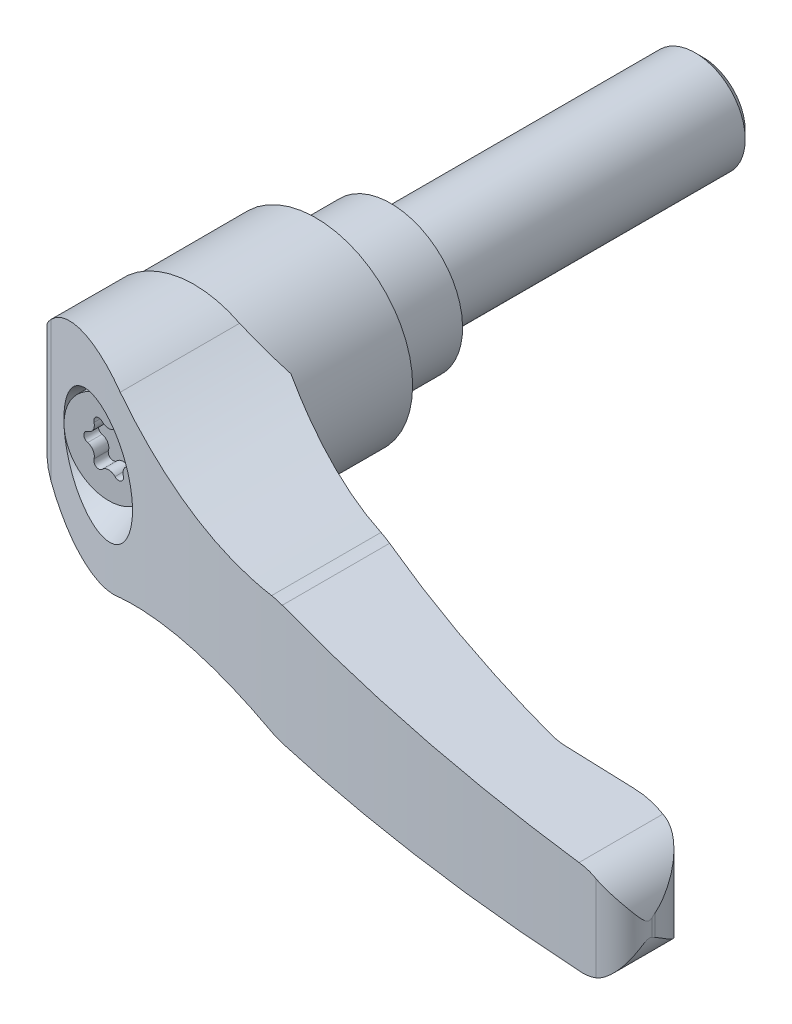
ISO-10303-21;
HEADER;
FILE_DESCRIPTION(('STEP AP214'),'2;1');
FILE_NAME('part.step','',(''),(''),'','','');
FILE_SCHEMA(('AUTOMOTIVE_DESIGN { 1 0 10303 214 1 1 1 1 }'));
ENDSEC;
DATA;
#1=APPLICATION_CONTEXT('core data for automotive mechanical design processes');
#2=APPLICATION_PROTOCOL_DEFINITION('international standard','automotive_design',2000,#1);
#3=PRODUCT_CONTEXT('',#1,'mechanical');
#4=PRODUCT('Part','Part','',(#3));
#5=PRODUCT_RELATED_PRODUCT_CATEGORY('part','',(#4));
#6=PRODUCT_DEFINITION_FORMATION('','',#4);
#7=PRODUCT_DEFINITION_CONTEXT('part definition',#1,'design');
#8=PRODUCT_DEFINITION('design','',#6,#7);
#9=PRODUCT_DEFINITION_SHAPE('','',#8);
#10=(LENGTH_UNIT() NAMED_UNIT(*) SI_UNIT(.MILLI.,.METRE.));
#11=(NAMED_UNIT(*) PLANE_ANGLE_UNIT() SI_UNIT($,.RADIAN.));
#12=(NAMED_UNIT(*) SI_UNIT($,.STERADIAN.) SOLID_ANGLE_UNIT());
#13=UNCERTAINTY_MEASURE_WITH_UNIT(LENGTH_MEASURE(1.E-05),#10,'distance_accuracy_value','');
#14=(GEOMETRIC_REPRESENTATION_CONTEXT(3) GLOBAL_UNCERTAINTY_ASSIGNED_CONTEXT((#13)) GLOBAL_UNIT_ASSIGNED_CONTEXT((#10,
#11,#12)) REPRESENTATION_CONTEXT('',''));
#15=CARTESIAN_POINT('',(0.,0.,0.));
#16=DIRECTION('',(0.,0.,1.));
#17=DIRECTION('',(1.,0.,0.));
#18=AXIS2_PLACEMENT_3D('',#15,#16,#17);
#19=CARTESIAN_POINT('',(-1.58999999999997,2.75396078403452,49.24));
#20=DIRECTION('',(0.,0.,-1.));
#21=DIRECTION('',(0.,1.,0.));
#22=AXIS2_PLACEMENT_3D('',#19,#20,#21);
#23=CYLINDRICAL_SURFACE('',#22,0.794999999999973);
#24=CARTESIAN_POINT('',(-1.58999999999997,2.75396078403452,42.87));
#25=DIRECTION('',(0.,0.,-1.));
#26=DIRECTION('',(0.,1.,0.));
#27=AXIS2_PLACEMENT_3D('',#24,#25,#26);
#28=CIRCLE('',#27,0.794999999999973);
#29=CARTESIAN_POINT('',(-1.0118181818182,3.2996079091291,42.87));
#30=VERTEX_POINT('',#29);
#31=CARTESIAN_POINT('',(-2.3516351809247,2.5260642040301,42.87));
#32=VERTEX_POINT('',#31);
#33=EDGE_CURVE('E643',#30,#32,#28,.F.);
#34=ORIENTED_EDGE('',*,*,#33,.F.);
#35=DIRECTION('',(0.,0.,-1.));
#36=VECTOR('',#35,1.);
#37=CARTESIAN_POINT('',(-1.0118181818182,3.2996079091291,49.24));
#38=LINE('',#37,#36);
#39=CARTESIAN_POINT('',(-1.0118181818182,3.2996079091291,45.19));
#40=VERTEX_POINT('',#39);
#41=EDGE_CURVE('E83',#40,#30,#38,.T.);
#42=ORIENTED_EDGE('',*,*,#41,.F.);
#43=CARTESIAN_POINT('',(-1.58999999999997,2.75396078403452,45.19));
#44=DIRECTION('',(0.,0.,1.));
#45=DIRECTION('',(0.,-1.,0.));
#46=AXIS2_PLACEMENT_3D('',#43,#44,#45);
#47=CIRCLE('',#46,0.794999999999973);
#48=CARTESIAN_POINT('',(-2.3516351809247,2.5260642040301,45.19));
#49=VERTEX_POINT('',#48);
#50=EDGE_CURVE('E646',#49,#40,#47,.F.);
#51=ORIENTED_EDGE('',*,*,#50,.F.);
#52=DIRECTION('',(0.,0.,-1.));
#53=VECTOR('',#52,1.);
#54=CARTESIAN_POINT('',(-2.3516351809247,2.5260642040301,49.24));
#55=LINE('',#54,#53);
#56=EDGE_CURVE('E585',#49,#32,#55,.T.);
#57=ORIENTED_EDGE('',*,*,#56,.T.);
#58=EDGE_LOOP('',(#34,#42,#51,#57));
#59=FACE_BOUND('',#58,.T.);
#60=ADVANCED_FACE('F14',(#59),#23,.F.);
#61=CARTESIAN_POINT('',(1.59,2.75396078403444,49.24));
#62=DIRECTION('',(0.,0.,-1.));
#63=DIRECTION('',(0.,1.,0.));
#64=AXIS2_PLACEMENT_3D('',#61,#62,#63);
#65=CYLINDRICAL_SURFACE('',#64,0.795000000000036);
#66=DIRECTION('',(0.,0.,-1.));
#67=VECTOR('',#66,1.);
#68=CARTESIAN_POINT('',(1.0118181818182,3.2996079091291,49.24));
#69=LINE('',#68,#67);
#70=CARTESIAN_POINT('',(1.0118181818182,3.2996079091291,45.19));
#71=VERTEX_POINT('',#70);
#72=CARTESIAN_POINT('',(1.01181818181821,3.29960790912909,42.87));
#73=VERTEX_POINT('',#72);
#74=EDGE_CURVE('E622',#71,#73,#69,.T.);
#75=ORIENTED_EDGE('',*,*,#74,.T.);
#76=CARTESIAN_POINT('',(1.59,2.75396078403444,42.87));
#77=DIRECTION('',(0.,0.,-1.));
#78=DIRECTION('',(0.,1.,0.));
#79=AXIS2_PLACEMENT_3D('',#76,#77,#78);
#80=CIRCLE('',#79,0.795000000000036);
#81=CARTESIAN_POINT('',(2.3516351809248,2.5260642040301,42.87));
#82=VERTEX_POINT('',#81);
#83=EDGE_CURVE('E649',#82,#73,#80,.F.);
#84=ORIENTED_EDGE('',*,*,#83,.F.);
#85=DIRECTION('',(0.,0.,-1.));
#86=VECTOR('',#85,1.);
#87=CARTESIAN_POINT('',(2.3516351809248,2.5260642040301,49.24));
#88=LINE('',#87,#86);
#89=CARTESIAN_POINT('',(2.3516351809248,2.5260642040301,45.19));
#90=VERTEX_POINT('',#89);
#91=EDGE_CURVE('E611',#90,#82,#88,.T.);
#92=ORIENTED_EDGE('',*,*,#91,.F.);
#93=CARTESIAN_POINT('',(1.59,2.75396078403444,45.19));
#94=DIRECTION('',(0.,0.,1.));
#95=DIRECTION('',(0.,-1.,0.));
#96=AXIS2_PLACEMENT_3D('',#93,#94,#95);
#97=CIRCLE('',#96,0.795000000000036);
#98=EDGE_CURVE('E651',#71,#90,#97,.F.);
#99=ORIENTED_EDGE('',*,*,#98,.F.);
#100=EDGE_LOOP('',(#75,#84,#92,#99));
#101=FACE_BOUND('',#100,.T.);
#102=ADVANCED_FACE('F496',(#101),#65,.F.);
#103=CARTESIAN_POINT('',(3.18,0.,49.24));
#104=DIRECTION('',(0.,0.,-1.));
#105=DIRECTION('',(0.,1.,0.));
#106=AXIS2_PLACEMENT_3D('',#103,#104,#105);
#107=CYLINDRICAL_SURFACE('',#106,0.795);
#108=DIRECTION('',(0.,0.,-1.));
#109=VECTOR('',#108,1.);
#110=CARTESIAN_POINT('',(3.3634533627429,0.77354370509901,49.24));
#111=LINE('',#110,#109);
#112=CARTESIAN_POINT('',(3.3634533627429,0.77354370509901,45.19));
#113=VERTEX_POINT('',#112);
#114=CARTESIAN_POINT('',(3.3634533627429,0.77354370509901,42.87));
#115=VERTEX_POINT('',#114);
#116=EDGE_CURVE('E607',#113,#115,#111,.T.);
#117=ORIENTED_EDGE('',*,*,#116,.T.);
#118=CARTESIAN_POINT('',(3.18,0.,42.87));
#119=DIRECTION('',(0.,0.,-1.));
#120=DIRECTION('',(0.,1.,0.));
#121=AXIS2_PLACEMENT_3D('',#118,#119,#120);
#122=CIRCLE('',#121,0.795);
#123=CARTESIAN_POINT('',(3.3634533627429,-0.773543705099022,42.87));
#124=VERTEX_POINT('',#123);
#125=EDGE_CURVE('E29',#124,#115,#122,.F.);
#126=ORIENTED_EDGE('',*,*,#125,.F.);
#127=DIRECTION('',(0.,0.,-1.));
#128=VECTOR('',#127,1.);
#129=CARTESIAN_POINT('',(3.3634533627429,-0.77354370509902,49.24));
#130=LINE('',#129,#128);
#131=CARTESIAN_POINT('',(3.3634533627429,-0.77354370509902,45.19));
#132=VERTEX_POINT('',#131);
#133=EDGE_CURVE('E617',#132,#124,#130,.T.);
#134=ORIENTED_EDGE('',*,*,#133,.F.);
#135=CARTESIAN_POINT('',(3.18,0.,45.19));
#136=DIRECTION('',(0.,0.,1.));
#137=DIRECTION('',(0.,-1.,0.));
#138=AXIS2_PLACEMENT_3D('',#135,#136,#137);
#139=CIRCLE('',#138,0.795);
#140=EDGE_CURVE('E616',#113,#132,#139,.F.);
#141=ORIENTED_EDGE('',*,*,#140,.F.);
#142=EDGE_LOOP('',(#117,#126,#134,#141));
#143=FACE_BOUND('',#142,.T.);
#144=ADVANCED_FACE('F501',(#143),#107,.F.);
#145=CARTESIAN_POINT('',(1.58999999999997,-2.75396078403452,49.24));
#146=DIRECTION('',(0.,0.,-1.));
#147=DIRECTION('',(0.,1.,0.));
#148=AXIS2_PLACEMENT_3D('',#145,#146,#147);
#149=CYLINDRICAL_SURFACE('',#148,0.794999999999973);
#150=DIRECTION('',(0.,0.,-1.));
#151=VECTOR('',#150,1.);
#152=CARTESIAN_POINT('',(2.3516351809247,-2.5260642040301,49.24));
#153=LINE('',#152,#151);
#154=CARTESIAN_POINT('',(2.3516351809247,-2.5260642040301,45.19));
#155=VERTEX_POINT('',#154);
#156=CARTESIAN_POINT('',(2.3516351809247,-2.5260642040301,42.87));
#157=VERTEX_POINT('',#156);
#158=EDGE_CURVE('E620',#155,#157,#153,.T.);
#159=ORIENTED_EDGE('',*,*,#158,.T.);
#160=CARTESIAN_POINT('',(1.58999999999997,-2.75396078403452,42.87));
#161=DIRECTION('',(0.,0.,-1.));
#162=DIRECTION('',(0.,1.,0.));
#163=AXIS2_PLACEMENT_3D('',#160,#161,#162);
#164=CIRCLE('',#163,0.794999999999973);
#165=CARTESIAN_POINT('',(1.0118181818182,-3.2996079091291,42.87));
#166=VERTEX_POINT('',#165);
#167=EDGE_CURVE('E656',#166,#157,#164,.F.);
#168=ORIENTED_EDGE('',*,*,#167,.F.);
#169=DIRECTION('',(0.,0.,-1.));
#170=VECTOR('',#169,1.);
#171=CARTESIAN_POINT('',(1.0118181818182,-3.2996079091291,49.24));
#172=LINE('',#171,#170);
#173=CARTESIAN_POINT('',(1.0118181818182,-3.2996079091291,45.19));
#174=VERTEX_POINT('',#173);
#175=EDGE_CURVE('E628',#174,#166,#172,.T.);
#176=ORIENTED_EDGE('',*,*,#175,.F.);
#177=CARTESIAN_POINT('',(1.58999999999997,-2.75396078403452,45.19));
#178=DIRECTION('',(0.,0.,1.));
#179=DIRECTION('',(0.,-1.,0.));
#180=AXIS2_PLACEMENT_3D('',#177,#178,#179);
#181=CIRCLE('',#180,0.794999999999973);
#182=EDGE_CURVE('E659',#155,#174,#181,.F.);
#183=ORIENTED_EDGE('',*,*,#182,.F.);
#184=EDGE_LOOP('',(#159,#168,#176,#183));
#185=FACE_BOUND('',#184,.T.);
#186=ADVANCED_FACE('F521',(#185),#149,.F.);
#187=CARTESIAN_POINT('',(-1.59,-2.75396078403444,49.24));
#188=DIRECTION('',(0.,0.,-1.));
#189=DIRECTION('',(0.,1.,0.));
#190=AXIS2_PLACEMENT_3D('',#187,#188,#189);
#191=CYLINDRICAL_SURFACE('',#190,0.795000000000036);
#192=DIRECTION('',(0.,0.,-1.));
#193=VECTOR('',#192,1.);
#194=CARTESIAN_POINT('',(-1.0118181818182,-3.2996079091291,49.24));
#195=LINE('',#194,#193);
#196=CARTESIAN_POINT('',(-1.0118181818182,-3.2996079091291,45.19));
#197=VERTEX_POINT('',#196);
#198=CARTESIAN_POINT('',(-1.01181818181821,-3.29960790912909,42.87));
#199=VERTEX_POINT('',#198);
#200=EDGE_CURVE('E631',#197,#199,#195,.T.);
#201=ORIENTED_EDGE('',*,*,#200,.T.);
#202=CARTESIAN_POINT('',(-1.59,-2.75396078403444,42.87));
#203=DIRECTION('',(0.,0.,-1.));
#204=DIRECTION('',(0.,1.,0.));
#205=AXIS2_PLACEMENT_3D('',#202,#203,#204);
#206=CIRCLE('',#205,0.795000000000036);
#207=CARTESIAN_POINT('',(-2.3516351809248,-2.5260642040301,42.87));
#208=VERTEX_POINT('',#207);
#209=EDGE_CURVE('E662',#208,#199,#206,.F.);
#210=ORIENTED_EDGE('',*,*,#209,.F.);
#211=DIRECTION('',(0.,0.,-1.));
#212=VECTOR('',#211,1.);
#213=CARTESIAN_POINT('',(-2.3516351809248,-2.5260642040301,49.24));
#214=LINE('',#213,#212);
#215=CARTESIAN_POINT('',(-2.3516351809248,-2.5260642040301,45.19));
#216=VERTEX_POINT('',#215);
#217=EDGE_CURVE('E634',#216,#208,#214,.T.);
#218=ORIENTED_EDGE('',*,*,#217,.F.);
#219=CARTESIAN_POINT('',(-1.59,-2.75396078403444,45.19));
#220=DIRECTION('',(0.,0.,1.));
#221=DIRECTION('',(0.,-1.,0.));
#222=AXIS2_PLACEMENT_3D('',#219,#220,#221);
#223=CIRCLE('',#222,0.795000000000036);
#224=EDGE_CURVE('E665',#197,#216,#223,.F.);
#225=ORIENTED_EDGE('',*,*,#224,.F.);
#226=EDGE_LOOP('',(#201,#210,#218,#225));
#227=FACE_BOUND('',#226,.T.);
#228=ADVANCED_FACE('F529',(#227),#191,.F.);
#229=CARTESIAN_POINT('',(-3.18,0.,49.24));
#230=DIRECTION('',(0.,0.,-1.));
#231=DIRECTION('',(0.,1.,0.));
#232=AXIS2_PLACEMENT_3D('',#229,#230,#231);
#233=CYLINDRICAL_SURFACE('',#232,0.795);
#234=CARTESIAN_POINT('',(-3.18,0.,42.87));
#235=DIRECTION('',(0.,0.,-1.));
#236=DIRECTION('',(0.,1.,0.));
#237=AXIS2_PLACEMENT_3D('',#234,#235,#236);
#238=CIRCLE('',#237,0.795);
#239=CARTESIAN_POINT('',(-3.3634533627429,0.773543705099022,42.87));
#240=VERTEX_POINT('',#239);
#241=CARTESIAN_POINT('',(-3.3634533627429,-0.773543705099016,42.87));
#242=VERTEX_POINT('',#241);
#243=EDGE_CURVE('E668',#240,#242,#238,.F.);
#244=ORIENTED_EDGE('',*,*,#243,.F.);
#245=DIRECTION('',(0.,0.,-1.));
#246=VECTOR('',#245,1.);
#247=CARTESIAN_POINT('',(-3.3634533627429,0.77354370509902,49.24));
#248=LINE('',#247,#246);
#249=CARTESIAN_POINT('',(-3.3634533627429,0.77354370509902,45.19));
#250=VERTEX_POINT('',#249);
#251=EDGE_CURVE('E640',#250,#240,#248,.T.);
#252=ORIENTED_EDGE('',*,*,#251,.F.);
#253=CARTESIAN_POINT('',(-3.18,0.,45.19));
#254=DIRECTION('',(0.,0.,1.));
#255=DIRECTION('',(0.,-1.,0.));
#256=AXIS2_PLACEMENT_3D('',#253,#254,#255);
#257=CIRCLE('',#256,0.795);
#258=CARTESIAN_POINT('',(-3.3634533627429,-0.77354370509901,45.19));
#259=VERTEX_POINT('',#258);
#260=EDGE_CURVE('E671',#259,#250,#257,.F.);
#261=ORIENTED_EDGE('',*,*,#260,.F.);
#262=DIRECTION('',(0.,0.,-1.));
#263=VECTOR('',#262,1.);
#264=CARTESIAN_POINT('',(-3.3634533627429,-0.77354370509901,49.24));
#265=LINE('',#264,#263);
#266=EDGE_CURVE('E637',#259,#242,#265,.T.);
#267=ORIENTED_EDGE('',*,*,#266,.T.);
#268=EDGE_LOOP('',(#244,#252,#261,#267));
#269=FACE_BOUND('',#268,.T.);
#270=ADVANCED_FACE('F536',(#269),#233,.F.);
#271=CARTESIAN_POINT('',(-3.68449674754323,2.12724518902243,49.24));
#272=DIRECTION('',(0.,0.,-1.));
#273=DIRECTION('',(0.,1.,0.));
#274=AXIS2_PLACEMENT_3D('',#271,#272,#273);
#275=CYLINDRICAL_SURFACE('',#274,1.39125000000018);
#276=ORIENTED_EDGE('',*,*,#251,.T.);
#277=CARTESIAN_POINT('',(-3.68449674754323,2.12724518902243,42.87));
#278=DIRECTION('',(0.,0.,-1.));
#279=DIRECTION('',(-1.,0.,0.));
#280=AXIS2_PLACEMENT_3D('',#277,#278,#279);
#281=CIRCLE('',#280,1.39125000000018);
#282=EDGE_CURVE('E713',#240,#32,#281,.F.);
#283=ORIENTED_EDGE('',*,*,#282,.T.);
#284=ORIENTED_EDGE('',*,*,#56,.F.);
#285=CARTESIAN_POINT('',(-3.68449674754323,2.12724518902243,45.19));
#286=DIRECTION('',(0.,0.,1.));
#287=DIRECTION('',(0.,-1.,0.));
#288=AXIS2_PLACEMENT_3D('',#285,#286,#287);
#289=CIRCLE('',#288,1.39125000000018);
#290=EDGE_CURVE('E602',#250,#49,#289,.T.);
#291=ORIENTED_EDGE('',*,*,#290,.F.);
#292=EDGE_LOOP('',(#276,#283,#284,#291));
#293=FACE_BOUND('',#292,.T.);
#294=ADVANCED_FACE('F509',(#293),#275,.T.);
#295=CARTESIAN_POINT('',(0.,4.25449037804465,49.24));
#296=DIRECTION('',(0.,0.,-1.));
#297=DIRECTION('',(0.,1.,0.));
#298=AXIS2_PLACEMENT_3D('',#295,#296,#297);
#299=CYLINDRICAL_SURFACE('',#298,1.39125000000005);
#300=ORIENTED_EDGE('',*,*,#41,.T.);
#301=CARTESIAN_POINT('',(0.,4.25449037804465,42.87));
#302=DIRECTION('',(0.,0.,-1.));
#303=DIRECTION('',(-1.,0.,0.));
#304=AXIS2_PLACEMENT_3D('',#301,#302,#303);
#305=CIRCLE('',#304,1.39125000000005);
#306=EDGE_CURVE('E725',#30,#73,#305,.F.);
#307=ORIENTED_EDGE('',*,*,#306,.T.);
#308=ORIENTED_EDGE('',*,*,#74,.F.);
#309=CARTESIAN_POINT('',(0.,4.25449037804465,45.19));
#310=DIRECTION('',(0.,0.,1.));
#311=DIRECTION('',(0.,-1.,0.));
#312=AXIS2_PLACEMENT_3D('',#309,#310,#311);
#313=CIRCLE('',#312,1.39125000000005);
#314=EDGE_CURVE('E692',#40,#71,#313,.T.);
#315=ORIENTED_EDGE('',*,*,#314,.F.);
#316=EDGE_LOOP('',(#300,#307,#308,#315));
#317=FACE_BOUND('',#316,.T.);
#318=ADVANCED_FACE('F506',(#317),#299,.T.);
#319=CARTESIAN_POINT('',(-3.68449674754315,-2.12724518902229,49.24));
#320=DIRECTION('',(0.,0.,-1.));
#321=DIRECTION('',(0.,1.,0.));
#322=AXIS2_PLACEMENT_3D('',#319,#320,#321);
#323=CYLINDRICAL_SURFACE('',#322,1.39125000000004);
#324=ORIENTED_EDGE('',*,*,#217,.T.);
#325=CARTESIAN_POINT('',(-3.68449674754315,-2.12724518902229,42.87));
#326=DIRECTION('',(0.,0.,-1.));
#327=DIRECTION('',(-1.,0.,0.));
#328=AXIS2_PLACEMENT_3D('',#325,#326,#327);
#329=CIRCLE('',#328,1.39125000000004);
#330=EDGE_CURVE('E722',#208,#242,#329,.F.);
#331=ORIENTED_EDGE('',*,*,#330,.T.);
#332=ORIENTED_EDGE('',*,*,#266,.F.);
#333=CARTESIAN_POINT('',(-3.68449674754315,-2.12724518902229,45.19));
#334=DIRECTION('',(0.,0.,1.));
#335=DIRECTION('',(0.,-1.,0.));
#336=AXIS2_PLACEMENT_3D('',#333,#334,#335);
#337=CIRCLE('',#336,1.39125000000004);
#338=EDGE_CURVE('E702',#216,#259,#337,.T.);
#339=ORIENTED_EDGE('',*,*,#338,.F.);
#340=EDGE_LOOP('',(#324,#331,#332,#339));
#341=FACE_BOUND('',#340,.T.);
#342=ADVANCED_FACE('F508',(#341),#323,.T.);
#343=CARTESIAN_POINT('',(0.,-4.25449037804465,49.24));
#344=DIRECTION('',(0.,0.,-1.));
#345=DIRECTION('',(0.,1.,0.));
#346=AXIS2_PLACEMENT_3D('',#343,#344,#345);
#347=CYLINDRICAL_SURFACE('',#346,1.39125000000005);
#348=ORIENTED_EDGE('',*,*,#175,.T.);
#349=CARTESIAN_POINT('',(0.,-4.25449037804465,42.87));
#350=DIRECTION('',(0.,0.,-1.));
#351=DIRECTION('',(-1.,0.,0.));
#352=AXIS2_PLACEMENT_3D('',#349,#350,#351);
#353=CIRCLE('',#352,1.39125000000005);
#354=EDGE_CURVE('E719',#166,#199,#353,.F.);
#355=ORIENTED_EDGE('',*,*,#354,.T.);
#356=ORIENTED_EDGE('',*,*,#200,.F.);
#357=CARTESIAN_POINT('',(0.,-4.25449037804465,45.19));
#358=DIRECTION('',(0.,0.,1.));
#359=DIRECTION('',(0.,-1.,0.));
#360=AXIS2_PLACEMENT_3D('',#357,#358,#359);
#361=CIRCLE('',#360,1.39125000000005);
#362=EDGE_CURVE('E700',#174,#197,#361,.T.);
#363=ORIENTED_EDGE('',*,*,#362,.F.);
#364=EDGE_LOOP('',(#348,#355,#356,#363));
#365=FACE_BOUND('',#364,.T.);
#366=ADVANCED_FACE('F525',(#365),#347,.T.);
#367=CARTESIAN_POINT('',(3.68449674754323,-2.12724518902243,49.24));
#368=DIRECTION('',(0.,0.,-1.));
#369=DIRECTION('',(0.,1.,0.));
#370=AXIS2_PLACEMENT_3D('',#367,#368,#369);
#371=CYLINDRICAL_SURFACE('',#370,1.39125000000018);
#372=ORIENTED_EDGE('',*,*,#133,.T.);
#373=CARTESIAN_POINT('',(3.68449674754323,-2.12724518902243,42.87));
#374=DIRECTION('',(0.,0.,-1.));
#375=DIRECTION('',(-1.,0.,0.));
#376=AXIS2_PLACEMENT_3D('',#373,#374,#375);
#377=CIRCLE('',#376,1.39125000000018);
#378=EDGE_CURVE('E716',#124,#157,#377,.F.);
#379=ORIENTED_EDGE('',*,*,#378,.T.);
#380=ORIENTED_EDGE('',*,*,#158,.F.);
#381=CARTESIAN_POINT('',(3.68449674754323,-2.12724518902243,45.19));
#382=DIRECTION('',(0.,0.,1.));
#383=DIRECTION('',(0.,-1.,0.));
#384=AXIS2_PLACEMENT_3D('',#381,#382,#383);
#385=CIRCLE('',#384,1.39125000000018);
#386=EDGE_CURVE('E697',#132,#155,#385,.T.);
#387=ORIENTED_EDGE('',*,*,#386,.F.);
#388=EDGE_LOOP('',(#372,#379,#380,#387));
#389=FACE_BOUND('',#388,.T.);
#390=ADVANCED_FACE('F516',(#389),#371,.T.);
#391=CARTESIAN_POINT('',(3.68449674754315,2.12724518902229,49.24));
#392=DIRECTION('',(0.,0.,-1.));
#393=DIRECTION('',(0.,1.,0.));
#394=AXIS2_PLACEMENT_3D('',#391,#392,#393);
#395=CYLINDRICAL_SURFACE('',#394,1.39125000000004);
#396=ORIENTED_EDGE('',*,*,#91,.T.);
#397=CARTESIAN_POINT('',(3.68449674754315,2.12724518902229,42.87));
#398=DIRECTION('',(0.,0.,-1.));
#399=DIRECTION('',(-1.,0.,0.));
#400=AXIS2_PLACEMENT_3D('',#397,#398,#399);
#401=CIRCLE('',#400,1.39125000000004);
#402=EDGE_CURVE('E22',#82,#115,#401,.F.);
#403=ORIENTED_EDGE('',*,*,#402,.T.);
#404=ORIENTED_EDGE('',*,*,#116,.F.);
#405=CARTESIAN_POINT('',(3.68449674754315,2.12724518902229,45.19));
#406=DIRECTION('',(0.,0.,1.));
#407=DIRECTION('',(0.,-1.,0.));
#408=AXIS2_PLACEMENT_3D('',#405,#406,#407);
#409=CIRCLE('',#408,1.39125000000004);
#410=EDGE_CURVE('E695',#90,#113,#409,.T.);
#411=ORIENTED_EDGE('',*,*,#410,.F.);
#412=EDGE_LOOP('',(#396,#403,#404,#411));
#413=FACE_BOUND('',#412,.T.);
#414=ADVANCED_FACE('F512',(#413),#395,.T.);
#415=CARTESIAN_POINT('',(0.0100000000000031,0.,12.75));
#416=DIRECTION('',(0.,0.,-1.));
#417=DIRECTION('',(0.,1.,0.));
#418=AXIS2_PLACEMENT_3D('',#415,#416,#417);
#419=CONICAL_SURFACE('',#418,11.5,0.78539816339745);
#420=CARTESIAN_POINT('',(0.0100000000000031,0.,12.4));
#421=DIRECTION('',(0.,0.,1.));
#422=DIRECTION('',(0.,-1.,0.));
#423=AXIS2_PLACEMENT_3D('',#420,#421,#422);
#424=CIRCLE('',#423,11.85);
#425=CARTESIAN_POINT('',(0.0100000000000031,-11.85,12.4));
#426=VERTEX_POINT('',#425);
#427=EDGE_CURVE('E706',#426,#426,#424,.T.);
#428=ORIENTED_EDGE('',*,*,#427,.F.);
#429=EDGE_LOOP('',(#428));
#430=FACE_BOUND('',#429,.T.);
#431=CARTESIAN_POINT('',(0.0100000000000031,0.,12.75));
#432=DIRECTION('',(0.,0.,1.));
#433=DIRECTION('',(0.,-1.,0.));
#434=AXIS2_PLACEMENT_3D('',#431,#432,#433);
#435=CIRCLE('',#434,11.5);
#436=CARTESIAN_POINT('',(0.00500000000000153,-11.4999989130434,12.75));
#437=VERTEX_POINT('',#436);
#438=CARTESIAN_POINT('',(0.00500000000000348,11.4999989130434,12.75));
#439=VERTEX_POINT('',#438);
#440=EDGE_CURVE('E235',#437,#439,#435,.T.);
#441=ORIENTED_EDGE('',*,*,#440,.T.);
#442=CARTESIAN_POINT('',(11.057512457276,3.15933826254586,12.7596148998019));
#443=CARTESIAN_POINT('',(10.9793452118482,3.43293898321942,12.7595468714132));
#444=CARTESIAN_POINT('',(10.89103258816,3.7035655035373,12.7594700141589));
#445=CARTESIAN_POINT('',(10.6945696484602,4.23757900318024,12.7592990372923));
#446=CARTESIAN_POINT('',(10.5864181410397,4.50096554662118,12.7592049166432));
#447=CARTESIAN_POINT('',(10.3508010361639,5.01916329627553,12.7589998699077));
#448=CARTESIAN_POINT('',(10.223322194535,5.27396847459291,12.7588889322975));
#449=CARTESIAN_POINT('',(9.94980531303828,5.77342608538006,12.7586509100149));
#450=CARTESIAN_POINT('',(9.80376629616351,6.01807798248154,12.7585238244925));
#451=CARTESIAN_POINT('',(9.47296532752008,6.52820018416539,12.7582359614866));
#452=CARTESIAN_POINT('',(9.28563751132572,6.79201176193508,12.7580729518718));
#453=CARTESIAN_POINT('',(8.88941417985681,7.30293399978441,12.7577281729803));
#454=CARTESIAN_POINT('',(8.68051666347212,7.55004310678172,12.757546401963));
#455=CARTESIAN_POINT('',(8.24260543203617,8.02583370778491,12.7571653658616));
#456=CARTESIAN_POINT('',(8.01358791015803,8.25451169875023,12.7569660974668));
#457=CARTESIAN_POINT('',(7.53710483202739,8.69175500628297,12.7565515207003));
#458=CARTESIAN_POINT('',(7.28963958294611,8.90032065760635,12.7563362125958));
#459=CARTESIAN_POINT('',(6.77803795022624,9.29584511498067,12.7558911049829));
#460=CARTESIAN_POINT('',(6.51390293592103,9.48280569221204,12.755661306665));
#461=CARTESIAN_POINT('',(5.9708200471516,9.83381130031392,12.7551888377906));
#462=CARTESIAN_POINT('',(5.69187209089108,9.99785620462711,12.7549461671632));
#463=CARTESIAN_POINT('',(5.12116330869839,10.3018547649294,12.7544496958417));
#464=CARTESIAN_POINT('',(4.82940317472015,10.4418097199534,12.7541958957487));
#465=CARTESIAN_POINT('',(4.23513054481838,10.6966440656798,12.7536789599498));
#466=CARTESIAN_POINT('',(3.932618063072,10.8115234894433,12.7534158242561));
#467=CARTESIAN_POINT('',(3.31898423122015,11.0153925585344,12.7528820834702));
#468=CARTESIAN_POINT('',(3.00786269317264,11.1043816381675,12.7526114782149));
#469=CARTESIAN_POINT('',(2.37922884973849,11.2558340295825,12.7520647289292));
#470=CARTESIAN_POINT('',(2.06171654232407,11.3182973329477,12.7517885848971));
#471=CARTESIAN_POINT('',(1.42255543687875,11.4162545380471,12.7512327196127));
#472=CARTESIAN_POINT('',(1.10090659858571,11.4517481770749,12.7509529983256));
#473=CARTESIAN_POINT('',(0.455762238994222,11.4955127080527,12.7503919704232));
#474=CARTESIAN_POINT('',(0.132266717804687,11.5037836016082,12.7501106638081));
#475=CARTESIAN_POINT('',(-0.514269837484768,11.4930438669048,12.7495484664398));
#476=CARTESIAN_POINT('',(-0.83731087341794,11.4740333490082,12.749267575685));
#477=CARTESIAN_POINT('',(-1.48064314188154,11.4088661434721,12.7487082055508));
#478=CARTESIAN_POINT('',(-1.80093437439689,11.3627094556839,12.7484297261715));
#479=CARTESIAN_POINT('',(-2.43648954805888,11.2435781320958,12.7478771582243));
#480=CARTESIAN_POINT('',(-2.75175349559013,11.1706035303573,12.747603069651));
#481=CARTESIAN_POINT('',(-3.375013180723,10.9983551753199,12.7470612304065));
#482=CARTESIAN_POINT('',(-3.68300891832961,10.8990814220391,12.7467934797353));
#483=CARTESIAN_POINT('',(-4.28954272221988,10.6749404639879,12.746266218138));
#484=CARTESIAN_POINT('',(-4.58808078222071,10.550073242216,12.7460067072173));
#485=CARTESIAN_POINT('',(-5.17357658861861,10.2756331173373,12.7454977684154));
#486=CARTESIAN_POINT('',(-5.46053433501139,10.1260602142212,12.7452483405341));
#487=CARTESIAN_POINT('',(-6.02082939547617,9.80327210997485,12.744761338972));
#488=CARTESIAN_POINT('',(-6.29416671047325,9.63005691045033,12.7445237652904));
#489=CARTESIAN_POINT('',(-6.82527766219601,9.26121566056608,12.744062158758));
#490=CARTESIAN_POINT('',(-7.08305129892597,9.06558961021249,12.7438381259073));
#491=CARTESIAN_POINT('',(-7.58120221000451,8.65331749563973,12.7434051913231));
#492=CARTESIAN_POINT('',(-7.8215794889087,8.43667143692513,12.7431962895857));
#493=CARTESIAN_POINT('',(-8.28322881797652,7.98389948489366,12.7427950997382));
#494=CARTESIAN_POINT('',(-8.50450086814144,7.74777359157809,12.7426028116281));
#495=CARTESIAN_POINT('',(-8.92636665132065,7.2577206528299,12.7422362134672));
#496=CARTESIAN_POINT('',(-9.12696038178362,7.00379360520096,12.7420619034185));
#497=CARTESIAN_POINT('',(-9.50604338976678,6.4799436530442,12.7417324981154));
#498=CARTESIAN_POINT('',(-9.6845326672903,6.2100207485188,12.7415774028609));
#499=CARTESIAN_POINT('',(-10.0181377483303,5.6560981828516,12.7412875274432));
#500=CARTESIAN_POINT('',(-10.1732535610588,5.37209852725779,12.7411527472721));
#501=CARTESIAN_POINT('',(-10.4590090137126,4.79204142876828,12.7409044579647));
#502=CARTESIAN_POINT('',(-10.5896486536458,4.49598398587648,12.7407909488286));
#503=CARTESIAN_POINT('',(-10.8255229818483,3.8939161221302,12.7405860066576));
#504=CARTESIAN_POINT('',(-10.9307576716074,3.58790570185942,12.7404945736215));
#505=CARTESIAN_POINT('',(-11.1150739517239,2.96810741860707,12.7403344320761));
#506=CARTESIAN_POINT('',(-11.1941555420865,2.65431955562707,12.7402657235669));
#507=CARTESIAN_POINT('',(-11.3256033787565,2.02119732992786,12.740151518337));
#508=CARTESIAN_POINT('',(-11.3779696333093,1.70186296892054,12.740106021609));
#509=CARTESIAN_POINT('',(-11.4556145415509,1.05991792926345,12.7400385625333));
#510=CARTESIAN_POINT('',(-11.4808931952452,0.737307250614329,12.7400166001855));
#511=CARTESIAN_POINT('',(-11.5041831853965,0.0911031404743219,12.7399963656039));
#512=CARTESIAN_POINT('',(-11.5021945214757,-0.232490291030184,12.7399980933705));
#513=CARTESIAN_POINT('',(-11.4709640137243,-0.87835934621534,12.7400252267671));
#514=CARTESIAN_POINT('',(-11.4417221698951,-1.20063496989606,12.7400506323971));
#515=CARTESIAN_POINT('',(-11.3561932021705,-1.84157716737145,12.7401249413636));
#516=CARTESIAN_POINT('',(-11.2999060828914,-2.16024374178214,12.740173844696));
#517=CARTESIAN_POINT('',(-11.1606867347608,-2.79170236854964,12.7402948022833));
#518=CARTESIAN_POINT('',(-11.0777545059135,-3.10449442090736,12.7403668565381));
#519=CARTESIAN_POINT('',(-10.8858345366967,-3.72198024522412,12.7405336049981));
#520=CARTESIAN_POINT('',(-10.7768467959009,-4.02667401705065,12.7406282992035));
#521=CARTESIAN_POINT('',(-10.5335906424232,-4.62579708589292,12.7408396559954));
#522=CARTESIAN_POINT('',(-10.399322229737,-4.92022638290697,12.7409563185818));
#523=CARTESIAN_POINT('',(-10.1064592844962,-5.49672732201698,12.7412107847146));
#524=CARTESIAN_POINT('',(-9.94786474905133,-5.7787989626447,12.7413485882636));
#525=CARTESIAN_POINT('',(-9.60747708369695,-6.32857919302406,12.741644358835));
#526=CARTESIAN_POINT('',(-9.42568395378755,-6.59628778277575,12.7418023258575));
#527=CARTESIAN_POINT('',(-9.04019155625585,-7.11543864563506,12.7421373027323));
#528=CARTESIAN_POINT('',(-8.83649229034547,-7.36688092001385,12.7423143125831));
#529=CARTESIAN_POINT('',(-8.40863578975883,-7.85171157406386,12.7426861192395));
#530=CARTESIAN_POINT('',(-8.18447855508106,-8.08509995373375,12.742880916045));
#531=CARTESIAN_POINT('',(-7.71729969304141,-8.53216361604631,12.7432869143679));
#532=CARTESIAN_POINT('',(-7.47427806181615,-8.74583889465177,12.7434981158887));
#533=CARTESIAN_POINT('',(-6.97109818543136,-9.15195720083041,12.7439354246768));
#534=CARTESIAN_POINT('',(-6.71093994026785,-9.34440022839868,12.7441615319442));
#535=CARTESIAN_POINT('',(-6.17533633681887,-9.70668592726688,12.7446270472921));
#536=CARTESIAN_POINT('',(-5.89989097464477,-9.87652859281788,12.7448664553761));
#537=CARTESIAN_POINT('',(-5.33567144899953,-10.1924060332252,12.7453568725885));
#538=CARTESIAN_POINT('',(-5.04689728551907,-10.3384408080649,12.7456078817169));
#539=CARTESIAN_POINT('',(-4.45807299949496,-10.6056643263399,12.7461197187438));
#540=CARTESIAN_POINT('',(-4.1580228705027,-10.7268530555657,12.7463805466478));
#541=CARTESIAN_POINT('',(-3.54877998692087,-10.9435227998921,12.746910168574));
#542=CARTESIAN_POINT('',(-3.23958723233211,-11.039003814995,12.7471789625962));
#543=CARTESIAN_POINT('',(-2.61425747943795,-11.2035792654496,12.7477226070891));
#544=CARTESIAN_POINT('',(-2.29812048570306,-11.2726737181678,12.7479974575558));
#545=CARTESIAN_POINT('',(-1.66114959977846,-11.3839849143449,12.7485512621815));
#546=CARTESIAN_POINT('',(-1.34031570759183,-11.4262016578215,12.7488302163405));
#547=CARTESIAN_POINT('',(-0.696231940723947,-11.4834573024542,12.7493902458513));
#548=CARTESIAN_POINT('',(-0.372982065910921,-11.498496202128,12.7496713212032));
#549=CARTESIAN_POINT('',(0.273635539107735,-11.5012892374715,12.750233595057));
#550=CARTESIAN_POINT('',(0.597003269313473,-11.4890433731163,12.7505147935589));
#551=CARTESIAN_POINT('',(1.24155799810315,-11.437353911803,12.7510753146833));
#552=CARTESIAN_POINT('',(1.56274499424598,-11.3979102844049,12.7513546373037));
#553=CARTESIAN_POINT('',(2.20065443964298,-11.2921056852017,12.7519094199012));
#554=CARTESIAN_POINT('',(2.51737688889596,-11.2257447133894,12.7521848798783));
#555=CARTESIAN_POINT('',(3.14410517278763,-11.066577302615,12.7527299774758));
#556=CARTESIAN_POINT('',(3.45411101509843,-10.9737708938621,12.7529996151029));
#557=CARTESIAN_POINT('',(4.06520250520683,-10.7623723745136,12.7535311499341));
#558=CARTESIAN_POINT('',(4.3662881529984,-10.6437802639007,12.7537930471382));
#559=CARTESIAN_POINT('',(4.95739910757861,-10.3816532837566,12.754307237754));
#560=CARTESIAN_POINT('',(5.24742439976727,-10.2381183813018,12.7545595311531));
#561=CARTESIAN_POINT('',(5.81435230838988,-9.92712637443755,12.7550527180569));
#562=CARTESIAN_POINT('',(6.09125492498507,-9.75966927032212,12.7552936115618));
#563=CARTESIAN_POINT('',(6.62997198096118,-9.40202131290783,12.7557622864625));
#564=CARTESIAN_POINT('',(6.89178624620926,-9.2118301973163,12.7559900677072));
#565=CARTESIAN_POINT('',(7.39846178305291,-8.81006790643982,12.7564308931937));
#566=CARTESIAN_POINT('',(7.64332305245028,-8.59849672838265,12.7566439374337));
#567=CARTESIAN_POINT('',(8.11434590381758,-8.15548396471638,12.7570537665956));
#568=CARTESIAN_POINT('',(8.34050794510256,-7.92404286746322,12.7572505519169));
#569=CARTESIAN_POINT('',(8.77253106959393,-7.44293132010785,12.7576264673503));
#570=CARTESIAN_POINT('',(8.9783921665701,-7.19326088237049,12.7578055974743));
#571=CARTESIAN_POINT('',(9.36833693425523,-6.67748283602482,12.7581449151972));
#572=CARTESIAN_POINT('',(9.55242206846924,-6.41137633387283,12.758305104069));
#573=CARTESIAN_POINT('',(9.89752289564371,-5.86460187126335,12.7586054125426));
#574=CARTESIAN_POINT('',(10.0585385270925,-5.58393387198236,12.7587455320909));
#575=CARTESIAN_POINT('',(10.3563791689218,-5.00998586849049,12.7590047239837));
#576=CARTESIAN_POINT('',(10.4932002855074,-4.71670384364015,12.7591237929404));
#577=CARTESIAN_POINT('',(10.7416459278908,-4.11965888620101,12.7593400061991));
#578=CARTESIAN_POINT('',(10.8532707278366,-3.8158960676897,12.7594371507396));
#579=CARTESIAN_POINT('',(11.0505616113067,-3.1999523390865,12.7596088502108));
#580=CARTESIAN_POINT('',(11.1362198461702,-2.88776891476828,12.7596833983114));
#581=CARTESIAN_POINT('',(11.2809236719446,-2.25729439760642,12.7598093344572));
#582=CARTESIAN_POINT('',(11.3399690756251,-1.93900326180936,12.7598607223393));
#583=CARTESIAN_POINT('',(11.4309937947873,-1.2987814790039,12.7599399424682));
#584=CARTESIAN_POINT('',(11.4629912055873,-0.976853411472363,12.7599677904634));
#585=CARTESIAN_POINT('',(11.4997633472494,-0.331543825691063,12.7599997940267));
#586=CARTESIAN_POINT('',(11.5045430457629,-0.00816258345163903,12.7600039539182));
#587=CARTESIAN_POINT('',(11.4825110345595,0.795622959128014,12.7599847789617));
#588=CARTESIAN_POINT('',(11.4391488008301,1.27566218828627,12.7599470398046));
#589=CARTESIAN_POINT('',(11.2926682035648,2.22640801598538,12.7598195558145));
#590=CARTESIAN_POINT('',(11.1895681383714,2.69711742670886,12.7597298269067));
#591=CARTESIAN_POINT('',(11.057512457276,3.15933826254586,12.7596148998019));
#592=B_SPLINE_CURVE_WITH_KNOTS('',3,(#442,#443,#444,#445,#446,#447,#448,#449,#450,#451,#452,
#453,#454,#455,#456,#457,#458,#459,#460,#461,#462,#463,#464,#465,#466,#467,#468,#469,#470,#471,
#472,#473,#474,#475,#476,#477,#478,#479,#480,#481,#482,#483,#484,#485,#486,#487,#488,#489,#490,
#491,#492,#493,#494,#495,#496,#497,#498,#499,#500,#501,#502,#503,#504,#505,#506,#507,#508,#509,
#510,#511,#512,#513,#514,#515,#516,#517,#518,#519,#520,#521,#522,#523,#524,#525,#526,#527,#528,
#529,#530,#531,#532,#533,#534,#535,#536,#537,#538,#539,#540,#541,#542,#543,#544,#545,#546,#547,
#548,#549,#550,#551,#552,#553,#554,#555,#556,#557,#558,#559,#560,#561,#562,#563,#564,#565,#566,
#567,#568,#569,#570,#571,#572,#573,#574,#575,#576,#577,#578,#579,#580,#581,#582,#583,#584,#585,
#586,#587,#588,#589,#590,#591),.UNSPECIFIED.,.T.,.F.,(4,2,2,2,2,2,2,2,2,2,2,2,2,2,2,2,2,2,2,2,2,
2,2,2,2,2,2,2,2,2,2,2,2,2,2,2,2,2,2,2,2,2,2,2,2,2,2,2,2,2,2,2,2,2,2,2,2,2,2,2,2,2,2,2,2,2,2,2,2,
2,2,2,2,2,4),(0.,0.853321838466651,1.70669493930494,2.56065548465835,3.41466100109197,
4.38415393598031,5.35373689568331,6.32350370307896,7.29325436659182,8.26292547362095,
9.23260193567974,10.202226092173,11.1718489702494,12.1414930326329,13.1111374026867,
14.0807912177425,15.0504449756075,16.0200948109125,16.989744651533,17.9593932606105,
18.9290418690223,19.8986911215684,20.8683403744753,21.8379895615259,22.8076387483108,
23.7772876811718,24.7469366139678,25.7165856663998,26.6862347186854,27.6558833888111,
28.6255320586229,29.5951806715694,30.5648292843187,31.5344775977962,32.504125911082,
33.4737742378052,34.4434225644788,35.4130707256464,36.3827188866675,37.3523670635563,
38.3220152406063,39.2916635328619,40.261311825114,41.2309600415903,42.200608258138,
43.1702566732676,44.1399050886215,45.1095537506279,46.0792024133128,47.0488516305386,
48.0185008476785,48.9881494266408,49.9577980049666,50.9274466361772,51.8970952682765,
52.8667449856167,53.8363947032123,54.8060433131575,55.7756919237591,56.7453418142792,
57.7149916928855,58.6846527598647,59.6543139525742,60.6239513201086,61.5935880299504,
62.5631595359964,63.5327336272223,64.5024636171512,65.4721830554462,66.4421953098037,
67.4122143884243,68.3815840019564,69.3507766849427,70.7928193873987,72.2344206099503),.UNSPECIFIED.);
#593=EDGE_CURVE('E571',#439,#437,#592,.T.);
#594=ORIENTED_EDGE('',*,*,#593,.T.);
#595=EDGE_LOOP('',(#441,#594));
#596=FACE_BOUND('',#595,.T.);
#597=ADVANCED_FACE('F515',(#430,#596),#419,.F.);
#598=CARTESIAN_POINT('',(0.0100000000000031,0.,12.));
#599=DIRECTION('',(0.,0.,1.));
#600=DIRECTION('',(0.,-1.,0.));
#601=AXIS2_PLACEMENT_3D('',#598,#599,#600);
#602=CYLINDRICAL_SURFACE('',#601,11.85);
#603=CARTESIAN_POINT('',(0.0100000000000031,0.,12.));
#604=DIRECTION('',(0.,0.,-1.));
#605=DIRECTION('',(1.,0.,0.));
#606=AXIS2_PLACEMENT_3D('',#603,#604,#605);
#607=CIRCLE('',#606,11.85);
#608=CARTESIAN_POINT('',(11.86,0.,12.));
#609=VERTEX_POINT('',#608);
#610=EDGE_CURVE('E790',#609,#609,#607,.T.);
#611=ORIENTED_EDGE('',*,*,#610,.T.);
#612=EDGE_LOOP('',(#611));
#613=FACE_BOUND('',#612,.T.);
#614=ORIENTED_EDGE('',*,*,#427,.T.);
#615=EDGE_LOOP('',(#614));
#616=FACE_BOUND('',#615,.T.);
#617=ADVANCED_FACE('F321',(#613,#616),#602,.F.);
#618=CARTESIAN_POINT('',(0.,0.,12.));
#619=DIRECTION('',(0.,0.,-1.));
#620=DIRECTION('',(1.,0.,0.));
#621=AXIS2_PLACEMENT_3D('',#618,#619,#620);
#622=PLANE('',#621);
#623=ORIENTED_EDGE('',*,*,#610,.F.);
#624=EDGE_LOOP('',(#623));
#625=FACE_BOUND('',#624,.T.);
#626=DIRECTION('',(0.,1.,0.));
#627=VECTOR('',#626,1.);
#628=CARTESIAN_POINT('',(-15.250037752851,-32.,12.));
#629=LINE('',#628,#627);
#630=CARTESIAN_POINT('',(-15.250037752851,-2.77242647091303,12.));
#631=VERTEX_POINT('',#630);
#632=CARTESIAN_POINT('',(-15.250037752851,2.77242647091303,12.));
#633=VERTEX_POINT('',#632);
#634=EDGE_CURVE('E91',#631,#633,#629,.T.);
#635=ORIENTED_EDGE('',*,*,#634,.T.);
#636=CARTESIAN_POINT('',(0.,0.,12.));
#637=DIRECTION('',(0.,0.,-1.));
#638=DIRECTION('',(1.,0.,0.));
#639=AXIS2_PLACEMENT_3D('',#636,#637,#638);
#640=CIRCLE('',#639,15.5);
#641=EDGE_CURVE('E223',#633,#631,#640,.T.);
#642=ORIENTED_EDGE('',*,*,#641,.T.);
#643=EDGE_LOOP('',(#635,#642));
#644=FACE_BOUND('',#643,.T.);
#645=ADVANCED_FACE('F233',(#625,#644),#622,.T.);
#646=CARTESIAN_POINT('',(-15.5,-32.,12.249962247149));
#647=DIRECTION('',(0.707106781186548,0.,0.707106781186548));
#648=DIRECTION('',(-0.707106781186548,0.,0.707106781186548));
#649=AXIS2_PLACEMENT_3D('',#646,#647,#648);
#650=PLANE('',#649);
#651=CARTESIAN_POINT('',(0.,0.,-3.250037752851));
#652=DIRECTION('',(0.707106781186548,0.,0.707106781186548));
#653=DIRECTION('',(0.707106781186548,0.,-0.707106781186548));
#654=AXIS2_PLACEMENT_3D('',#651,#652,#653);
#655=ELLIPSE('',#654,21.920310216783,15.5);
#656=EDGE_CURVE('E225',#631,#633,#655,.F.);
#657=ORIENTED_EDGE('',*,*,#656,.T.);
#658=ORIENTED_EDGE('',*,*,#634,.F.);
#659=EDGE_LOOP('',(#657,#658));
#660=FACE_BOUND('',#659,.T.);
#661=ADVANCED_FACE('F230',(#660),#650,.F.);
#662=CARTESIAN_POINT('',(0.,0.,36.6875));
#663=DIRECTION('',(0.,0.,-1.));
#664=DIRECTION('',(1.,0.,0.));
#665=AXIS2_PLACEMENT_3D('',#662,#663,#664);
#666=CYLINDRICAL_SURFACE('',#665,15.5);
#667=CARTESIAN_POINT('',(0.,0.,31.5));
#668=DIRECTION('',(0.,0.,1.));
#669=DIRECTION('',(0.,-1.,0.));
#670=AXIS2_PLACEMENT_3D('',#667,#668,#669);
#671=CIRCLE('',#670,15.5);
#672=CARTESIAN_POINT('',(-15.5,0.,31.5));
#673=VERTEX_POINT('',#672);
#674=CARTESIAN_POINT('',(15.5,0.,31.5));
#675=VERTEX_POINT('',#674);
#676=EDGE_CURVE('E227',#673,#675,#671,.T.);
#677=ORIENTED_EDGE('',*,*,#676,.F.);
#678=EDGE_CURVE('E862',#675,#673,#671,.T.);
#679=ORIENTED_EDGE('',*,*,#678,.F.);
#680=EDGE_LOOP('',(#677,#679));
#681=FACE_BOUND('',#680,.T.);
#682=ORIENTED_EDGE('',*,*,#656,.F.);
#683=ORIENTED_EDGE('',*,*,#641,.F.);
#684=EDGE_LOOP('',(#682,#683));
#685=FACE_BOUND('',#684,.T.);
#686=ADVANCED_FACE('F224',(#681,#685),#666,.T.);
#687=CARTESIAN_POINT('',(0.0100000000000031,0.,61.));
#688=DIRECTION('',(0.,0.,1.));
#689=DIRECTION('',(0.,-1.,0.));
#690=AXIS2_PLACEMENT_3D('',#687,#688,#689);
#691=CONICAL_SURFACE('',#690,13.748780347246,0.349065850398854);
#692=CARTESIAN_POINT('',(0.0100000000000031,0.,42.87));
#693=DIRECTION('',(0.,0.,1.));
#694=DIRECTION('',(0.,-1.,0.));
#695=AXIS2_PLACEMENT_3D('',#692,#693,#694);
#696=CIRCLE('',#695,7.15);
#697=CARTESIAN_POINT('',(0.00500000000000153,-7.14999825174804,42.87));
#698=VERTEX_POINT('',#697);
#699=CARTESIAN_POINT('',(0.00500000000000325,7.14999825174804,42.87));
#700=VERTEX_POINT('',#699);
#701=EDGE_CURVE('E37',#698,#700,#696,.T.);
#702=ORIENTED_EDGE('',*,*,#701,.F.);
#703=CARTESIAN_POINT('',(7.03183954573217,1.29450090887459,42.8429799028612));
#704=CARTESIAN_POINT('',(6.99069549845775,1.51819635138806,42.8431382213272));
#705=CARTESIAN_POINT('',(6.93880997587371,1.73990977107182,42.84333787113));
#706=CARTESIAN_POINT('',(6.81417682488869,2.17740487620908,42.8438174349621));
#707=CARTESIAN_POINT('',(6.74142826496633,2.39318629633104,42.8440973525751));
#708=CARTESIAN_POINT('',(6.5759091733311,2.81627852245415,42.8447342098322));
#709=CARTESIAN_POINT('',(6.48319120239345,3.02360989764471,42.845090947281));
#710=CARTESIAN_POINT('',(6.27848211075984,3.42849783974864,42.8458785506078));
#711=CARTESIAN_POINT('',(6.16649402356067,3.62605593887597,42.8463094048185));
#712=CARTESIAN_POINT('',(5.93806231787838,3.987772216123,42.8471882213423));
#713=CARTESIAN_POINT('',(5.82357805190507,4.1531720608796,42.84762864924));
#714=CARTESIAN_POINT('',(5.5810849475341,4.47374290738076,42.8485614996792));
#715=CARTESIAN_POINT('',(5.45307647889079,4.62891418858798,42.8490539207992));
#716=CARTESIAN_POINT('',(5.18439686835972,4.92797656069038,42.8500874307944));
#717=CARTESIAN_POINT('',(5.04372112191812,5.07186351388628,42.8506285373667));
#718=CARTESIAN_POINT('',(4.75074933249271,5.34727025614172,42.851755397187));
#719=CARTESIAN_POINT('',(4.59845354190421,5.47879031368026,42.8523411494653));
#720=CARTESIAN_POINT('',(4.28315544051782,5.72866354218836,42.8535537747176));
#721=CARTESIAN_POINT('',(4.12014192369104,5.84700257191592,42.8541806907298));
#722=CARTESIAN_POINT('',(3.78471750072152,6.06950687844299,42.8554705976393));
#723=CARTESIAN_POINT('',(3.61230688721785,6.17367259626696,42.8561335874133));
#724=CARTESIAN_POINT('',(3.25969172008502,6.36688701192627,42.857489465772));
#725=CARTESIAN_POINT('',(3.07950417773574,6.45596679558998,42.8581822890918));
#726=CARTESIAN_POINT('',(2.71234774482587,6.61860590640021,42.8595939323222));
#727=CARTESIAN_POINT('',(2.52538292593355,6.69217437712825,42.8603127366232));
#728=CARTESIAN_POINT('',(2.26625144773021,6.78174103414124,42.8613089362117));
#729=CARTESIAN_POINT('',(2.19642556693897,6.80467590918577,42.8615773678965));
#730=CARTESIAN_POINT('',(2.05609451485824,6.84838502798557,42.8621168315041));
#731=CARTESIAN_POINT('',(1.98558927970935,6.86915906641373,42.8623878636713));
#732=CARTESIAN_POINT('',(1.69614267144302,6.94960898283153,42.8635005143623));
#733=CARTESIAN_POINT('',(1.47452578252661,6.99998359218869,42.8643523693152));
#734=CARTESIAN_POINT('',(1.02737695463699,7.07945115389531,42.866071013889));
#735=CARTESIAN_POINT('',(0.801842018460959,7.10852700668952,42.8669378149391));
#736=CARTESIAN_POINT('',(0.348507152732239,7.1451285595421,42.8686800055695));
#737=CARTESIAN_POINT('',(0.12070326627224,7.15260558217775,42.8695554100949));
#738=CARTESIAN_POINT('',(-0.334671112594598,7.14579355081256,42.8713052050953));
#739=CARTESIAN_POINT('',(-0.562241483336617,7.13149622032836,42.872179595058));
#740=CARTESIAN_POINT('',(-0.988506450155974,7.08419530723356,42.8738173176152));
#741=CARTESIAN_POINT('',(-1.1874689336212,7.05357187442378,42.8745816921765));
#742=CARTESIAN_POINT('',(-1.58210608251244,6.97566382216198,42.8760977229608));
#743=CARTESIAN_POINT('',(-1.77778084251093,6.92837968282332,42.8768493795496));
#744=CARTESIAN_POINT('',(-2.16423124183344,6.8175484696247,42.8783337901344));
#745=CARTESIAN_POINT('',(-2.35501209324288,6.75401956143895,42.8790665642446));
#746=CARTESIAN_POINT('',(-2.73055441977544,6.61112216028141,42.8805089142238));
#747=CARTESIAN_POINT('',(-2.91531569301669,6.53175313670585,42.8812184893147));
#748=CARTESIAN_POINT('',(-3.27783499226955,6.35757906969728,42.8826106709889));
#749=CARTESIAN_POINT('',(-3.45557942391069,6.26274572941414,42.8832932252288));
#750=CARTESIAN_POINT('',(-3.80243195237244,6.05842592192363,42.8846251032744));
#751=CARTESIAN_POINT('',(-3.97154019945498,5.94893970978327,42.8852744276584));
#752=CARTESIAN_POINT('',(-4.30004997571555,5.71599903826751,42.8865357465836));
#753=CARTESIAN_POINT('',(-4.45944371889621,5.59253359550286,42.8871477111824));
#754=CARTESIAN_POINT('',(-4.76718607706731,5.33263471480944,42.8883291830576));
#755=CARTESIAN_POINT('',(-4.91553818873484,5.1962054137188,42.8888987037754));
#756=CARTESIAN_POINT('',(-5.21881270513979,4.89268060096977,42.8900629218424));
#757=CARTESIAN_POINT('',(-5.37206129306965,4.72390730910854,42.8906511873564));
#758=CARTESIAN_POINT('',(-5.6617726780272,4.37249351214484,42.891763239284));
#759=CARTESIAN_POINT('',(-5.79823322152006,4.18985115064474,42.892287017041));
#760=CARTESIAN_POINT('',(-6.05310399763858,3.81238641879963,42.8932652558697));
#761=CARTESIAN_POINT('',(-6.1715147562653,3.6175644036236,42.8937197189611));
#762=CARTESIAN_POINT('',(-6.38919688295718,3.21753055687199,42.894555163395));
#763=CARTESIAN_POINT('',(-6.48847083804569,3.01232013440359,42.8949361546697));
#764=CARTESIAN_POINT('',(-6.65653368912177,2.61791636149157,42.8955811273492));
#765=CARTESIAN_POINT('',(-6.72753074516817,2.42965976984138,42.8958535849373));
#766=CARTESIAN_POINT('',(-6.85343572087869,2.0477669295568,42.8963367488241));
#767=CARTESIAN_POINT('',(-6.90833850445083,1.85412898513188,42.8965474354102));
#768=CARTESIAN_POINT('',(-7.00159360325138,1.46306693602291,42.896905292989));
#769=CARTESIAN_POINT('',(-7.03995857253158,1.26564584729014,42.8970525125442));
#770=CARTESIAN_POINT('',(-7.09993884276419,0.868200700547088,42.8972826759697));
#771=CARTESIAN_POINT('',(-7.12154799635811,0.668175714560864,42.8973655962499));
#772=CARTESIAN_POINT('',(-7.14783671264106,0.26705689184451,42.8974664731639));
#773=CARTESIAN_POINT('',(-7.15251967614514,0.0659632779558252,42.8974844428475));
#774=CARTESIAN_POINT('',(-7.14493086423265,-0.335978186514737,42.8974553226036));
#775=CARTESIAN_POINT('',(-7.13265282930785,-0.53682591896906,42.8974082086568));
#776=CARTESIAN_POINT('',(-7.09122422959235,-0.936714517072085,42.8972492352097));
#777=CARTESIAN_POINT('',(-7.06207856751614,-1.13575589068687,42.8971373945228));
#778=CARTESIAN_POINT('',(-6.98711177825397,-1.53074943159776,42.8968497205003));
#779=CARTESIAN_POINT('',(-6.94128449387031,-1.72670043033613,42.8966738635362));
#780=CARTESIAN_POINT('',(-6.83330403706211,-2.1139649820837,42.8962594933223));
#781=CARTESIAN_POINT('',(-6.77115752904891,-2.30528039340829,42.8960210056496));
#782=CARTESIAN_POINT('',(-6.63094529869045,-2.6820675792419,42.8954829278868));
#783=CARTESIAN_POINT('',(-6.55287362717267,-2.86753713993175,42.8951833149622));
#784=CARTESIAN_POINT('',(-6.38141700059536,-3.23116157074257,42.8945253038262));
#785=CARTESIAN_POINT('',(-6.28803852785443,-3.40931949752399,42.8941669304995));
#786=CARTESIAN_POINT('',(-6.08656287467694,-3.75721663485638,42.8933936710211));
#787=CARTESIAN_POINT('',(-5.97845904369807,-3.92695199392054,42.8929787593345));
#788=CARTESIAN_POINT('',(-5.74833350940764,-4.25671078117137,42.8920954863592));
#789=CARTESIAN_POINT('',(-5.62631175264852,-4.41673417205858,42.8916271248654));
#790=CARTESIAN_POINT('',(-5.36927692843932,-4.72586007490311,42.8906404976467));
#791=CARTESIAN_POINT('',(-5.23426977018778,-4.87496750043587,42.8901222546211));
#792=CARTESIAN_POINT('',(-4.952117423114,-5.16134237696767,42.8890391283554));
#793=CARTESIAN_POINT('',(-4.80496713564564,-5.2986048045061,42.8884742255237));
#794=CARTESIAN_POINT('',(-4.49968173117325,-5.56019390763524,42.8873021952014));
#795=CARTESIAN_POINT('',(-4.34155074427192,-5.68452540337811,42.8866950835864));
#796=CARTESIAN_POINT('',(-4.01531134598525,-5.91947632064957,42.8854424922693));
#797=CARTESIAN_POINT('',(-3.84719884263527,-6.03009006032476,42.8847969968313));
#798=CARTESIAN_POINT('',(-3.50231519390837,-6.236720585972,42.8834726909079));
#799=CARTESIAN_POINT('',(-3.32554726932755,-6.33274274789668,42.8827938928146));
#800=CARTESIAN_POINT('',(-2.96449885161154,-6.5095825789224,42.881407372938));
#801=CARTESIAN_POINT('',(-2.78021617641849,-6.59039579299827,42.8806996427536));
#802=CARTESIAN_POINT('',(-2.40556659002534,-6.73618130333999,42.8792607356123));
#803=CARTESIAN_POINT('',(-2.21520194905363,-6.80115943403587,42.8785295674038));
#804=CARTESIAN_POINT('',(-1.82963729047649,-6.91486315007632,42.8770485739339));
#805=CARTESIAN_POINT('',(-1.63443630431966,-6.9635854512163,42.8762987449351));
#806=CARTESIAN_POINT('',(-1.24069668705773,-7.04439835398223,42.8747861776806));
#807=CARTESIAN_POINT('',(-1.0421593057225,-7.07649504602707,42.8740234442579));
#808=CARTESIAN_POINT('',(-0.642932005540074,-7.12387351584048,42.8724896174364));
#809=CARTESIAN_POINT('',(-0.442240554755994,-7.13914239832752,42.8717185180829));
#810=CARTESIAN_POINT('',(-0.0403562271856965,-7.15271193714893,42.8701743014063));
#811=CARTESIAN_POINT('',(0.160836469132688,-7.15101800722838,42.8694011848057));
#812=CARTESIAN_POINT('',(0.588756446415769,-7.12934628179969,42.8677567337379));
#813=CARTESIAN_POINT('',(0.815367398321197,-7.10699667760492,42.8668858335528));
#814=CARTESIAN_POINT('',(1.26545011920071,-7.04080168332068,42.8651559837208));
#815=CARTESIAN_POINT('',(1.48892146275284,-6.99695340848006,42.8642970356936));
#816=CARTESIAN_POINT('',(1.93066705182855,-6.88816144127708,42.8625990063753));
#817=CARTESIAN_POINT('',(2.14894133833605,-6.82321791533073,42.8617599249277));
#818=CARTESIAN_POINT('',(2.57828599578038,-6.67283045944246,42.860109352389));
#819=CARTESIAN_POINT('',(2.78935732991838,-6.58738928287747,42.8592978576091));
#820=CARTESIAN_POINT('',(3.17840058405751,-6.40786212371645,42.8578020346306));
#821=CARTESIAN_POINT('',(3.35737080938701,-6.31593051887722,42.8571138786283));
#822=CARTESIAN_POINT('',(3.70699248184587,-6.11728190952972,42.8557694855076));
#823=CARTESIAN_POINT('',(3.87764126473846,-6.01056021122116,42.855113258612));
#824=CARTESIAN_POINT('',(4.20923829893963,-5.7831830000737,42.8538380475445));
#825=CARTESIAN_POINT('',(4.37019221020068,-5.66253573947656,42.8532190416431));
#826=CARTESIAN_POINT('',(4.68137022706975,-5.40811091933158,42.8520222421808));
#827=CARTESIAN_POINT('',(4.83159412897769,-5.2743331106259,42.8514444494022));
#828=CARTESIAN_POINT('',(5.12025501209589,-4.99458595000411,42.850334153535));
#829=CARTESIAN_POINT('',(5.25869080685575,-4.84861537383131,42.8498016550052));
#830=CARTESIAN_POINT('',(5.52277431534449,-4.5455322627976,42.8487858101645));
#831=CARTESIAN_POINT('',(5.6484220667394,-4.38841976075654,42.8483024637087));
#832=CARTESIAN_POINT('',(5.88606115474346,-4.06413587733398,42.8473882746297));
#833=CARTESIAN_POINT('',(5.99804968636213,-3.89696244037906,42.8469574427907));
#834=CARTESIAN_POINT('',(6.20754176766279,-3.55377827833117,42.8461514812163));
#835=CARTESIAN_POINT('',(6.30504562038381,-3.37776773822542,42.8457763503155));
#836=CARTESIAN_POINT('',(6.4849218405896,-3.01806937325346,42.8450842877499));
#837=CARTESIAN_POINT('',(6.56728677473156,-2.83437783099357,42.8447673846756));
#838=CARTESIAN_POINT('',(6.71621272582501,-2.46077476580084,42.84419437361));
#839=CARTESIAN_POINT('',(6.7827795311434,-2.27086555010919,42.843938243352));
#840=CARTESIAN_POINT('',(6.8996473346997,-1.88620013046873,42.8434885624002));
#841=CARTESIAN_POINT('',(6.9499557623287,-1.69144618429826,42.8432949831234));
#842=CARTESIAN_POINT('',(7.03397996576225,-1.29846042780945,42.8429716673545));
#843=CARTESIAN_POINT('',(7.06770096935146,-1.1002297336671,42.8428419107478));
#844=CARTESIAN_POINT('',(7.12090422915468,-0.681312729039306,42.8426371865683));
#845=CARTESIAN_POINT('',(7.1385863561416,-0.460395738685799,42.8425691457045));
#846=CARTESIAN_POINT('',(7.15340038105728,-0.0182636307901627,42.8425121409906));
#847=CARTESIAN_POINT('',(7.1505683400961,0.202950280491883,42.842523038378));
#848=CARTESIAN_POINT('',(7.13744408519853,0.423546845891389,42.8425735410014));
#849=B_SPLINE_CURVE_WITH_KNOTS('',3,(#703,#704,#705,#706,#707,#708,#709,#710,#711,#712,#713,
#714,#715,#716,#717,#718,#719,#720,#721,#722,#723,#724,#725,#726,#727,#728,#729,#730,#731,#732,
#733,#734,#735,#736,#737,#738,#739,#740,#741,#742,#743,#744,#745,#746,#747,#748,#749,#750,#751,
#752,#753,#754,#755,#756,#757,#758,#759,#760,#761,#762,#763,#764,#765,#766,#767,#768,#769,#770,
#771,#772,#773,#774,#775,#776,#777,#778,#779,#780,#781,#782,#783,#784,#785,#786,#787,#788,#789,
#790,#791,#792,#793,#794,#795,#796,#797,#798,#799,#800,#801,#802,#803,#804,#805,#806,#807,#808,
#809,#810,#811,#812,#813,#814,#815,#816,#817,#818,#819,#820,#821,#822,#823,#824,#825,#826,#827,
#828,#829,#830,#831,#832,#833,#834,#835,#836,#837,#838,#839,#840,#841,#842,#843,#844,#845,#846,
#847,#848),.UNSPECIFIED.,.F.,.F.,(4,2,2,2,2,2,2,2,2,2,2,2,2,2,2,2,2,2,2,2,2,2,2,2,2,2,2,2,2,2,2,
2,2,2,2,2,2,2,2,2,2,2,2,2,2,2,2,2,2,2,2,2,2,2,2,2,2,2,2,2,2,2,2,2,2,2,2,2,2,2,2,2,4),(0.,
0.682077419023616,1.3641852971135,2.04451929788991,2.72474629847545,3.32751763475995,
3.93027249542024,4.53324734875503,5.13620910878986,5.7398116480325,6.34339540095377,
6.94571987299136,7.54768828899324,7.76815066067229,7.98863396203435,8.66929657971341,
9.35050506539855,10.0332476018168,10.7162497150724,11.3194706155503,11.9226741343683,
12.5252060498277,13.1277581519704,13.7314254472,14.3350822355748,14.9392166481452,
15.5431589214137,16.226005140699,16.9089429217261,17.5918607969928,18.2746862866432,
18.8775864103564,19.4806787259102,20.0833087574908,20.6861597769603,21.2888896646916,
21.8918420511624,22.4946192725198,23.0976192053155,23.7003732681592,24.3033529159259,
24.9060778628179,25.5090759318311,26.1120763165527,26.7148035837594,27.3177852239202,
27.9205412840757,28.5235461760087,29.1263283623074,29.7292868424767,30.3320228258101,
30.93488050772,31.5375171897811,32.1406153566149,32.7435210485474,33.4255997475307,
34.1077699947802,34.789934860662,35.4720081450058,36.0749158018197,36.6780152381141,
37.2807590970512,37.8835143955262,38.4863302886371,39.0891444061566,39.6920821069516,
40.2950071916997,40.8982275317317,41.5012265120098,42.1039495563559,42.7064825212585,
43.3703866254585,44.0331239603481),.UNSPECIFIED.);
#850=EDGE_CURVE('E579',#698,#700,#849,.F.);
#851=ORIENTED_EDGE('',*,*,#850,.T.);
#852=EDGE_LOOP('',(#702,#851));
#853=FACE_BOUND('',#852,.T.);
#854=CARTESIAN_POINT('',(-4.94012970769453,6.55133222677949,45.7856117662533));
#855=CARTESIAN_POINT('',(-4.76003298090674,6.72163604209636,45.8606326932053));
#856=CARTESIAN_POINT('',(-4.57352155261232,6.88402615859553,45.9381560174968));
#857=CARTESIAN_POINT('',(-4.18900534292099,7.19233021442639,46.0975821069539));
#858=CARTESIAN_POINT('',(-3.99099714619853,7.33823921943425,46.1794861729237));
#859=CARTESIAN_POINT('',(-3.5846763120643,7.61310545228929,46.3471158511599));
#860=CARTESIAN_POINT('',(-3.37635073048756,7.74204060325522,46.432846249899));
#861=CARTESIAN_POINT('',(-2.950930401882,7.98229606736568,46.6074355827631));
#862=CARTESIAN_POINT('',(-2.7338323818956,8.09360972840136,46.6962956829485));
#863=CARTESIAN_POINT('',(-2.27549006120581,8.30594801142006,46.8833653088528));
#864=CARTESIAN_POINT('',(-2.03366485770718,8.40554693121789,46.9817720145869));
#865=CARTESIAN_POINT('',(-1.54307377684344,8.58345136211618,47.1807783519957));
#866=CARTESIAN_POINT('',(-1.29430527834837,8.66174870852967,47.2813788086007));
#867=CARTESIAN_POINT('',(-0.791599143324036,8.79667192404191,47.4840110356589));
#868=CARTESIAN_POINT('',(-0.537662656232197,8.85330255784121,47.5860424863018));
#869=CARTESIAN_POINT('',(-0.0261855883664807,8.94467498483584,47.7908755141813));
#870=CARTESIAN_POINT('',(0.231355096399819,8.97941614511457,47.8936771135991));
#871=CARTESIAN_POINT('',(0.762147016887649,9.02809039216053,48.104844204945));
#872=CARTESIAN_POINT('',(1.03550690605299,9.0408218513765,48.2132155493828));
#873=CARTESIAN_POINT('',(1.58240539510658,9.0416880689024,48.4292628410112));
#874=CARTESIAN_POINT('',(1.85594387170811,9.02983315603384,48.536939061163));
#875=CARTESIAN_POINT('',(2.40156086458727,8.98149498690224,48.7509593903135));
#876=CARTESIAN_POINT('',(2.67363838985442,8.94499673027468,48.8573026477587));
#877=CARTESIAN_POINT('',(3.21408650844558,8.84743424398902,49.0678015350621));
#878=CARTESIAN_POINT('',(3.48245857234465,8.78638006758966,49.1719580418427));
#879=CARTESIAN_POINT('',(4.01450607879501,8.63962491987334,49.3777383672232));
#880=CARTESIAN_POINT('',(4.27816236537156,8.55384053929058,49.4793523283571));
#881=CARTESIAN_POINT('',(4.79764433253,8.35805166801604,49.6788889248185));
#882=CARTESIAN_POINT('',(5.05347307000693,8.24805677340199,49.7768130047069));
#883=CARTESIAN_POINT('',(5.55528997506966,8.00428241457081,49.9682708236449));
#884=CARTESIAN_POINT('',(5.80127744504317,7.87050126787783,50.0618042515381));
#885=CARTESIAN_POINT('',(6.28120144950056,7.57981274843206,50.243722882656));
#886=CARTESIAN_POINT('',(6.51513859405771,7.42290654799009,50.3321083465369));
#887=CARTESIAN_POINT('',(6.95850501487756,7.09442937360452,50.4991298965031));
#888=CARTESIAN_POINT('',(7.16856393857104,6.92384039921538,50.5780259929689));
#889=CARTESIAN_POINT('',(7.5737389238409,6.56334167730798,50.7298089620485));
#890=CARTESIAN_POINT('',(7.76885608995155,6.37343336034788,50.8026962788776));
#891=CARTESIAN_POINT('',(8.14218773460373,5.9755399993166,50.9418233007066));
#892=CARTESIAN_POINT('',(8.32040742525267,5.7675605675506,51.0080650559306));
#893=CARTESIAN_POINT('',(8.65814781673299,5.33491059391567,51.13332884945));
#894=CARTESIAN_POINT('',(8.81766975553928,5.11024115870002,51.1923513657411));
#895=CARTESIAN_POINT('',(9.10589785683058,4.66201098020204,51.2987943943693));
#896=CARTESIAN_POINT('',(9.23597384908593,4.43945375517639,51.3467356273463));
#897=CARTESIAN_POINT('',(9.47709882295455,3.98290627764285,51.4354718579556));
#898=CARTESIAN_POINT('',(9.5881492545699,3.74891689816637,51.4762674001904));
#899=CARTESIAN_POINT('',(9.79002949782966,3.27130809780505,51.5503388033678));
#900=CARTESIAN_POINT('',(9.88086559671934,3.02769169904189,51.5836170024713));
#901=CARTESIAN_POINT('',(10.0413665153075,2.53266623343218,51.6423615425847));
#902=CARTESIAN_POINT('',(10.1110322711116,2.28125751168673,51.6678282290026));
#903=CARTESIAN_POINT('',(10.224821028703,1.78825518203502,51.7093972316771));
#904=CARTESIAN_POINT('',(10.270245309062,1.54700128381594,51.7259768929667));
#905=CARTESIAN_POINT('',(10.3412860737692,1.06121455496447,51.7518973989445));
#906=CARTESIAN_POINT('',(10.3669034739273,0.816681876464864,51.7612385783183));
#907=CARTESIAN_POINT('',(10.3980654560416,0.326217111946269,51.7726006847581));
#908=CARTESIAN_POINT('',(10.4036137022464,0.0802852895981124,51.77462294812));
#909=CARTESIAN_POINT('',(10.3945900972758,-0.411159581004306,51.771333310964));
#910=CARTESIAN_POINT('',(10.3800184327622,-0.656672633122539,51.7660214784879));
#911=CARTESIAN_POINT('',(10.331630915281,-1.13822035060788,51.7483743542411));
#912=CARTESIAN_POINT('',(10.2983943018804,-1.37432125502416,51.736250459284));
#913=CARTESIAN_POINT('',(10.2134189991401,-1.84279897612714,51.7052317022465));
#914=CARTESIAN_POINT('',(10.1616741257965,-2.07517452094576,51.6863345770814));
#915=CARTESIAN_POINT('',(10.0401884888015,-2.534467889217,51.6419261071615));
#916=CARTESIAN_POINT('',(9.97045160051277,-2.76138687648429,51.6164161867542));
#917=CARTESIAN_POINT('',(9.8136201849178,-3.20831413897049,51.5589788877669));
#918=CARTESIAN_POINT('',(9.72652490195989,-3.42832211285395,51.5270512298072));
#919=CARTESIAN_POINT('',(9.53478644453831,-3.86221379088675,51.4566641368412));
#920=CARTESIAN_POINT('',(9.42997307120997,-4.07601195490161,51.4181412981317));
#921=CARTESIAN_POINT('',(9.20435973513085,-4.49377717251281,51.3350840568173));
#922=CARTESIAN_POINT('',(9.08355939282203,-4.69774399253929,51.2905495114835));
#923=CARTESIAN_POINT('',(8.82700911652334,-5.094628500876,51.195795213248));
#924=CARTESIAN_POINT('',(8.69126021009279,-5.28754694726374,51.1455758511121));
#925=CARTESIAN_POINT('',(8.40585997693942,-5.6613505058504,51.0397806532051));
#926=CARTESIAN_POINT('',(8.25620373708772,-5.84223132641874,50.984202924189));
#927=CARTESIAN_POINT('',(7.93732871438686,-6.19862026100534,50.8655234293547));
#928=CARTESIAN_POINT('',(7.76753949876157,-6.37354373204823,50.8021984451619));
#929=CARTESIAN_POINT('',(7.41540812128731,-6.7083414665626,50.6705449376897));
#930=CARTESIAN_POINT('',(7.23306136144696,-6.8682101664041,50.6022145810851));
#931=CARTESIAN_POINT('',(6.85724661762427,-7.17207414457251,50.4610213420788));
#932=CARTESIAN_POINT('',(6.66377866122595,-7.31606946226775,50.3881584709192));
#933=CARTESIAN_POINT('',(6.26709263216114,-7.58757780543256,50.2383552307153));
#934=CARTESIAN_POINT('',(6.06387383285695,-7.71508959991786,50.1614145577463));
#935=CARTESIAN_POINT('',(5.63575874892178,-7.9607638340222,49.998869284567));
#936=CARTESIAN_POINT('',(5.41030800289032,-8.07780260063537,49.9130254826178));
#937=CARTESIAN_POINT('',(4.9515510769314,-8.2921913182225,49.7378060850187));
#938=CARTESIAN_POINT('',(4.71824442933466,-8.38954009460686,49.6484302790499));
#939=CARTESIAN_POINT('',(4.24536352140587,-8.56421703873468,49.466704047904));
#940=CARTESIAN_POINT('',(4.00578882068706,-8.64154379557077,49.3743534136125));
#941=CARTESIAN_POINT('',(3.52187326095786,-8.77596329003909,49.1872150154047));
#942=CARTESIAN_POINT('',(3.27753083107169,-8.83304923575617,49.0924264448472));
#943=CARTESIAN_POINT('',(2.77011689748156,-8.92978305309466,48.8949445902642));
#944=CARTESIAN_POINT('',(2.50683803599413,-8.96810009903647,48.7921304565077));
#945=CARTESIAN_POINT('',(1.97848898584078,-9.02160151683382,48.5850880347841));
#946=CARTESIAN_POINT('',(1.71341872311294,-9.03678492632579,48.4808596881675));
#947=CARTESIAN_POINT('',(1.18314501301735,-9.04404089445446,48.2716313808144));
#948=CARTESIAN_POINT('',(0.917941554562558,-9.03610427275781,48.1666311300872));
#949=CARTESIAN_POINT('',(0.389333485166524,-8.9972065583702,47.9566282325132));
#950=CARTESIAN_POINT('',(0.125928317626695,-8.96625294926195,47.8516255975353));
#951=CARTESIAN_POINT('',(-0.407365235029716,-8.8798951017,47.6383224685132));
#952=CARTESIAN_POINT('',(-0.67712170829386,-8.82360984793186,47.5300475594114));
#953=CARTESIAN_POINT('',(-1.21091585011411,-8.68673110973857,47.3150654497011));
#954=CARTESIAN_POINT('',(-1.47495555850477,-8.60614645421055,47.208357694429));
#955=CARTESIAN_POINT('',(-1.99561714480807,-8.42097941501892,46.9972487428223));
#956=CARTESIAN_POINT('',(-2.25223515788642,-8.31638477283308,46.8928487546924));
#957=CARTESIAN_POINT('',(-2.75583531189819,-8.08374106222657,46.6873229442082));
#958=CARTESIAN_POINT('',(-3.00282156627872,-7.95570214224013,46.5861957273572));
#959=CARTESIAN_POINT('',(-3.48270875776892,-7.67821807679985,46.3891201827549));
#960=CARTESIAN_POINT('',(-3.71573132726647,-7.52901444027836,46.2931282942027));
#961=CARTESIAN_POINT('',(-4.16841714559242,-7.20899632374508,46.1061284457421));
#962=CARTESIAN_POINT('',(-4.38808608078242,-7.03819113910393,46.0151183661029));
#963=CARTESIAN_POINT('',(-4.81214839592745,-6.67583020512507,45.8389732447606));
#964=CARTESIAN_POINT('',(-5.01654202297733,-6.48427479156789,45.7538381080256));
#965=CARTESIAN_POINT('',(-5.40800310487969,-6.08154215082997,45.5904002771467));
#966=CARTESIAN_POINT('',(-5.59507183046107,-5.87036636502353,45.5120970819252));
#967=CARTESIAN_POINT('',(-5.93856938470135,-5.44378351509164,45.3680129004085));
#968=CARTESIAN_POINT('',(-6.09618973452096,-5.22949753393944,45.30175241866));
#969=CARTESIAN_POINT('',(-6.39279508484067,-4.78632072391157,45.1768481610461));
#970=CARTESIAN_POINT('',(-6.53178242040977,-4.55743173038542,45.118203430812));
#971=CARTESIAN_POINT('',(-6.78950724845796,-4.08675920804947,45.0092966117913));
#972=CARTESIAN_POINT('',(-6.9082541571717,-3.84498174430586,44.9590306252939));
#973=CARTESIAN_POINT('',(-7.12412555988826,-3.35031650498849,44.8675406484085));
#974=CARTESIAN_POINT('',(-7.22125189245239,-3.09742967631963,44.8263158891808));
#975=CARTESIAN_POINT('',(-7.38518337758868,-2.605040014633,44.7566715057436));
#976=CARTESIAN_POINT('',(-7.45388895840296,-2.3662814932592,44.7274508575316));
#977=CARTESIAN_POINT('',(-7.57144454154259,-1.88306363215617,44.6774237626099));
#978=CARTESIAN_POINT('',(-7.62029577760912,-1.63860464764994,44.656616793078));
#979=CARTESIAN_POINT('',(-7.69755029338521,-1.14599519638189,44.6237005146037));
#980=CARTESIAN_POINT('',(-7.72596153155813,-0.897846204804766,44.6115878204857));
#981=CARTESIAN_POINT('',(-7.76202080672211,-0.399772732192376,44.5962130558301));
#982=CARTESIAN_POINT('',(-7.76966956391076,-0.149848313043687,44.5929506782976));
#983=CARTESIAN_POINT('',(-7.76428147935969,0.334667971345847,44.5952484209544));
#984=CARTESIAN_POINT('',(-7.75246247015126,0.569276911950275,44.6002891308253));
#985=CARTESIAN_POINT('',(-7.71053887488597,1.03654703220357,44.6181624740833));
#986=CARTESIAN_POINT('',(-7.68043512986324,1.26920830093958,44.6309947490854));
#987=CARTESIAN_POINT('',(-7.6022585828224,1.73096830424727,44.6642990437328));
#988=CARTESIAN_POINT('',(-7.55418305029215,1.96006649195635,44.684772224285));
#989=CARTESIAN_POINT('',(-7.44056522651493,2.4130867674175,44.7331174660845));
#990=CARTESIAN_POINT('',(-7.37502291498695,2.63700884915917,44.7609895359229));
#991=CARTESIAN_POINT('',(-7.22719746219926,3.07800225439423,44.8237883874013));
#992=CARTESIAN_POINT('',(-7.1449295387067,3.29507959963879,44.8587087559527));
#993=CARTESIAN_POINT('',(-6.96440040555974,3.72125942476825,44.9352444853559));
#994=CARTESIAN_POINT('',(-6.86613843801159,3.9303615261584,44.9768601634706));
#995=CARTESIAN_POINT('',(-6.65459550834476,4.33921098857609,45.0663258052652));
#996=CARTESIAN_POINT('',(-6.54132646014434,4.53896560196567,45.1141708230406));
#997=CARTESIAN_POINT('',(-6.30070680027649,4.92817753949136,45.2156474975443));
#998=CARTESIAN_POINT('',(-6.1733591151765,5.11763699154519,45.2692779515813));
#999=CARTESIAN_POINT('',(-5.87474348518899,5.52770236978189,45.3948145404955));
#1000=CARTESIAN_POINT('',(-5.70011042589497,5.74545014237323,45.4680870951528));
#1001=CARTESIAN_POINT('',(-5.33300702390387,6.16250690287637,45.6217450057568));
#1002=CARTESIAN_POINT('',(-5.14054005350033,6.36181936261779,45.702129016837));
#1003=CARTESIAN_POINT('',(-4.94012970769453,6.55133222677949,45.7856117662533));
#1004=B_SPLINE_CURVE_WITH_KNOTS('',3,(#854,#855,#856,#857,#858,#859,#860,#861,#862,#863,#864,
#865,#866,#867,#868,#869,#870,#871,#872,#873,#874,#875,#876,#877,#878,#879,#880,#881,#882,#883,
#884,#885,#886,#887,#888,#889,#890,#891,#892,#893,#894,#895,#896,#897,#898,#899,#900,#901,#902,
#903,#904,#905,#906,#907,#908,#909,#910,#911,#912,#913,#914,#915,#916,#917,#918,#919,#920,#921,
#922,#923,#924,#925,#926,#927,#928,#929,#930,#931,#932,#933,#934,#935,#936,#937,#938,#939,#940,
#941,#942,#943,#944,#945,#946,#947,#948,#949,#950,#951,#952,#953,#954,#955,#956,#957,#958,#959,
#960,#961,#962,#963,#964,#965,#966,#967,#968,#969,#970,#971,#972,#973,#974,#975,#976,#977,#978,
#979,#980,#981,#982,#983,#984,#985,#986,#987,#988,#989,#990,#991,#992,#993,#994,#995,#996,#997,
#998,#999,#1000,#1001,#1002,#1003),.UNSPECIFIED.,.T.,.F.,(4,2,2,2,2,2,2,2,2,2,2,2,2,2,2,2,2,2,2,
2,2,2,2,2,2,2,2,2,2,2,2,2,2,2,2,2,2,2,2,2,2,2,2,2,2,2,2,2,2,2,2,2,2,2,2,2,2,2,2,2,2,2,2,2,2,2,2,
2,2,2,2,2,2,2,4),(0.,0.776681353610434,1.55359462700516,2.33150860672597,3.10971555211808,
3.94708874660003,4.78478244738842,5.62229182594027,6.45982541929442,7.34178972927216,
8.22338359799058,9.10551457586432,9.98728477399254,10.8720644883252,11.756494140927,
12.6409863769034,13.5254337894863,14.3699475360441,15.2143987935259,16.0585887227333,
16.9027227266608,17.688319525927,18.4738564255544,19.2591486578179,20.0444061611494,
20.7816524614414,21.5188646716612,22.2559422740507,22.9930130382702,23.7083821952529,
24.4239905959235,25.139444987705,25.8549305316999,26.577726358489,27.30053934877,
28.0233026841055,28.7463223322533,29.501088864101,30.2561332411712,31.0111757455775,
31.7662746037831,32.5697887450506,33.3733508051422,34.1769694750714,34.980857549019,
35.8355749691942,36.6903279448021,37.5454203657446,38.4002348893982,39.2874004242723,
40.1742440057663,41.0615413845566,41.9484555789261,42.82596052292,43.7030891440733,
44.580203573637,45.4572536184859,46.2785860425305,47.0998154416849,47.9206617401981,
48.7414382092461,49.4909515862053,50.2404183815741,50.9895932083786,51.7387420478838,
52.4427815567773,53.1467886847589,53.8509028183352,54.5550177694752,55.2584949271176,
55.9620054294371,56.6649607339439,57.367770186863,58.2322187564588,59.0965041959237),.UNSPECIFIED.);
#1005=CARTESIAN_POINT('',(-4.94012970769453,6.55133222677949,45.7856117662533));
#1006=VERTEX_POINT('',#1005);
#1007=EDGE_CURVE('E580',#1006,#1006,#1004,.T.);
#1008=ORIENTED_EDGE('',*,*,#1007,.F.);
#1009=EDGE_LOOP('',(#1008));
#1010=FACE_BOUND('',#1009,.T.);
#1011=ADVANCED_FACE('F325',(#853,#1010),#691,.F.);
#1012=CARTESIAN_POINT('',(135.425120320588,-17.,-291.178032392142));
#1013=DIRECTION('',(0.,1.,0.));
#1014=DIRECTION('',(-1.,0.,0.));
#1015=AXIS2_PLACEMENT_3D('',#1012,#1013,#1014);
#1016=CYLINDRICAL_SURFACE('',#1015,365.030000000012);
#1017=ORIENTED_EDGE('',*,*,#1007,.T.);
#1018=EDGE_LOOP('',(#1017));
#1019=FACE_BOUND('',#1018,.T.);
#1020=CARTESIAN_POINT('',(102.51,7.5,72.3649440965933));
#1021=CARTESIAN_POINT('',(102.72307532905,7.50002439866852,72.3842378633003));
#1022=CARTESIAN_POINT('',(102.936171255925,7.49092107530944,72.4033407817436));
#1023=CARTESIAN_POINT('',(103.360937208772,7.4546131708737,72.4410459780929));
#1024=CARTESIAN_POINT('',(103.572606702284,7.42740217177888,72.4596480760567));
#1025=CARTESIAN_POINT('',(103.989409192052,7.35563427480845,72.4959151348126));
#1026=CARTESIAN_POINT('',(104.194592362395,7.31137296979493,72.5135905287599));
#1027=CARTESIAN_POINT('',(104.600521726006,7.20580697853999,72.5482196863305));
#1028=CARTESIAN_POINT('',(104.801269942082,7.14451024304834,72.5651737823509));
#1029=CARTESIAN_POINT('',(105.075474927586,7.04804280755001,72.5881092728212));
#1030=CARTESIAN_POINT('',(105.151440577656,7.01992565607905,72.5944390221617));
#1031=CARTESIAN_POINT('',(105.302401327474,6.96125319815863,72.6069706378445));
#1032=CARTESIAN_POINT('',(105.377396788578,6.93069883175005,72.6131725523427));
#1033=CARTESIAN_POINT('',(105.45189108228,6.8989330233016,72.6193101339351));
#1034=B_SPLINE_CURVE_WITH_KNOTS('',3,(#1020,#1021,#1022,#1023,#1024,#1025,#1026,#1027,#1028,
#1029,#1030,#1031,#1032,#1033),.UNSPECIFIED.,.F.,.F.,(4,2,2,2,2,2,4),(0.,0.64165565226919,
1.28353885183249,1.91476142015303,2.54568987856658,2.78940407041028,3.03302471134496),.UNSPECIFIED.);
#1035=CARTESIAN_POINT('',(102.51,7.5,72.3649440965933));
#1036=VERTEX_POINT('',#1035);
#1037=CARTESIAN_POINT('',(105.45189108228,6.8989330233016,72.619310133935));
#1038=VERTEX_POINT('',#1037);
#1039=EDGE_CURVE('E430',#1036,#1038,#1034,.T.);
#1040=ORIENTED_EDGE('',*,*,#1039,.F.);
#1041=CARTESIAN_POINT('',(135.425120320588,6.31606672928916,-291.178032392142));
#1042=DIRECTION('',(0.0359460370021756,0.999353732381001,0.));
#1043=DIRECTION('',(-0.999353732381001,0.0359460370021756,0.));
#1044=AXIS2_PLACEMENT_3D('',#1041,#1042,#1043);
#1045=ELLIPSE('',#1044,365.266059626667,365.030000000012);
#1046=CARTESIAN_POINT('',(45.123926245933,9.5641359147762,62.5062834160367));
#1047=VERTEX_POINT('',#1046);
#1048=EDGE_CURVE('E794',#1047,#1036,#1045,.T.);
#1049=ORIENTED_EDGE('',*,*,#1048,.F.);
#1050=CARTESIAN_POINT('',(42.81375735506,9.4501272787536,61.9084107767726));
#1051=CARTESIAN_POINT('',(43.1961619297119,9.50191796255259,62.0087163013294));
#1052=CARTESIAN_POINT('',(43.5806779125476,9.5373621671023,62.1089023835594));
#1053=CARTESIAN_POINT('',(44.1586504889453,9.56589602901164,62.2584848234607));
#1054=CARTESIAN_POINT('',(44.3514460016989,9.57130411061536,62.3082137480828));
#1055=CARTESIAN_POINT('',(44.7374987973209,9.57390643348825,62.4074539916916));
#1056=CARTESIAN_POINT('',(44.93075630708,9.57108665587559,62.4569647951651));
#1057=CARTESIAN_POINT('',(45.123926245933,9.5641359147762,62.5062834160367));
#1058=B_SPLINE_CURVE_WITH_KNOTS('',3,(#1050,#1051,#1052,#1053,#1054,#1055,#1056,#1057),
.UNSPECIFIED.,.F.,.F.,(4,2,2,4),(0.,1.19552001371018,1.79289847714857,2.39129536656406),.UNSPECIFIED.);
#1059=CARTESIAN_POINT('',(42.81375735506,9.4501272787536,61.9084107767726));
#1060=VERTEX_POINT('',#1059);
#1061=EDGE_CURVE('E336',#1060,#1047,#1058,.T.);
#1062=ORIENTED_EDGE('',*,*,#1061,.F.);
#1063=CARTESIAN_POINT('',(7.28419369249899,14.250828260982,50.6213295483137));
#1064=CARTESIAN_POINT('',(8.18742064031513,13.8655490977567,50.9599588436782));
#1065=CARTESIAN_POINT('',(9.09932715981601,13.4998803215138,51.297741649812));
#1066=CARTESIAN_POINT('',(10.9390936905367,12.8084085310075,51.9707516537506));
#1067=CARTESIAN_POINT('',(11.8669541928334,12.4826067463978,52.3059787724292));
#1068=CARTESIAN_POINT('',(13.7376669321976,11.8713744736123,52.9731720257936));
#1069=CARTESIAN_POINT('',(14.6805269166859,11.5859656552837,53.3051363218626));
#1070=CARTESIAN_POINT('',(16.5791550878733,11.0563769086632,53.9647611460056));
#1071=CARTESIAN_POINT('',(17.5349230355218,10.8121962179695,54.2924217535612));
#1072=CARTESIAN_POINT('',(20.3778843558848,10.152041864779,55.2537425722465));
#1073=CARTESIAN_POINT('',(22.2815601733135,9.79514766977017,55.8803167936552));
#1074=CARTESIAN_POINT('',(26.1195882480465,9.24593348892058,57.1081409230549));
#1075=CARTESIAN_POINT('',(28.0539252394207,9.05353407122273,57.7094029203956));
#1076=CARTESIAN_POINT('',(31.0541018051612,8.88595811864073,58.6144957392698));
#1077=CARTESIAN_POINT('',(32.1137446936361,8.85173409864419,58.9289274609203));
#1078=CARTESIAN_POINT('',(34.2361079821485,8.83333877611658,59.5482225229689));
#1079=CARTESIAN_POINT('',(35.2988277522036,8.84915786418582,59.8530876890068));
#1080=CARTESIAN_POINT('',(37.4378676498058,8.93170137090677,60.4562209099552));
#1081=CARTESIAN_POINT('',(38.5141988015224,8.99903073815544,60.7543668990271));
#1082=CARTESIAN_POINT('',(40.6656005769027,9.18558380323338,61.3397408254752));
#1083=CARTESIAN_POINT('',(41.7406708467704,9.30481963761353,61.6269661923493));
#1084=CARTESIAN_POINT('',(42.81375735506,9.45012727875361,61.9084107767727));
#1085=B_SPLINE_CURVE_WITH_KNOTS('',3,(#1063,#1064,#1065,#1066,#1067,#1068,#1069,#1070,#1071,
#1072,#1073,#1074,#1075,#1076,#1077,#1078,#1079,#1080,#1081,#1082,#1083,#1084),.UNSPECIFIED.,
.F.,.F.,(4,2,2,2,2,2,2,2,2,2,4),(0.,3.11591611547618,6.23192831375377,9.34960589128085,
12.4672258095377,18.5668536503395,24.6635344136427,27.9800388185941,31.2959064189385,
34.651325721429,38.0075299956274),.UNSPECIFIED.);
#1086=CARTESIAN_POINT('',(7.284193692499,14.250828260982,50.6213295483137));
#1087=VERTEX_POINT('',#1086);
#1088=EDGE_CURVE('E413',#1087,#1060,#1085,.T.);
#1089=ORIENTED_EDGE('',*,*,#1088,.F.);
#1090=CARTESIAN_POINT('',(-11.435814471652,11.180041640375,43.005699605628));
#1091=CARTESIAN_POINT('',(-11.1011882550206,11.522671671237,43.152760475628));
#1092=CARTESIAN_POINT('',(-10.7524074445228,11.8489256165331,43.3054315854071));
#1093=CARTESIAN_POINT('',(-10.0298362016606,12.4670497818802,43.6202811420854));
#1094=CARTESIAN_POINT('',(-9.6560559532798,12.7589338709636,43.7824557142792));
#1095=CARTESIAN_POINT('',(-8.88739682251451,13.3063346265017,44.11433761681));
#1096=CARTESIAN_POINT('',(-8.49256859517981,13.5619336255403,44.2840267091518));
#1097=CARTESIAN_POINT('',(-7.68404485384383,14.0364306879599,44.6297414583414));
#1098=CARTESIAN_POINT('',(-7.27034759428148,14.2553253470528,44.8057677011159));
#1099=CARTESIAN_POINT('',(-6.42771694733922,14.6551347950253,45.1623940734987));
#1100=CARTESIAN_POINT('',(-5.99880574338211,14.8361024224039,45.3429874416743));
#1101=CARTESIAN_POINT('',(-5.1281284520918,15.15966157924,45.7075682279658));
#1102=CARTESIAN_POINT('',(-4.68636177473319,15.3022513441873,45.8915558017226));
#1103=CARTESIAN_POINT('',(-3.79256511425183,15.5484900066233,46.2616971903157));
#1104=CARTESIAN_POINT('',(-3.34052735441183,15.6521082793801,46.447852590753));
#1105=CARTESIAN_POINT('',(-2.42945411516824,15.819722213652,46.8208722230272));
#1106=CARTESIAN_POINT('',(-1.97041855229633,15.8837174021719,47.007736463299));
#1107=CARTESIAN_POINT('',(-1.02937227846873,15.9734830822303,47.3885642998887));
#1108=CARTESIAN_POINT('',(-0.547191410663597,15.9975782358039,47.5825047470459));
#1109=CARTESIAN_POINT('',(0.418160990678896,16.002074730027,47.9683844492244));
#1110=CARTESIAN_POINT('',(0.90133250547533,15.9824768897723,48.1603237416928));
#1111=CARTESIAN_POINT('',(1.86476176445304,15.8994767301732,48.5406739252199));
#1112=CARTESIAN_POINT('',(2.34502192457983,15.8361179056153,48.7290881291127));
#1113=CARTESIAN_POINT('',(3.29936345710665,15.6657278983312,49.1011876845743));
#1114=CARTESIAN_POINT('',(3.77344690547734,15.5587118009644,49.2848746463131));
#1115=CARTESIAN_POINT('',(4.76535611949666,15.2865957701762,49.666859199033));
#1116=CARTESIAN_POINT('',(5.28204677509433,15.116285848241,49.8644519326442));
#1117=CARTESIAN_POINT('',(6.04377309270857,14.8211919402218,50.1538322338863));
#1118=CARTESIAN_POINT('',(6.29535417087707,14.7162781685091,50.2490832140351));
#1119=CARTESIAN_POINT('',(6.79360425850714,14.4933491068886,50.4371091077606));
#1120=CARTESIAN_POINT('',(7.04027302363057,14.37533316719,50.5298838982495));
#1121=CARTESIAN_POINT('',(7.284193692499,14.250828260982,50.6213295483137));
#1122=B_SPLINE_CURVE_WITH_KNOTS('',3,(#1090,#1091,#1092,#1093,#1094,#1095,#1096,#1097,#1098,
#1099,#1100,#1101,#1102,#1103,#1104,#1105,#1106,#1107,#1108,#1109,#1110,#1111,#1112,#1113,#1114,
#1115,#1116,#1117,#1118,#1119,#1120,#1121),.UNSPECIFIED.,.F.,.F.,(4,2,2,2,2,2,2,2,2,2,2,2,2,2,2,
4),(0.,1.50235080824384,3.00409329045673,4.50237183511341,6.00078926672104,7.49710507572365,
8.99348966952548,10.4910477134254,11.9886236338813,13.5476190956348,15.1065853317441,
16.6640043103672,18.2208855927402,19.9542924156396,20.8202225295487,21.6861956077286),.UNSPECIFIED.);
#1123=CARTESIAN_POINT('',(-11.435814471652,11.1800416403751,43.005699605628));
#1124=VERTEX_POINT('',#1123);
#1125=EDGE_CURVE('E260',#1124,#1087,#1122,.T.);
#1126=ORIENTED_EDGE('',*,*,#1125,.F.);
#1127=DIRECTION('',(0.,1.,0.));
#1128=VECTOR('',#1127,1.);
#1129=CARTESIAN_POINT('',(-11.435814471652,-17.,43.005699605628));
#1130=LINE('',#1129,#1128);
#1131=CARTESIAN_POINT('',(-11.435814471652,-11.1800416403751,43.005699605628));
#1132=VERTEX_POINT('',#1131);
#1133=EDGE_CURVE('E818',#1132,#1124,#1130,.T.);
#1134=ORIENTED_EDGE('',*,*,#1133,.F.);
#1135=CARTESIAN_POINT('',(7.284193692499,-14.250828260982,50.6213295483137));
#1136=CARTESIAN_POINT('',(6.85442052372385,-14.4702471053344,50.4602172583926));
#1137=CARTESIAN_POINT('',(6.41599828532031,-14.6694847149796,50.2949182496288));
#1138=CARTESIAN_POINT('',(5.52555316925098,-15.0269226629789,49.9571726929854));
#1139=CARTESIAN_POINT('',(5.07353438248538,-15.1851352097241,49.7847282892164));
#1140=CARTESIAN_POINT('',(4.16021692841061,-15.4597140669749,49.4341595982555));
#1141=CARTESIAN_POINT('',(3.69893788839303,-15.5761606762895,49.2560469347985));
#1142=CARTESIAN_POINT('',(2.76964764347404,-15.7673513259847,48.8950109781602));
#1143=CARTESIAN_POINT('',(2.30163603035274,-15.8420928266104,48.7120873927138));
#1144=CARTESIAN_POINT('',(1.36265912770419,-15.9497160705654,48.342823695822));
#1145=CARTESIAN_POINT('',(0.891696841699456,-15.9826350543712,48.1564867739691));
#1146=CARTESIAN_POINT('',(-0.0503797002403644,-16.0068231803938,47.7814737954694));
#1147=CARTESIAN_POINT('',(-0.521493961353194,-15.9980907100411,47.5927976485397));
#1148=CARTESIAN_POINT('',(-1.46104452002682,-15.9391890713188,47.2142480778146));
#1149=CARTESIAN_POINT('',(-1.92947858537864,-15.8889893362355,47.0243738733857));
#1150=CARTESIAN_POINT('',(-2.86020055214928,-15.7474925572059,46.6448849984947));
#1151=CARTESIAN_POINT('',(-3.32248845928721,-15.656195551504,46.4552703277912));
#1152=CARTESIAN_POINT('',(-4.25075856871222,-15.4298588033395,46.0723328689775));
#1153=CARTESIAN_POINT('',(-4.71647741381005,-15.2936582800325,45.8790562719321));
#1154=CARTESIAN_POINT('',(-5.63480056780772,-14.979045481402,45.4957670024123));
#1155=CARTESIAN_POINT('',(-6.08740533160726,-14.8006346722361,45.3057542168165));
#1156=CARTESIAN_POINT('',(-6.97562326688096,-14.4026932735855,44.9308208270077));
#1157=CARTESIAN_POINT('',(-7.41125646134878,-14.1832130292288,44.7458943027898));
#1158=CARTESIAN_POINT('',(-8.26251986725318,-13.7041565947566,44.3826582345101));
#1159=CARTESIAN_POINT('',(-8.67815789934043,-13.4445962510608,44.204346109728));
#1160=CARTESIAN_POINT('',(-9.50249616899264,-12.8752929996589,43.848975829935));
#1161=CARTESIAN_POINT('',(-9.91024614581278,-12.563952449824,43.6722561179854));
#1162=CARTESIAN_POINT('',(-10.4996785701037,-12.0670084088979,43.4156016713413));
#1163=CARTESIAN_POINT('',(-10.6923829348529,-11.8964474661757,43.3314870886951));
#1164=CARTESIAN_POINT('',(-11.070031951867,-11.5455320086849,43.1662717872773));
#1165=CARTESIAN_POINT('',(-11.2549761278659,-11.3651768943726,43.0851712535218));
#1166=CARTESIAN_POINT('',(-11.435814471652,-11.180041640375,43.005699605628));
#1167=B_SPLINE_CURVE_WITH_KNOTS('',3,(#1135,#1136,#1137,#1138,#1139,#1140,#1141,#1142,#1143,
#1144,#1145,#1146,#1147,#1148,#1149,#1150,#1151,#1152,#1153,#1154,#1155,#1156,#1157,#1158,#1159,
#1160,#1161,#1162,#1163,#1164,#1165,#1166),.UNSPECIFIED.,.F.,.F.,(4,2,2,2,2,2,2,2,2,2,2,2,2,2,2,
4),(0.,1.52560199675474,3.05074947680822,4.57294880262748,6.0952408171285,7.61617636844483,
9.13717080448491,10.6592874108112,12.1814026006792,13.7464350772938,15.3114132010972,
16.8744853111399,18.4369410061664,20.0621947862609,20.8741571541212,21.6861692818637),.UNSPECIFIED.);
#1168=CARTESIAN_POINT('',(7.284193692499,-14.250828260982,50.6213295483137));
#1169=VERTEX_POINT('',#1168);
#1170=EDGE_CURVE('E870',#1169,#1132,#1167,.T.);
#1171=ORIENTED_EDGE('',*,*,#1170,.F.);
#1172=CARTESIAN_POINT('',(42.81375735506,-9.45012727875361,61.9084107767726));
#1173=CARTESIAN_POINT('',(41.8175903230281,-9.31523906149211,61.6471371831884));
#1174=CARTESIAN_POINT('',(40.819712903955,-9.2028140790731,61.3808856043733));
#1175=CARTESIAN_POINT('',(38.8225294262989,-9.02270440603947,60.8388829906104));
#1176=CARTESIAN_POINT('',(37.8232234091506,-8.9550184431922,60.5631322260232));
#1177=CARTESIAN_POINT('',(35.8251063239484,-8.86419245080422,60.0025695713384));
#1178=CARTESIAN_POINT('',(34.8262952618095,-8.8410529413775,59.7177575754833));
#1179=CARTESIAN_POINT('',(32.8311671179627,-8.83901706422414,59.1396247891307));
#1180=CARTESIAN_POINT('',(31.8348500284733,-8.86012055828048,58.8463040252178));
#1181=CARTESIAN_POINT('',(28.8944515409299,-8.98746722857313,57.9669792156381));
#1182=CARTESIAN_POINT('',(26.9561213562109,-9.15587478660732,57.3695948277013));
#1183=CARTESIAN_POINT('',(23.1098678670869,-9.65752431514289,56.149270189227));
#1184=CARTESIAN_POINT('',(21.2019349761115,-9.99071321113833,55.5263382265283));
#1185=CARTESIAN_POINT('',(18.2884478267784,-10.6291535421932,54.5488486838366));
#1186=CARTESIAN_POINT('',(17.2678384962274,-10.8779608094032,54.2013355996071));
#1187=CARTESIAN_POINT('',(15.2411147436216,-11.422374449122,53.5013176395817));
#1188=CARTESIAN_POINT('',(14.2349971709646,-11.717970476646,53.1488138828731));
#1189=CARTESIAN_POINT('',(12.227183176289,-12.3589819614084,52.4355836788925));
#1190=CARTESIAN_POINT('',(11.2256781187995,-12.7049427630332,52.0748092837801));
#1191=CARTESIAN_POINT('',(9.2408163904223,-13.4432819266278,51.3501283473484));
#1192=CARTESIAN_POINT('',(8.25746350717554,-13.8356698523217,50.9862211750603));
#1193=CARTESIAN_POINT('',(7.28419369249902,-14.250828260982,50.6213295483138));
#1194=B_SPLINE_CURVE_WITH_KNOTS('',3,(#1172,#1173,#1174,#1175,#1176,#1177,#1178,#1179,#1180,
#1181,#1182,#1183,#1184,#1185,#1186,#1187,#1188,#1189,#1190,#1191,#1192,#1193),.UNSPECIFIED.,
.F.,.F.,(4,2,2,2,2,2,2,2,2,2,4),(0.,3.11567410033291,6.23125959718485,9.34688147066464,
12.4624936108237,18.5606741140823,24.6568917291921,27.9754071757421,31.2931899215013,
34.6500167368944,38.0075362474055),.UNSPECIFIED.);
#1195=CARTESIAN_POINT('',(42.81375735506,-9.45012727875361,61.9084107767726));
#1196=VERTEX_POINT('',#1195);
#1197=EDGE_CURVE('E308',#1196,#1169,#1194,.T.);
#1198=ORIENTED_EDGE('',*,*,#1197,.F.);
#1199=CARTESIAN_POINT('',(45.123926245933,-9.5641359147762,62.5062834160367));
#1200=CARTESIAN_POINT('',(44.93075630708,-9.57108665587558,62.456964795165));
#1201=CARTESIAN_POINT('',(44.7374987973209,-9.57390643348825,62.4074539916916));
#1202=CARTESIAN_POINT('',(44.3514460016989,-9.57130411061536,62.3082137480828));
#1203=CARTESIAN_POINT('',(44.1586504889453,-9.56589602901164,62.2584848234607));
#1204=CARTESIAN_POINT('',(43.5806779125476,-9.5373621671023,62.1089023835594));
#1205=CARTESIAN_POINT('',(43.196161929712,-9.50191796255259,62.0087163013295));
#1206=CARTESIAN_POINT('',(42.81375735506,-9.4501272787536,61.9084107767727));
#1207=B_SPLINE_CURVE_WITH_KNOTS('',3,(#1199,#1200,#1201,#1202,#1203,#1204,#1205,#1206),
.UNSPECIFIED.,.F.,.F.,(4,2,2,4),(0.,0.598396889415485,1.19577535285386,2.39129536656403),.UNSPECIFIED.);
#1208=CARTESIAN_POINT('',(45.123926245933,-9.5641359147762,62.5062834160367));
#1209=VERTEX_POINT('',#1208);
#1210=EDGE_CURVE('E400',#1209,#1196,#1207,.T.);
#1211=ORIENTED_EDGE('',*,*,#1210,.F.);
#1212=CARTESIAN_POINT('',(135.425120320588,-6.31606672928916,-291.178032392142));
#1213=DIRECTION('',(0.0359460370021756,-0.999353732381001,0.));
#1214=DIRECTION('',(0.999353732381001,0.0359460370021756,0.));
#1215=AXIS2_PLACEMENT_3D('',#1212,#1213,#1214);
#1216=ELLIPSE('',#1215,365.266059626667,365.030000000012);
#1217=CARTESIAN_POINT('',(102.51,-7.5,72.3649440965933));
#1218=VERTEX_POINT('',#1217);
#1219=EDGE_CURVE('E406',#1218,#1209,#1216,.T.);
#1220=ORIENTED_EDGE('',*,*,#1219,.F.);
#1221=CARTESIAN_POINT('',(105.45189108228,-6.8989330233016,72.619310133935));
#1222=CARTESIAN_POINT('',(105.255659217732,-6.98263840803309,72.6031442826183));
#1223=CARTESIAN_POINT('',(105.055869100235,-7.05791318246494,72.586522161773));
#1224=CARTESIAN_POINT('',(104.650604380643,-7.19119086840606,72.5524600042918));
#1225=CARTESIAN_POINT('',(104.445127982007,-7.24918825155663,72.5350197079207));
#1226=CARTESIAN_POINT('',(104.033490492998,-7.34663202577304,72.4997213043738));
#1227=CARTESIAN_POINT('',(103.827397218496,-7.38637000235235,72.4818749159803));
#1228=CARTESIAN_POINT('',(103.412716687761,-7.44842336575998,72.4456056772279));
#1229=CARTESIAN_POINT('',(103.20413060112,-7.47074662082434,72.4271830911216));
#1230=CARTESIAN_POINT('',(102.91430094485,-7.48953260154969,72.401331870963));
#1231=CARTESIAN_POINT('',(102.833470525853,-7.49345833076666,72.3940950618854));
#1232=CARTESIAN_POINT('',(102.67176229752,-7.49869125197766,72.3795627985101));
#1233=CARTESIAN_POINT('',(102.590884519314,-7.49999947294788,72.3722673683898));
#1234=CARTESIAN_POINT('',(102.51,-7.5,72.3649440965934));
#1235=B_SPLINE_CURVE_WITH_KNOTS('',3,(#1221,#1222,#1223,#1224,#1225,#1226,#1227,#1228,#1229,
#1230,#1231,#1232,#1233,#1234),.UNSPECIFIED.,.F.,.F.,(4,2,2,2,2,2,4),(0.,0.641661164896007,
1.28352742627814,1.91475334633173,2.54569390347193,2.78940683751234,3.03302394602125),.UNSPECIFIED.);
#1236=CARTESIAN_POINT('',(105.45189108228,-6.8989330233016,72.619310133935));
#1237=VERTEX_POINT('',#1236);
#1238=EDGE_CURVE('E408',#1237,#1218,#1235,.T.);
#1239=ORIENTED_EDGE('',*,*,#1238,.F.);
#1240=DIRECTION('',(0.,1.,0.));
#1241=VECTOR('',#1240,1.);
#1242=CARTESIAN_POINT('',(105.45189108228,-17.,72.619310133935));
#1243=LINE('',#1242,#1241);
#1244=EDGE_CURVE('E814',#1237,#1038,#1243,.T.);
#1245=ORIENTED_EDGE('',*,*,#1244,.T.);
#1246=EDGE_LOOP('',(#1040,#1049,#1062,#1089,#1126,#1134,#1171,#1198,#1211,#1220,#1239,#1245));
#1247=FACE_BOUND('',#1246,.T.);
#1248=ADVANCED_FACE('F272',(#1019,#1247),#1016,.T.);
#1249=CARTESIAN_POINT('',(102.51,0.,0.));
#1250=DIRECTION('',(0.,0.,1.));
#1251=DIRECTION('',(0.,-1.,0.));
#1252=AXIS2_PLACEMENT_3D('',#1249,#1250,#1251);
#1253=CYLINDRICAL_SURFACE('',#1252,7.5);
#1254=CARTESIAN_POINT('',(102.51,0.,58.9341357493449));
#1255=DIRECTION('',(-0.317801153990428,0.,0.948157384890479));
#1256=DIRECTION('',(0.948157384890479,0.,0.317801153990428));
#1257=AXIS2_PLACEMENT_3D('',#1254,#1255,#1256);
#1258=ELLIPSE('',#1257,7.91007919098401,7.5);
#1259=CARTESIAN_POINT('',(102.91614426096,7.48899504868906,59.070266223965));
#1260=VERTEX_POINT('',#1259);
#1261=CARTESIAN_POINT('',(102.51,7.5,58.9341357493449));
#1262=VERTEX_POINT('',#1261);
#1263=EDGE_CURVE('E460',#1260,#1262,#1258,.T.);
#1264=ORIENTED_EDGE('',*,*,#1263,.T.);
#1265=DIRECTION('',(0.,0.,1.));
#1266=VECTOR('',#1265,1.);
#1267=CARTESIAN_POINT('',(102.51,7.5,0.));
#1268=LINE('',#1267,#1266);
#1269=EDGE_CURVE('E253',#1262,#1036,#1268,.T.);
#1270=ORIENTED_EDGE('',*,*,#1269,.T.);
#1271=ORIENTED_EDGE('',*,*,#1039,.T.);
#1272=CARTESIAN_POINT('',(105.45189108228,6.89893302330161,72.619310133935));
#1273=CARTESIAN_POINT('',(105.573463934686,6.84712593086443,72.6293426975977));
#1274=CARTESIAN_POINT('',(105.693961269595,6.79191223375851,72.6338206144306));
#1275=CARTESIAN_POINT('',(105.931654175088,6.67530147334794,72.6325008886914));
#1276=CARTESIAN_POINT('',(106.048854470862,6.61391390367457,72.6267188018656));
#1277=CARTESIAN_POINT('',(106.277990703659,6.48608665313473,72.6058461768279));
#1278=CARTESIAN_POINT('',(106.389968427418,6.41970551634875,72.5908521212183));
#1279=CARTESIAN_POINT('',(106.609338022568,6.28189550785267,72.5525051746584));
#1280=CARTESIAN_POINT('',(106.71672770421,6.21046426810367,72.5291483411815));
#1281=CARTESIAN_POINT('',(106.952017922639,6.04515383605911,72.4683096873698));
#1282=CARTESIAN_POINT('',(107.078528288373,5.95005056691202,72.4287718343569));
#1283=CARTESIAN_POINT('',(107.323212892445,5.75392023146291,72.3396073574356));
#1284=CARTESIAN_POINT('',(107.441381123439,5.65288899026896,72.2899735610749));
#1285=CARTESIAN_POINT('',(107.669603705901,5.44540032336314,72.1817690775));
#1286=CARTESIAN_POINT('',(107.779617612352,5.33891977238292,72.1231577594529));
#1287=CARTESIAN_POINT('',(107.990845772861,5.12184200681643,71.998414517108));
#1288=CARTESIAN_POINT('',(108.09206256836,5.01124599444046,71.9322847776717));
#1289=CARTESIAN_POINT('',(108.322909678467,4.74364115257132,71.7669732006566));
#1290=CARTESIAN_POINT('',(108.448601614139,4.58505867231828,71.6648233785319));
#1291=CARTESIAN_POINT('',(108.683907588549,4.26294227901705,71.450258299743));
#1292=CARTESIAN_POINT('',(108.793513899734,4.09940603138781,71.3378381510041));
#1293=CARTESIAN_POINT('',(108.997028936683,3.7690903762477,71.1044646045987));
#1294=CARTESIAN_POINT('',(109.090955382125,3.60231487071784,70.9835210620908));
#1295=CARTESIAN_POINT('',(109.26375581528,3.26685373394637,70.7339873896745));
#1296=CARTESIAN_POINT('',(109.342637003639,3.0981690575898,70.6054009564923));
#1297=CARTESIAN_POINT('',(109.462155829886,2.81648626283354,70.3843750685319));
#1298=CARTESIAN_POINT('',(109.506814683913,2.70351749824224,70.2940418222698));
#1299=CARTESIAN_POINT('',(109.589657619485,2.47846355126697,70.1096798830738));
#1300=CARTESIAN_POINT('',(109.627850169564,2.36637739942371,70.0156562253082));
#1301=CARTESIAN_POINT('',(109.687290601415,2.17786904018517,69.8519299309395));
#1302=CARTESIAN_POINT('',(109.71017338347,2.10089419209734,69.7834527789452));
#1303=CARTESIAN_POINT('',(109.752835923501,1.94873321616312,69.643366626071));
#1304=CARTESIAN_POINT('',(109.772611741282,1.87354946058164,69.5717537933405));
#1305=CARTESIAN_POINT('',(109.808422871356,1.72871025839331,69.4262823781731));
#1306=CARTESIAN_POINT('',(109.824546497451,1.65895942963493,69.3525406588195));
#1307=CARTESIAN_POINT('',(109.85348775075,1.52569632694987,69.1989084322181));
#1308=CARTESIAN_POINT('',(109.866311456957,1.46217271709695,69.1190295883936));
#1309=CARTESIAN_POINT('',(109.882452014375,1.3776023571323,68.9923466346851));
#1310=CARTESIAN_POINT('',(109.887293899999,1.35133986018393,68.9492874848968));
#1311=CARTESIAN_POINT('',(109.89579768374,1.3040559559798,68.8602055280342));
#1312=CARTESIAN_POINT('',(109.899460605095,1.28303000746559,68.8141853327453));
#1313=CARTESIAN_POINT('',(109.904762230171,1.25207617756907,68.7281414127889));
#1314=CARTESIAN_POINT('',(109.906652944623,1.24080046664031,68.6886331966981));
#1315=CARTESIAN_POINT('',(109.909287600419,1.22499420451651,68.6083364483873));
#1316=CARTESIAN_POINT('',(109.91003571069,1.22043913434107,68.567553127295));
#1317=CARTESIAN_POINT('',(109.910302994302,1.21881776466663,68.4857481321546));
#1318=CARTESIAN_POINT('',(109.909819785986,1.2217659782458,68.4447261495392));
#1319=CARTESIAN_POINT('',(109.907674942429,1.23468465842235,68.3635870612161));
#1320=CARTESIAN_POINT('',(109.906004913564,1.24470513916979,68.3234785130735));
#1321=CARTESIAN_POINT('',(109.901039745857,1.27388916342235,68.2341842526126));
#1322=CARTESIAN_POINT('',(109.897419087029,1.29483441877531,68.1856292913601));
#1323=CARTESIAN_POINT('',(109.888910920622,1.34249321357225,68.0924674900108));
#1324=CARTESIAN_POINT('',(109.884044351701,1.36911029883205,68.0478103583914));
#1325=CARTESIAN_POINT('',(109.87868763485,1.39729830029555,68.004698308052));
#1326=B_SPLINE_CURVE_WITH_KNOTS('',3,(#1272,#1273,#1274,#1275,#1276,#1277,#1278,#1279,#1280,
#1281,#1282,#1283,#1284,#1285,#1286,#1287,#1288,#1289,#1290,#1291,#1292,#1293,#1294,#1295,#1296,
#1297,#1298,#1299,#1300,#1301,#1302,#1303,#1304,#1305,#1306,#1307,#1308,#1309,#1310,#1311,#1312,
#1313,#1314,#1315,#1316,#1317,#1318,#1319,#1320,#1321,#1322,#1323,#1324,#1325),.UNSPECIFIED.,
.F.,.F.,(4,2,2,2,2,2,2,2,2,2,2,2,2,2,2,2,2,2,2,2,2,2,2,2,2,2,4),(0.,0.397322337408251,
0.794042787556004,1.18667734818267,1.57949725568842,2.06818083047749,2.55721280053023,
3.04852728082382,3.5396993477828,4.21872368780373,4.89807317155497,5.57664965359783,
6.25490055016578,6.70888880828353,7.16227782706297,7.47881182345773,7.79574405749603,
8.10391217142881,8.41150845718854,8.5632749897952,8.71490944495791,8.83781920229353,
8.96027942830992,9.08297670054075,9.20655048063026,9.36498045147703,9.52090509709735),.UNSPECIFIED.);
#1327=CARTESIAN_POINT('',(109.87868763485,1.39729830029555,68.004698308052));
#1328=VERTEX_POINT('',#1327);
#1329=EDGE_CURVE('E438',#1038,#1328,#1326,.T.);
#1330=ORIENTED_EDGE('',*,*,#1329,.T.);
#1331=CARTESIAN_POINT('',(102.51,0.,8.76103944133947));
#1332=DIRECTION('',(-0.992353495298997,0.,0.123428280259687));
#1333=DIRECTION('',(0.123428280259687,0.,0.992353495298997));
#1334=AXIS2_PLACEMENT_3D('',#1331,#1332,#1333);
#1335=ELLIPSE('',#1334,60.7640322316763,7.5);
#1336=CARTESIAN_POINT('',(109.81681471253,1.6912890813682,67.507244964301));
#1337=VERTEX_POINT('',#1336);
#1338=EDGE_CURVE('E900',#1328,#1337,#1335,.T.);
#1339=ORIENTED_EDGE('',*,*,#1338,.T.);
#1340=CARTESIAN_POINT('',(109.81681471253,1.69128908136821,67.507244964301));
#1341=CARTESIAN_POINT('',(109.808165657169,1.72867546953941,67.4377352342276));
#1342=CARTESIAN_POINT('',(109.798899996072,1.7673792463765,67.3690391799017));
#1343=CARTESIAN_POINT('',(109.779170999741,1.84683835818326,67.2330500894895));
#1344=CARTESIAN_POINT('',(109.768708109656,1.88759292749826,67.1657565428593));
#1345=CARTESIAN_POINT('',(109.735588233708,2.01202050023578,66.965698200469));
#1346=CARTESIAN_POINT('',(109.711182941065,2.0979329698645,66.83462027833));
#1347=CARTESIAN_POINT('',(109.657858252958,2.27299562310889,66.5758647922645));
#1348=CARTESIAN_POINT('',(109.628944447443,2.36214169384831,66.448183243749));
#1349=CARTESIAN_POINT('',(109.566599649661,2.54234090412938,66.1952410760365));
#1350=CARTESIAN_POINT('',(109.533167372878,2.6333945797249,66.0699811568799));
#1351=CARTESIAN_POINT('',(109.461507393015,2.81715271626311,65.8204981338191));
#1352=CARTESIAN_POINT('',(109.423244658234,2.90986449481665,65.6962905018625));
#1353=CARTESIAN_POINT('',(109.34210229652,3.09558612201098,65.4496482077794));
#1354=CARTESIAN_POINT('',(109.299223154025,3.18859593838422,65.3272133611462));
#1355=CARTESIAN_POINT('',(109.163546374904,3.46742452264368,64.9621995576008));
#1356=CARTESIAN_POINT('',(109.063731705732,3.65298438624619,64.7219889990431));
#1357=CARTESIAN_POINT('',(108.831592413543,4.04290534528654,64.218762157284));
#1358=CARTESIAN_POINT('',(108.696789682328,4.24680627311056,63.9565281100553));
#1359=CARTESIAN_POINT('',(108.402131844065,4.64699239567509,63.4403383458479));
#1360=CARTESIAN_POINT('',(108.242274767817,4.84327699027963,63.1863832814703));
#1361=CARTESIAN_POINT('',(107.89697087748,5.22461139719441,62.6888255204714));
#1362=CARTESIAN_POINT('',(107.711588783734,5.40968797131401,62.445198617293));
#1363=CARTESIAN_POINT('',(107.314014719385,5.76563746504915,61.9697703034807));
#1364=CARTESIAN_POINT('',(107.101836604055,5.93651764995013,61.7379628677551));
#1365=CARTESIAN_POINT('',(106.730813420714,6.20214298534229,61.3692694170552));
#1366=CARTESIAN_POINT('',(106.580038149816,6.30225811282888,61.228088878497));
#1367=CARTESIAN_POINT('',(106.267027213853,6.49371968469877,60.9526218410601));
#1368=CARTESIAN_POINT('',(106.104792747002,6.58506704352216,60.8183346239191));
#1369=CARTESIAN_POINT('',(105.769399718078,6.75734825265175,60.5580587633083));
#1370=CARTESIAN_POINT('',(105.596273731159,6.83831114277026,60.432047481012));
#1371=CARTESIAN_POINT('',(105.23897638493,6.9885780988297,60.189079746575));
#1372=CARTESIAN_POINT('',(105.054808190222,7.05788548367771,60.0721207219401));
#1373=CARTESIAN_POINT('',(104.71526092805,7.17020476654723,59.8716827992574));
#1374=CARTESIAN_POINT('',(104.561826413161,7.21568944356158,59.7862890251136));
#1375=CARTESIAN_POINT('',(104.248859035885,7.2974323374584,59.6226400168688));
#1376=CARTESIAN_POINT('',(104.089328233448,7.33369363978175,59.5443824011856));
#1377=CARTESIAN_POINT('',(103.763644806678,7.39635268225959,59.395131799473));
#1378=CARTESIAN_POINT('',(103.597454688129,7.42268203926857,59.3241915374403));
#1379=CARTESIAN_POINT('',(103.2601990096,7.46432669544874,59.1907313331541));
#1380=CARTESIAN_POINT('',(103.089128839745,7.4796311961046,59.1282196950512));
#1381=CARTESIAN_POINT('',(102.91614426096,7.48899504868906,59.070266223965));
#1382=B_SPLINE_CURVE_WITH_KNOTS('',3,(#1340,#1341,#1342,#1343,#1344,#1345,#1346,#1347,#1348,
#1349,#1350,#1351,#1352,#1353,#1354,#1355,#1356,#1357,#1358,#1359,#1360,#1361,#1362,#1363,#1364,
#1365,#1366,#1367,#1368,#1369,#1370,#1371,#1372,#1373,#1374,#1375,#1376,#1377,#1378,#1379,#1380,
#1381),.UNSPECIFIED.,.F.,.F.,(4,2,2,2,2,2,2,2,2,2,2,2,2,2,2,2,2,2,2,2,4),(0.,0.238141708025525,
0.476195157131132,0.951834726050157,1.42688918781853,1.90207898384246,2.38093763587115,
2.85974608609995,3.81766094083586,4.89215297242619,5.96672949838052,7.03862989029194,
8.1099782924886,8.7981163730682,9.4861826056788,10.172280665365,10.8581830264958,
11.401923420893,11.945481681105,12.4927169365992,13.040487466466),.UNSPECIFIED.);
#1383=EDGE_CURVE('E446',#1337,#1260,#1382,.T.);
#1384=ORIENTED_EDGE('',*,*,#1383,.T.);
#1385=EDGE_LOOP('',(#1264,#1270,#1271,#1330,#1339,#1384));
#1386=FACE_BOUND('',#1385,.T.);
#1387=ADVANCED_FACE('F423',(#1386),#1253,.T.);
#1388=CARTESIAN_POINT('',(102.51,7.5,0.));
#1389=DIRECTION('',(0.0359460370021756,0.999353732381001,0.));
#1390=DIRECTION('',(-0.999353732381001,0.0359460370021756,0.));
#1391=AXIS2_PLACEMENT_3D('',#1388,#1389,#1390);
#1392=PLANE('',#1391);
#1393=CARTESIAN_POINT('',(152.326929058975,5.70812079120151,-223.238880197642));
#1394=DIRECTION('',(0.0359460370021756,0.999353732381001,0.));
#1395=DIRECTION('',(-0.999353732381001,0.0359460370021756,0.));
#1396=AXIS2_PLACEMENT_3D('',#1393,#1394,#1395);
#1397=ELLIPSE('',#1396,289.346995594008,289.160000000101);
#1398=CARTESIAN_POINT('',(83.219258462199,8.19387413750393,57.541524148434));
#1399=VERTEX_POINT('',#1398);
#1400=CARTESIAN_POINT('',(45.123926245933,9.5641359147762,45.3146932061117));
#1401=VERTEX_POINT('',#1400);
#1402=EDGE_CURVE('E353',#1399,#1401,#1397,.F.);
#1403=ORIENTED_EDGE('',*,*,#1402,.T.);
#1404=DIRECTION('',(0.,0.,1.));
#1405=VECTOR('',#1404,1.);
#1406=CARTESIAN_POINT('',(45.123926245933,9.5641359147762,0.));
#1407=LINE('',#1406,#1405);
#1408=EDGE_CURVE('E256',#1401,#1047,#1407,.T.);
#1409=ORIENTED_EDGE('',*,*,#1408,.T.);
#1410=ORIENTED_EDGE('',*,*,#1048,.T.);
#1411=ORIENTED_EDGE('',*,*,#1269,.F.);
#1412=DIRECTION('',(-0.94760645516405,0.0340847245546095,-0.317616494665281));
#1413=VECTOR('',#1412,1.);
#1414=CARTESIAN_POINT('',(102.554602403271,7.49839568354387,58.9490854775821));
#1415=LINE('',#1414,#1413);
#1416=CARTESIAN_POINT('',(101.76241070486,7.52689025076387,58.683560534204));
#1417=VERTEX_POINT('',#1416);
#1418=EDGE_CURVE('E915',#1262,#1417,#1415,.T.);
#1419=ORIENTED_EDGE('',*,*,#1418,.T.);
#1420=CARTESIAN_POINT('',(96.836492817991,7.70407198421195,73.3799999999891));
#1421=DIRECTION('',(0.0359460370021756,0.999353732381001,0.));
#1422=DIRECTION('',(-0.999353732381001,0.0359460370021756,0.));
#1423=AXIS2_PLACEMENT_3D('',#1420,#1421,#1422);
#1424=ELLIPSE('',#1423,15.5100236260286,15.4999999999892);
#1425=CARTESIAN_POINT('',(96.83649281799,7.70407198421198,57.88));
#1426=VERTEX_POINT('',#1425);
#1427=EDGE_CURVE('E916',#1417,#1426,#1424,.T.);
#1428=ORIENTED_EDGE('',*,*,#1427,.T.);
#1429=DIRECTION('',(-0.999353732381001,0.0359460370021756,0.));
#1430=VECTOR('',#1429,1.);
#1431=CARTESIAN_POINT('',(86.9121428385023,8.06104373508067,57.88));
#1432=LINE('',#1431,#1430);
#1433=CARTESIAN_POINT('',(86.01071506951,8.09346744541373,57.88));
#1434=VERTEX_POINT('',#1433);
#1435=EDGE_CURVE('E1483',#1426,#1434,#1432,.T.);
#1436=ORIENTED_EDGE('',*,*,#1435,.T.);
#1437=CARTESIAN_POINT('',(86.010715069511,8.0934674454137,46.1999999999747));
#1438=DIRECTION('',(0.0359460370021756,0.999353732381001,0.));
#1439=DIRECTION('',(-0.999353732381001,0.0359460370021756,0.));
#1440=AXIS2_PLACEMENT_3D('',#1437,#1438,#1439);
#1441=ELLIPSE('',#1440,11.6875532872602,11.6800000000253);
#1442=EDGE_CURVE('E1482',#1434,#1399,#1441,.F.);
#1443=ORIENTED_EDGE('',*,*,#1442,.T.);
#1444=EDGE_LOOP('',(#1403,#1409,#1410,#1411,#1419,#1428,#1436,#1443));
#1445=FACE_BOUND('',#1444,.T.);
#1446=ADVANCED_FACE('F331',(#1445),#1392,.T.);
#1447=CARTESIAN_POINT('',(44.6357790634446,-4.00708777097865,0.));
#1448=DIRECTION('',(0.,0.,1.));
#1449=DIRECTION('',(0.,-1.,0.));
#1450=AXIS2_PLACEMENT_3D('',#1447,#1448,#1449);
#1451=CYLINDRICAL_SURFACE('',#1450,13.5800000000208);
#1452=CARTESIAN_POINT('',(45.123926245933,9.5641359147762,45.3146932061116));
#1453=CARTESIAN_POINT('',(44.9306245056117,9.57108993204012,45.2375306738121));
#1454=CARTESIAN_POINT('',(44.7372891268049,9.57390798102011,45.160111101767));
#1455=CARTESIAN_POINT('',(44.3511357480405,9.57129906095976,45.0049952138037));
#1456=CARTESIAN_POINT('',(44.1583174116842,9.56588496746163,44.9272995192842));
#1457=CARTESIAN_POINT('',(43.5803810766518,9.5373367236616,44.6936993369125));
#1458=CARTESIAN_POINT('',(43.1960085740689,9.50188854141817,44.5373723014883));
#1459=CARTESIAN_POINT('',(42.81375735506,9.4501272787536,44.3809449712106));
#1460=B_SPLINE_CURVE_WITH_KNOTS('',3,(#1452,#1453,#1454,#1455,#1456,#1457,#1458,#1459),
.UNSPECIFIED.,.F.,.F.,(4,2,2,4),(0.,0.624685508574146,1.24839497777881,2.49654479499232),.UNSPECIFIED.);
#1461=CARTESIAN_POINT('',(42.81375735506,9.4501272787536,44.3809449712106));
#1462=VERTEX_POINT('',#1461);
#1463=EDGE_CURVE('E344',#1401,#1462,#1460,.T.);
#1464=ORIENTED_EDGE('',*,*,#1463,.T.);
#1465=DIRECTION('',(0.,0.,1.));
#1466=VECTOR('',#1465,1.);
#1467=CARTESIAN_POINT('',(42.81375735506,9.4501272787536,0.));
#1468=LINE('',#1467,#1466);
#1469=EDGE_CURVE('E257',#1462,#1060,#1468,.T.);
#1470=ORIENTED_EDGE('',*,*,#1469,.T.);
#1471=ORIENTED_EDGE('',*,*,#1061,.T.);
#1472=ORIENTED_EDGE('',*,*,#1408,.F.);
#1473=EDGE_LOOP('',(#1464,#1470,#1471,#1472));
#1474=FACE_BOUND('',#1473,.T.);
#1475=ADVANCED_FACE('F327',(#1474),#1451,.T.);
#1476=CARTESIAN_POINT('',(33.7599999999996,76.32,0.));
#1477=DIRECTION('',(0.,0.,1.));
#1478=DIRECTION('',(0.,-1.,0.));
#1479=AXIS2_PLACEMENT_3D('',#1476,#1477,#1478);
#1480=CYLINDRICAL_SURFACE('',#1479,67.48);
#1481=CARTESIAN_POINT('',(33.7599999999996,76.32,31.5));
#1482=DIRECTION('',(0.,0.,1.));
#1483=DIRECTION('',(0.,-1.,0.));
#1484=AXIS2_PLACEMENT_3D('',#1481,#1482,#1483);
#1485=CIRCLE('',#1484,67.48);
#1486=CARTESIAN_POINT('',(15.5,11.3575277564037,31.5));
#1487=VERTEX_POINT('',#1486);
#1488=CARTESIAN_POINT('',(7.284193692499,14.250828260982,31.5));
#1489=VERTEX_POINT('',#1488);
#1490=EDGE_CURVE('E228',#1487,#1489,#1485,.F.);
#1491=ORIENTED_EDGE('',*,*,#1490,.T.);
#1492=DIRECTION('',(0.,0.,1.));
#1493=VECTOR('',#1492,1.);
#1494=CARTESIAN_POINT('',(7.284193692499,14.250828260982,0.));
#1495=LINE('',#1494,#1493);
#1496=EDGE_CURVE('E231',#1489,#1087,#1495,.T.);
#1497=ORIENTED_EDGE('',*,*,#1496,.T.);
#1498=ORIENTED_EDGE('',*,*,#1088,.T.);
#1499=ORIENTED_EDGE('',*,*,#1469,.F.);
#1500=CARTESIAN_POINT('',(42.81375735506,9.45012727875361,44.3809449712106));
#1501=CARTESIAN_POINT('',(41.6433904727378,9.29164636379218,43.9020487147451));
#1502=CARTESIAN_POINT('',(40.4726149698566,9.16443896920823,43.4139603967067));
#1503=CARTESIAN_POINT('',(38.1334274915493,8.97165304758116,42.4206005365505));
#1504=CARTESIAN_POINT('',(36.9650152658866,8.90606761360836,41.9153309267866));
#1505=CARTESIAN_POINT('',(34.6439429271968,8.83588893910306,40.8933123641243));
#1506=CARTESIAN_POINT('',(33.4912355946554,8.83075312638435,40.376707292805));
#1507=CARTESIAN_POINT('',(31.1936960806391,8.87902791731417,39.3289002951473));
#1508=CARTESIAN_POINT('',(30.0488640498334,8.93243963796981,38.797698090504));
#1509=CARTESIAN_POINT('',(27.7698406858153,9.09668981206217,37.7220840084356));
#1510=CARTESIAN_POINT('',(26.6356474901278,9.20751801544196,37.1776745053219));
#1511=CARTESIAN_POINT('',(24.3800239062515,9.48544492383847,36.0768929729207));
#1512=CARTESIAN_POINT('',(23.2585937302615,9.65254456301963,35.520520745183));
#1513=CARTESIAN_POINT('',(21.0205613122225,10.043614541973,34.3921104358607));
#1514=CARTESIAN_POINT('',(19.9040958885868,10.2680886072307,33.8199758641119));
#1515=CARTESIAN_POINT('',(17.6885318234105,10.7719342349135,32.66651358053));
#1516=CARTESIAN_POINT('',(16.5894319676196,11.0513019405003,32.0851865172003));
#1517=CARTESIAN_POINT('',(15.5,11.3575277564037,31.5));
#1518=B_SPLINE_CURVE_WITH_KNOTS('',3,(#1500,#1501,#1502,#1503,#1504,#1505,#1506,#1507,#1508,
#1509,#1510,#1511,#1512,#1513,#1514,#1515,#1516,#1517),.UNSPECIFIED.,.F.,.F.,(4,2,2,2,2,2,2,2,
4),(0.,3.82284108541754,7.64525363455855,11.4333312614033,15.2214811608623,19.0089550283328,
22.7964917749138,26.6184978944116,30.4402355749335),.UNSPECIFIED.);
#1519=EDGE_CURVE('E352',#1462,#1487,#1518,.T.);
#1520=ORIENTED_EDGE('',*,*,#1519,.T.);
#1521=EDGE_LOOP('',(#1491,#1497,#1498,#1499,#1520));
#1522=FACE_BOUND('',#1521,.T.);
#1523=ADVANCED_FACE('F285',(#1522),#1480,.F.);
#1524=CARTESIAN_POINT('',(0.00999999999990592,0.,0.));
#1525=DIRECTION('',(0.,0.,1.));
#1526=DIRECTION('',(0.,-1.,0.));
#1527=AXIS2_PLACEMENT_3D('',#1524,#1525,#1526);
#1528=CYLINDRICAL_SURFACE('',#1527,16.);
#1529=CARTESIAN_POINT('',(0.00999999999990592,0.,31.5));
#1530=DIRECTION('',(0.,0.,1.));
#1531=DIRECTION('',(0.,-1.,0.));
#1532=AXIS2_PLACEMENT_3D('',#1529,#1530,#1531);
#1533=CIRCLE('',#1532,16.);
#1534=CARTESIAN_POINT('',(-15.5,3.92936381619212,31.5));
#1535=VERTEX_POINT('',#1534);
#1536=EDGE_CURVE('E859',#1489,#1535,#1533,.T.);
#1537=ORIENTED_EDGE('',*,*,#1536,.T.);
#1538=DIRECTION('',(0.,0.,1.));
#1539=VECTOR('',#1538,1.);
#1540=CARTESIAN_POINT('',(-15.5,3.92936381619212,0.));
#1541=LINE('',#1540,#1539);
#1542=CARTESIAN_POINT('',(-15.5,3.92936381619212,36.780322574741));
#1543=VERTEX_POINT('',#1542);
#1544=EDGE_CURVE('E270',#1535,#1543,#1541,.T.);
#1545=ORIENTED_EDGE('',*,*,#1544,.T.);
#1546=CARTESIAN_POINT('',(-15.5,3.92936381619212,36.780322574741));
#1547=CARTESIAN_POINT('',(-15.5000054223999,3.92933380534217,36.8341937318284));
#1548=CARTESIAN_POINT('',(-15.4993594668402,3.93189273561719,36.8880282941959));
#1549=CARTESIAN_POINT('',(-15.4968164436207,3.94191396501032,36.9951082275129));
#1550=CARTESIAN_POINT('',(-15.4949217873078,3.94936681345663,37.0483545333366));
#1551=CARTESIAN_POINT('',(-15.4875300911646,3.97831122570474,37.2048039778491));
#1552=CARTESIAN_POINT('',(-15.4803210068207,4.00641049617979,37.3067306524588));
#1553=CARTESIAN_POINT('',(-15.4578599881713,4.09243189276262,37.5499632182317));
#1554=CARTESIAN_POINT('',(-15.4404448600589,4.158095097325,37.6882212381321));
#1555=CARTESIAN_POINT('',(-15.3992666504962,4.30820314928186,37.9542878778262));
#1556=CARTESIAN_POINT('',(-15.3754432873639,4.39282500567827,38.0819813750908));
#1557=CARTESIAN_POINT('',(-15.3300028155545,4.54851692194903,38.2940373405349));
#1558=CARTESIAN_POINT('',(-15.3095773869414,4.61692401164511,38.3806670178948));
#1559=CARTESIAN_POINT('',(-15.2663359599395,4.75804726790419,38.5497418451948));
#1560=CARTESIAN_POINT('',(-15.2435191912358,4.83076481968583,38.632185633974));
#1561=CARTESIAN_POINT('',(-15.1716863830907,5.05378309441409,38.8745517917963));
#1562=CARTESIAN_POINT('',(-15.1193539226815,5.20871880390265,39.0292119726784));
#1563=CARTESIAN_POINT('',(-15.0064127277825,5.52593324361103,39.328814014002));
#1564=CARTESIAN_POINT('',(-14.9457708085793,5.68823957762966,39.4737132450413));
#1565=CARTESIAN_POINT('',(-14.8167097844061,6.01662478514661,39.755183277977));
#1566=CARTESIAN_POINT('',(-14.7482978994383,6.18270004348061,39.8917616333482));
#1567=CARTESIAN_POINT('',(-14.606851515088,6.50984325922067,40.1522812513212));
#1568=CARTESIAN_POINT('',(-14.5341407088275,6.67082084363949,40.2765132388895));
#1569=CARTESIAN_POINT('',(-14.3816339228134,6.99376647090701,40.5192500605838));
#1570=CARTESIAN_POINT('',(-14.3018370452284,7.15573463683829,40.63775416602));
#1571=CARTESIAN_POINT('',(-14.1350417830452,7.48004506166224,40.8694188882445));
#1572=CARTESIAN_POINT('',(-14.0480370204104,7.64238752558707,40.982574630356));
#1573=CARTESIAN_POINT('',(-13.8668120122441,7.96671909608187,41.20349513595));
#1574=CARTESIAN_POINT('',(-13.7725911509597,8.12870817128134,41.3112594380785));
#1575=CARTESIAN_POINT('',(-13.4799858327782,8.61170455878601,41.6252585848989));
#1576=CARTESIAN_POINT('',(-13.2707633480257,8.931496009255,41.8234458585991));
#1577=CARTESIAN_POINT('',(-12.8228436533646,9.56389610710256,42.1957459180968));
#1578=CARTESIAN_POINT('',(-12.5841784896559,9.87651213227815,42.3698844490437));
#1579=CARTESIAN_POINT('',(-12.1905816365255,10.3534605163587,42.618404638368));
#1580=CARTESIAN_POINT('',(-12.0461008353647,10.5214174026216,42.7025000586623));
#1581=CARTESIAN_POINT('',(-11.7478910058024,10.8536566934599,42.8613475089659));
#1582=CARTESIAN_POINT('',(-11.5941573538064,11.0179372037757,42.9360948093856));
#1583=CARTESIAN_POINT('',(-11.435814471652,11.1800416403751,43.005699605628));
#1584=B_SPLINE_CURVE_WITH_KNOTS('',3,(#1546,#1547,#1548,#1549,#1550,#1551,#1552,#1553,#1554,
#1555,#1556,#1557,#1558,#1559,#1560,#1561,#1562,#1563,#1564,#1565,#1566,#1567,#1568,#1569,#1570,
#1571,#1572,#1573,#1574,#1575,#1576,#1577,#1578,#1579,#1580,#1581,#1582,#1583),.UNSPECIFIED.,
.F.,.F.,(4,2,2,2,2,2,2,2,2,2,2,2,2,2,2,2,2,2,4),(0.,0.161484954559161,0.322658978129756,
0.639061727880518,1.09861782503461,1.56265801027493,1.89922528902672,2.23590132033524,
2.91039362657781,3.58766267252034,4.26430745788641,4.9119579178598,5.55969055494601,
6.20800260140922,6.85637003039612,8.14613342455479,9.43450519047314,10.1450687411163,
10.8559903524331),.UNSPECIFIED.);
#1585=EDGE_CURVE('E293',#1543,#1124,#1584,.T.);
#1586=ORIENTED_EDGE('',*,*,#1585,.T.);
#1587=ORIENTED_EDGE('',*,*,#1125,.T.);
#1588=ORIENTED_EDGE('',*,*,#1496,.F.);
#1589=EDGE_LOOP('',(#1537,#1545,#1586,#1587,#1588));
#1590=FACE_BOUND('',#1589,.T.);
#1591=ADVANCED_FACE('F284',(#1590),#1528,.T.);
#1592=CARTESIAN_POINT('',(-8.69999999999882,-17.,36.7803225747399));
#1593=DIRECTION('',(0.,1.,0.));
#1594=DIRECTION('',(-1.,0.,0.));
#1595=AXIS2_PLACEMENT_3D('',#1592,#1593,#1594);
#1596=CYLINDRICAL_SURFACE('',#1595,6.80000000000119);
#1597=CARTESIAN_POINT('',(-11.435814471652,-11.1800416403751,43.005699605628));
#1598=CARTESIAN_POINT('',(-11.5589234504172,-11.0540065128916,42.9515910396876));
#1599=CARTESIAN_POINT('',(-11.6792519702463,-10.9266521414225,42.8943617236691));
#1600=CARTESIAN_POINT('',(-11.9143341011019,-10.6696103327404,42.7741111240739));
#1601=CARTESIAN_POINT('',(-12.0290889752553,-10.5399234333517,42.7110911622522));
#1602=CARTESIAN_POINT('',(-12.3648945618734,-10.1479212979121,42.5140738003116));
#1603=CARTESIAN_POINT('',(-12.5776617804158,-9.88248407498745,42.3720405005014));
#1604=CARTESIAN_POINT('',(-12.9858510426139,-9.3394807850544,42.0659707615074));
#1605=CARTESIAN_POINT('',(-13.1807609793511,-9.06177617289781,41.901503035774));
#1606=CARTESIAN_POINT('',(-13.5480347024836,-8.50244682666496,41.5552813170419));
#1607=CARTESIAN_POINT('',(-13.7204040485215,-8.22082307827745,41.3735316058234));
#1608=CARTESIAN_POINT('',(-14.0469845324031,-7.6493089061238,40.989232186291));
#1609=CARTESIAN_POINT('',(-14.2006720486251,-7.35938006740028,40.786293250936));
#1610=CARTESIAN_POINT('',(-14.4143587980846,-6.92560303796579,40.468465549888));
#1611=CARTESIAN_POINT('',(-14.4828459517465,-6.78103922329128,40.3601605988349));
#1612=CARTESIAN_POINT('',(-14.6141585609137,-6.49299739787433,40.1387902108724));
#1613=CARTESIAN_POINT('',(-14.6769846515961,-6.34951926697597,40.025725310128));
#1614=CARTESIAN_POINT('',(-14.7962828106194,-6.06608291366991,39.7956078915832));
#1615=CARTESIAN_POINT('',(-14.8528187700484,-5.92610323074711,39.6786150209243));
#1616=CARTESIAN_POINT('',(-14.960254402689,-5.64920433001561,39.4386131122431));
#1617=CARTESIAN_POINT('',(-15.0111555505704,-5.51228431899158,39.315605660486));
#1618=CARTESIAN_POINT('',(-15.1069791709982,-5.24377610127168,39.0626166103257));
#1619=CARTESIAN_POINT('',(-15.1519215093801,-5.11217125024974,38.9326603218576));
#1620=CARTESIAN_POINT('',(-15.2355997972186,-4.85691337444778,38.6633646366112));
#1621=CARTESIAN_POINT('',(-15.2743433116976,-4.73325076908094,38.5240369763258));
#1622=CARTESIAN_POINT('',(-15.3230499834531,-4.57162942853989,38.3225544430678));
#1623=CARTESIAN_POINT('',(-15.3360257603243,-4.52785303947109,38.2658027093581));
#1624=CARTESIAN_POINT('',(-15.3608538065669,-4.4428386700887,38.1501872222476));
#1625=CARTESIAN_POINT('',(-15.3727058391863,-4.40160122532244,38.0913230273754));
#1626=CARTESIAN_POINT('',(-15.4063947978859,-4.2826964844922,37.9113280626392));
#1627=CARTESIAN_POINT('',(-15.4264127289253,-4.20967521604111,37.7866004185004));
#1628=CARTESIAN_POINT('',(-15.4561608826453,-4.09882437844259,37.5576384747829));
#1629=CARTESIAN_POINT('',(-15.4672070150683,-4.05675485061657,37.4556638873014));
#1630=CARTESIAN_POINT('',(-15.4848338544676,-3.98890759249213,37.2461162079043));
#1631=CARTESIAN_POINT('',(-15.4914295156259,-3.96307532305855,37.1385631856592));
#1632=CARTESIAN_POINT('',(-15.4969440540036,-3.94141043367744,36.9883384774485));
#1633=CARTESIAN_POINT('',(-15.498086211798,-3.9369118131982,36.9469111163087));
#1634=CARTESIAN_POINT('',(-15.4996151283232,-3.930883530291,36.863770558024));
#1635=CARTESIAN_POINT('',(-15.500000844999,-3.92935796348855,36.8220570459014));
#1636=CARTESIAN_POINT('',(-15.5,-3.92936381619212,36.780322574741));
#1637=B_SPLINE_CURVE_WITH_KNOTS('',3,(#1597,#1598,#1599,#1600,#1601,#1602,#1603,#1604,#1605,
#1606,#1607,#1608,#1609,#1610,#1611,#1612,#1613,#1614,#1615,#1616,#1617,#1618,#1619,#1620,#1621,
#1622,#1623,#1624,#1625,#1626,#1627,#1628,#1629,#1630,#1631,#1632,#1633,#1634,#1635,#1636),
.UNSPECIFIED.,.F.,.F.,(4,2,2,2,2,2,2,2,2,2,2,2,2,2,2,2,2,2,2,4),(0.,0.552796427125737,
1.10546698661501,2.21001967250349,3.34000206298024,4.46970521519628,5.62603004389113,
6.20546140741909,6.78482767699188,7.35763384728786,7.93028975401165,8.5009857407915,
9.07097985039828,9.28941852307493,9.50790311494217,9.94410324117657,10.2756840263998,
10.6061450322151,10.7311073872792,10.8562417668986),.UNSPECIFIED.);
#1638=CARTESIAN_POINT('',(-15.5,-3.92936381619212,36.780322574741));
#1639=VERTEX_POINT('',#1638);
#1640=EDGE_CURVE('E302',#1132,#1639,#1637,.T.);
#1641=ORIENTED_EDGE('',*,*,#1640,.F.);
#1642=ORIENTED_EDGE('',*,*,#1133,.T.);
#1643=ORIENTED_EDGE('',*,*,#1585,.F.);
#1644=DIRECTION('',(0.,1.,0.));
#1645=VECTOR('',#1644,1.);
#1646=CARTESIAN_POINT('',(-15.5,-17.,36.780322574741));
#1647=LINE('',#1646,#1645);
#1648=EDGE_CURVE('E824',#1639,#1543,#1647,.T.);
#1649=ORIENTED_EDGE('',*,*,#1648,.F.);
#1650=EDGE_LOOP('',(#1641,#1642,#1643,#1649));
#1651=FACE_BOUND('',#1650,.T.);
#1652=ADVANCED_FACE('F282',(#1651),#1596,.T.);
#1653=CARTESIAN_POINT('',(0.00999999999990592,0.,31.5));
#1654=DIRECTION('',(0.,0.,1.));
#1655=DIRECTION('',(0.,-1.,0.));
#1656=AXIS2_PLACEMENT_3D('',#1653,#1654,#1655);
#1657=CIRCLE('',#1656,16.);
#1658=CARTESIAN_POINT('',(-15.5,-3.92936381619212,31.5));
#1659=VERTEX_POINT('',#1658);
#1660=CARTESIAN_POINT('',(7.284193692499,-14.250828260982,31.5));
#1661=VERTEX_POINT('',#1660);
#1662=EDGE_CURVE('E877',#1659,#1661,#1657,.T.);
#1663=ORIENTED_EDGE('',*,*,#1662,.T.);
#1664=DIRECTION('',(0.,0.,1.));
#1665=VECTOR('',#1664,1.);
#1666=CARTESIAN_POINT('',(7.284193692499,-14.250828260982,0.));
#1667=LINE('',#1666,#1665);
#1668=EDGE_CURVE('E241',#1661,#1169,#1667,.T.);
#1669=ORIENTED_EDGE('',*,*,#1668,.T.);
#1670=ORIENTED_EDGE('',*,*,#1170,.T.);
#1671=ORIENTED_EDGE('',*,*,#1640,.T.);
#1672=DIRECTION('',(0.,0.,1.));
#1673=VECTOR('',#1672,1.);
#1674=CARTESIAN_POINT('',(-15.5,-3.92936381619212,0.));
#1675=LINE('',#1674,#1673);
#1676=EDGE_CURVE('E871',#1639,#1659,#1675,.F.);
#1677=ORIENTED_EDGE('',*,*,#1676,.T.);
#1678=EDGE_LOOP('',(#1663,#1669,#1670,#1671,#1677));
#1679=FACE_BOUND('',#1678,.T.);
#1680=ADVANCED_FACE('F276',(#1679),#1528,.T.);
#1681=CARTESIAN_POINT('',(33.7599999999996,-76.32,0.));
#1682=DIRECTION('',(0.,0.,1.));
#1683=DIRECTION('',(0.,-1.,0.));
#1684=AXIS2_PLACEMENT_3D('',#1681,#1682,#1683);
#1685=CYLINDRICAL_SURFACE('',#1684,67.48);
#1686=CARTESIAN_POINT('',(33.7599999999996,-76.32,31.5));
#1687=DIRECTION('',(0.,0.,1.));
#1688=DIRECTION('',(0.,-1.,0.));
#1689=AXIS2_PLACEMENT_3D('',#1686,#1687,#1688);
#1690=CIRCLE('',#1689,67.48);
#1691=CARTESIAN_POINT('',(15.5,-11.3575277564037,31.5));
#1692=VERTEX_POINT('',#1691);
#1693=EDGE_CURVE('E391',#1661,#1692,#1690,.F.);
#1694=ORIENTED_EDGE('',*,*,#1693,.T.);
#1695=CARTESIAN_POINT('',(15.5,-11.3575277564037,31.5));
#1696=CARTESIAN_POINT('',(16.5894319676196,-11.0513019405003,32.0851865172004));
#1697=CARTESIAN_POINT('',(17.6885318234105,-10.7719342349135,32.66651358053));
#1698=CARTESIAN_POINT('',(19.9040958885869,-10.2680886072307,33.8199758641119));
#1699=CARTESIAN_POINT('',(21.0205613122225,-10.043614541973,34.3921104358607));
#1700=CARTESIAN_POINT('',(23.2585937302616,-9.65254456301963,35.520520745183));
#1701=CARTESIAN_POINT('',(24.3800239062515,-9.48544492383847,36.0768929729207));
#1702=CARTESIAN_POINT('',(26.6356474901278,-9.20751801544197,37.1776745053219));
#1703=CARTESIAN_POINT('',(27.7698406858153,-9.09668981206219,37.7220840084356));
#1704=CARTESIAN_POINT('',(30.0488640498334,-8.93243963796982,38.797698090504));
#1705=CARTESIAN_POINT('',(31.193696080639,-8.87902791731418,39.3289002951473));
#1706=CARTESIAN_POINT('',(33.4912355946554,-8.83075312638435,40.376707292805));
#1707=CARTESIAN_POINT('',(34.6439429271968,-8.83588893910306,40.8933123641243));
#1708=CARTESIAN_POINT('',(36.9650152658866,-8.90606761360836,41.9153309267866));
#1709=CARTESIAN_POINT('',(38.1334274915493,-8.97165304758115,42.4206005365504));
#1710=CARTESIAN_POINT('',(40.4726149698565,-9.16443896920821,43.4139603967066));
#1711=CARTESIAN_POINT('',(41.6433904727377,-9.29164636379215,43.9020487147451));
#1712=CARTESIAN_POINT('',(42.8137573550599,-9.45012727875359,44.3809449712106));
#1713=B_SPLINE_CURVE_WITH_KNOTS('',3,(#1695,#1696,#1697,#1698,#1699,#1700,#1701,#1702,#1703,
#1704,#1705,#1706,#1707,#1708,#1709,#1710,#1711,#1712),.UNSPECIFIED.,.F.,.F.,(4,2,2,2,2,2,2,2,
4),(0.,3.82173768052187,7.64374380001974,11.4312805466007,15.2187544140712,19.0069043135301,
22.7949819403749,26.6173944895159,30.4402355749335),.UNSPECIFIED.);
#1714=CARTESIAN_POINT('',(42.81375735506,-9.45012727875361,44.3809449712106));
#1715=VERTEX_POINT('',#1714);
#1716=EDGE_CURVE('E375',#1692,#1715,#1713,.T.);
#1717=ORIENTED_EDGE('',*,*,#1716,.T.);
#1718=DIRECTION('',(0.,0.,1.));
#1719=VECTOR('',#1718,1.);
#1720=CARTESIAN_POINT('',(42.81375735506,-9.45012727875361,0.));
#1721=LINE('',#1720,#1719);
#1722=EDGE_CURVE('E244',#1715,#1196,#1721,.T.);
#1723=ORIENTED_EDGE('',*,*,#1722,.T.);
#1724=ORIENTED_EDGE('',*,*,#1197,.T.);
#1725=ORIENTED_EDGE('',*,*,#1668,.F.);
#1726=EDGE_LOOP('',(#1694,#1717,#1723,#1724,#1725));
#1727=FACE_BOUND('',#1726,.T.);
#1728=ADVANCED_FACE('F281',(#1727),#1685,.F.);
#1729=CARTESIAN_POINT('',(44.6357790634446,4.00708777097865,0.));
#1730=DIRECTION('',(0.,0.,1.));
#1731=DIRECTION('',(0.,-1.,0.));
#1732=AXIS2_PLACEMENT_3D('',#1729,#1730,#1731);
#1733=CYLINDRICAL_SURFACE('',#1732,13.5800000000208);
#1734=CARTESIAN_POINT('',(42.81375735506,-9.4501272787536,44.3809449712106));
#1735=CARTESIAN_POINT('',(43.1960085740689,-9.50188854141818,44.5373723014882));
#1736=CARTESIAN_POINT('',(43.5803810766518,-9.5373367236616,44.6936993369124));
#1737=CARTESIAN_POINT('',(44.1583174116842,-9.56588496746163,44.9272995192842));
#1738=CARTESIAN_POINT('',(44.3511357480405,-9.57129906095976,45.0049952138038));
#1739=CARTESIAN_POINT('',(44.7372891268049,-9.57390798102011,45.160111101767));
#1740=CARTESIAN_POINT('',(44.9306245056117,-9.57108993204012,45.2375306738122));
#1741=CARTESIAN_POINT('',(45.123926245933,-9.5641359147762,45.3146932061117));
#1742=B_SPLINE_CURVE_WITH_KNOTS('',3,(#1734,#1735,#1736,#1737,#1738,#1739,#1740,#1741),
.UNSPECIFIED.,.F.,.F.,(4,2,2,4),(0.,1.24814981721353,1.87185928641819,2.49654479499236),.UNSPECIFIED.);
#1743=CARTESIAN_POINT('',(45.123926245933,-9.5641359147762,45.3146932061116));
#1744=VERTEX_POINT('',#1743);
#1745=EDGE_CURVE('E384',#1715,#1744,#1742,.T.);
#1746=ORIENTED_EDGE('',*,*,#1745,.T.);
#1747=DIRECTION('',(0.,0.,1.));
#1748=VECTOR('',#1747,1.);
#1749=CARTESIAN_POINT('',(45.123926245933,-9.5641359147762,0.));
#1750=LINE('',#1749,#1748);
#1751=EDGE_CURVE('E247',#1744,#1209,#1750,.T.);
#1752=ORIENTED_EDGE('',*,*,#1751,.T.);
#1753=ORIENTED_EDGE('',*,*,#1210,.T.);
#1754=ORIENTED_EDGE('',*,*,#1722,.F.);
#1755=EDGE_LOOP('',(#1746,#1752,#1753,#1754));
#1756=FACE_BOUND('',#1755,.T.);
#1757=ADVANCED_FACE('F393',(#1756),#1733,.T.);
#1758=CARTESIAN_POINT('',(45.123926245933,-9.5641359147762,0.));
#1759=DIRECTION('',(0.0359460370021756,-0.999353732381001,0.));
#1760=DIRECTION('',(0.999353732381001,0.0359460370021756,0.));
#1761=AXIS2_PLACEMENT_3D('',#1758,#1759,#1760);
#1762=PLANE('',#1761);
#1763=CARTESIAN_POINT('',(152.326929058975,-5.70812079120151,-223.238880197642));
#1764=DIRECTION('',(0.0359460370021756,-0.999353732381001,0.));
#1765=DIRECTION('',(0.999353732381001,0.0359460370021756,0.));
#1766=AXIS2_PLACEMENT_3D('',#1763,#1764,#1765);
#1767=ELLIPSE('',#1766,289.346995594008,289.160000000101);
#1768=CARTESIAN_POINT('',(83.219258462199,-8.19387413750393,57.541524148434));
#1769=VERTEX_POINT('',#1768);
#1770=EDGE_CURVE('E896',#1744,#1769,#1767,.F.);
#1771=ORIENTED_EDGE('',*,*,#1770,.T.);
#1772=CARTESIAN_POINT('',(86.010715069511,-8.0934674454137,46.1999999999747));
#1773=DIRECTION('',(0.0359460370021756,-0.999353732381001,0.));
#1774=DIRECTION('',(0.999353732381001,0.0359460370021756,0.));
#1775=AXIS2_PLACEMENT_3D('',#1772,#1773,#1774);
#1776=ELLIPSE('',#1775,11.6875532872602,11.6800000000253);
#1777=CARTESIAN_POINT('',(86.01071506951,-8.09346744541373,57.88));
#1778=VERTEX_POINT('',#1777);
#1779=EDGE_CURVE('E899',#1769,#1778,#1776,.F.);
#1780=ORIENTED_EDGE('',*,*,#1779,.T.);
#1781=DIRECTION('',(0.999353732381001,0.0359460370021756,0.));
#1782=VECTOR('',#1781,1.);
#1783=CARTESIAN_POINT('',(85.6907674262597,-8.10497573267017,57.88));
#1784=LINE('',#1783,#1782);
#1785=CARTESIAN_POINT('',(96.83649281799,-7.70407198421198,57.88));
#1786=VERTEX_POINT('',#1785);
#1787=EDGE_CURVE('E901',#1778,#1786,#1784,.T.);
#1788=ORIENTED_EDGE('',*,*,#1787,.T.);
#1789=CARTESIAN_POINT('',(96.836492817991,-7.70407198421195,73.3799999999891));
#1790=DIRECTION('',(0.0359460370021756,-0.999353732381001,0.));
#1791=DIRECTION('',(0.999353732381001,0.0359460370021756,0.));
#1792=AXIS2_PLACEMENT_3D('',#1789,#1790,#1791);
#1793=ELLIPSE('',#1792,15.5100236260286,15.4999999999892);
#1794=CARTESIAN_POINT('',(101.76241070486,-7.52689025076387,58.683560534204));
#1795=VERTEX_POINT('',#1794);
#1796=EDGE_CURVE('E904',#1786,#1795,#1793,.T.);
#1797=ORIENTED_EDGE('',*,*,#1796,.T.);
#1798=DIRECTION('',(0.94760645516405,0.0340847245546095,0.317616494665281));
#1799=VECTOR('',#1798,1.);
#1800=CARTESIAN_POINT('',(101.456439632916,-7.53789581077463,58.5810058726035));
#1801=LINE('',#1800,#1799);
#1802=CARTESIAN_POINT('',(102.51,-7.5,58.9341357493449));
#1803=VERTEX_POINT('',#1802);
#1804=EDGE_CURVE('E390',#1795,#1803,#1801,.T.);
#1805=ORIENTED_EDGE('',*,*,#1804,.T.);
#1806=DIRECTION('',(0.,0.,1.));
#1807=VECTOR('',#1806,1.);
#1808=CARTESIAN_POINT('',(102.51,-7.5,0.));
#1809=LINE('',#1808,#1807);
#1810=EDGE_CURVE('E250',#1803,#1218,#1809,.T.);
#1811=ORIENTED_EDGE('',*,*,#1810,.T.);
#1812=ORIENTED_EDGE('',*,*,#1219,.T.);
#1813=ORIENTED_EDGE('',*,*,#1751,.F.);
#1814=EDGE_LOOP('',(#1771,#1780,#1788,#1797,#1805,#1811,#1812,#1813));
#1815=FACE_BOUND('',#1814,.T.);
#1816=ADVANCED_FACE('F397',(#1815),#1762,.T.);
#1817=CARTESIAN_POINT('',(102.91614426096,-7.48899504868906,59.070266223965));
#1818=VERTEX_POINT('',#1817);
#1819=EDGE_CURVE('E910',#1803,#1818,#1258,.T.);
#1820=ORIENTED_EDGE('',*,*,#1819,.T.);
#1821=CARTESIAN_POINT('',(102.91614426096,-7.48899504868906,59.070266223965));
#1822=CARTESIAN_POINT('',(103.019882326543,-7.48337012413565,59.105034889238));
#1823=CARTESIAN_POINT('',(103.122936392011,-7.47561812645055,59.1414299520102));
#1824=CARTESIAN_POINT('',(103.327468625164,-7.45602416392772,59.2173565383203));
#1825=CARTESIAN_POINT('',(103.428947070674,-7.44418292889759,59.2568875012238));
#1826=CARTESIAN_POINT('',(103.730398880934,-7.40281724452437,59.3798809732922));
#1827=CARTESIAN_POINT('',(103.927764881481,-7.36742929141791,59.4678704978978));
#1828=CARTESIAN_POINT('',(104.312016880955,-7.2829293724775,59.6537980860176));
#1829=CARTESIAN_POINT('',(104.498990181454,-7.23396318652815,59.7516238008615));
#1830=CARTESIAN_POINT('',(104.863846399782,-7.12360521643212,59.9569066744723));
#1831=CARTESIAN_POINT('',(105.041724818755,-7.0622073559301,60.0643685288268));
#1832=CARTESIAN_POINT('',(105.427232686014,-6.91315154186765,60.3133211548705));
#1833=CARTESIAN_POINT('',(105.632382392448,-6.82269854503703,60.4569795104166));
#1834=CARTESIAN_POINT('',(106.027387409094,-6.62770877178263,60.7552606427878));
#1835=CARTESIAN_POINT('',(106.217240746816,-6.52317018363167,60.9098848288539));
#1836=CARTESIAN_POINT('',(106.582347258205,-6.30172791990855,61.2291726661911));
#1837=CARTESIAN_POINT('',(106.757531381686,-6.1847710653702,61.3938781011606));
#1838=CARTESIAN_POINT('',(107.092495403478,-5.94084755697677,61.7312863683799));
#1839=CARTESIAN_POINT('',(107.252274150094,-5.81388015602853,61.9039897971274));
#1840=CARTESIAN_POINT('',(107.615853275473,-5.50073308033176,62.3246159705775));
#1841=CARTESIAN_POINT('',(107.812672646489,-5.31069699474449,62.5757187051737));
#1842=CARTESIAN_POINT('',(108.178307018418,-4.91855543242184,63.0886803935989));
#1843=CARTESIAN_POINT('',(108.347111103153,-4.71644529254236,63.3505434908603));
#1844=CARTESIAN_POINT('',(108.657747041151,-4.30370854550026,63.883285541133));
#1845=CARTESIAN_POINT('',(108.799580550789,-4.09308246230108,64.1541639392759));
#1846=CARTESIAN_POINT('',(109.057275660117,-3.66675791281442,64.704076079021));
#1847=CARTESIAN_POINT('',(109.173140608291,-3.45106010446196,64.9831087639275));
#1848=CARTESIAN_POINT('',(109.341034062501,-3.09991188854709,65.4437222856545));
#1849=CARTESIAN_POINT('',(109.400725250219,-2.9646391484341,65.6226937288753));
#1850=CARTESIAN_POINT('',(109.510361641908,-2.69554680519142,65.9845467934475));
#1851=CARTESIAN_POINT('',(109.560312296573,-2.56172642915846,66.1674261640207));
#1852=CARTESIAN_POINT('',(109.627898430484,-2.36439249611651,66.4454051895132));
#1853=CARTESIAN_POINT('',(109.649172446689,-2.29929351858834,66.5385058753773));
#1854=CARTESIAN_POINT('',(109.689302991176,-2.17074687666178,66.7263309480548));
#1855=CARTESIAN_POINT('',(109.708160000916,-2.10729888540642,66.8210550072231));
#1856=CARTESIAN_POINT('',(109.743459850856,-1.98273147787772,67.0126866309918));
#1857=CARTESIAN_POINT('',(109.759899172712,-1.92161554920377,67.1095971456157));
#1858=CARTESIAN_POINT('',(109.790265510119,-1.80320852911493,67.306191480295));
#1859=CARTESIAN_POINT('',(109.804190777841,-1.74592011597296,67.4058771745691));
#1860=CARTESIAN_POINT('',(109.81681471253,-1.69128908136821,67.507244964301));
#1861=B_SPLINE_CURVE_WITH_KNOTS('',3,(#1821,#1822,#1823,#1824,#1825,#1826,#1827,#1828,#1829,
#1830,#1831,#1832,#1833,#1834,#1835,#1836,#1837,#1838,#1839,#1840,#1841,#1842,#1843,#1844,#1845,
#1846,#1847,#1848,#1849,#1850,#1851,#1852,#1853,#1854,#1855,#1856,#1857,#1858,#1859,#1860),
.UNSPECIFIED.,.F.,.F.,(4,2,2,2,2,2,2,2,2,2,2,2,2,2,2,2,2,2,2,4),(0.,0.328586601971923,
0.657114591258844,1.31298339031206,1.9620664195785,2.61146747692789,3.40913588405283,
4.2069069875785,5.00824383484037,5.80964054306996,6.92205601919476,8.03490393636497,
9.14768348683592,10.2603194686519,10.9565656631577,11.6524211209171,11.9991165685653,
12.3457428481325,12.6928686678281,13.0402348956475),.UNSPECIFIED.);
#1862=CARTESIAN_POINT('',(109.81681471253,-1.69128908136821,67.507244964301));
#1863=VERTEX_POINT('',#1862);
#1864=EDGE_CURVE('E461',#1818,#1863,#1861,.T.);
#1865=ORIENTED_EDGE('',*,*,#1864,.T.);
#1866=CARTESIAN_POINT('',(109.87868763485,-1.39729830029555,68.004698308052));
#1867=VERTEX_POINT('',#1866);
#1868=EDGE_CURVE('E459',#1863,#1867,#1335,.T.);
#1869=ORIENTED_EDGE('',*,*,#1868,.T.);
#1870=CARTESIAN_POINT('',(109.87868763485,-1.39729830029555,68.004698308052));
#1871=CARTESIAN_POINT('',(109.884648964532,-1.36594639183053,68.0526318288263));
#1872=CARTESIAN_POINT('',(109.890012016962,-1.33646781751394,68.1026333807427));
#1873=CARTESIAN_POINT('',(109.899158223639,-1.28490760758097,68.2072900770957));
#1874=CARTESIAN_POINT('',(109.902916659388,-1.262942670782,68.2620034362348));
#1875=CARTESIAN_POINT('',(109.907400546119,-1.23636376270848,68.3568661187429));
#1876=CARTESIAN_POINT('',(109.908713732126,-1.22843599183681,68.3960047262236));
#1877=CARTESIAN_POINT('',(109.910199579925,-1.21945386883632,68.474846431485));
#1878=CARTESIAN_POINT('',(109.910379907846,-1.21835331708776,68.5145439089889));
#1879=CARTESIAN_POINT('',(109.909598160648,-1.22309075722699,68.5935372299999));
#1880=CARTESIAN_POINT('',(109.908634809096,-1.22893650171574,68.6328325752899));
#1881=CARTESIAN_POINT('',(109.905668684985,-1.24666123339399,68.7100693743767));
#1882=CARTESIAN_POINT('',(109.903662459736,-1.25856025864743,68.7480058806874));
#1883=CARTESIAN_POINT('',(109.89701166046,-1.29717139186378,68.8486386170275));
#1884=CARTESIAN_POINT('',(109.89150739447,-1.32838146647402,68.9095084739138));
#1885=CARTESIAN_POINT('',(109.878535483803,-1.39856467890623,69.0263669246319));
#1886=CARTESIAN_POINT('',(109.871059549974,-1.43757041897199,69.0823335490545));
#1887=CARTESIAN_POINT('',(109.847691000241,-1.55372557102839,69.2350935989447));
#1888=CARTESIAN_POINT('',(109.829926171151,-1.63590754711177,69.3276979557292));
#1889=CARTESIAN_POINT('',(109.789775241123,-1.80628934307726,69.506218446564));
#1890=CARTESIAN_POINT('',(109.767376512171,-1.8945051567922,69.5921154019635));
#1891=CARTESIAN_POINT('',(109.718034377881,-2.07435965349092,69.7598679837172));
#1892=CARTESIAN_POINT('',(109.691068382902,-2.16601349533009,69.8417007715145));
#1893=CARTESIAN_POINT('',(109.632762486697,-2.35066918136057,70.001943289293));
#1894=CARTESIAN_POINT('',(109.601427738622,-2.4436693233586,70.0803569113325));
#1895=CARTESIAN_POINT('',(109.500719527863,-2.72381904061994,70.3117714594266));
#1896=CARTESIAN_POINT('',(109.424692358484,-2.91193058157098,70.4607783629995));
#1897=CARTESIAN_POINT('',(109.254401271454,-3.2871952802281,70.749672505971));
#1898=CARTESIAN_POINT('',(109.160119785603,-3.47434733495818,70.8895507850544));
#1899=CARTESIAN_POINT('',(108.953067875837,-3.84469888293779,71.1588523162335));
#1900=CARTESIAN_POINT('',(108.840367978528,-4.02791054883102,71.2883127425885));
#1901=CARTESIAN_POINT('',(108.595557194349,-4.38902488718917,71.5355650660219));
#1902=CARTESIAN_POINT('',(108.463461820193,-4.56693166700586,71.6533661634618));
#1903=CARTESIAN_POINT('',(108.230398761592,-4.8525988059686,71.8348263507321));
#1904=CARTESIAN_POINT('',(108.135363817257,-4.9625378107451,71.9027003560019));
#1905=CARTESIAN_POINT('',(107.936970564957,-5.17875918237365,72.0317093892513));
#1906=CARTESIAN_POINT('',(107.83361246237,-5.28504163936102,72.0928445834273));
#1907=CARTESIAN_POINT('',(107.510972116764,-5.59728911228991,72.2645755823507));
#1908=CARTESIAN_POINT('',(107.278914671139,-5.7969144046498,72.3636646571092));
#1909=CARTESIAN_POINT('',(106.831366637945,-6.13499812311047,72.5049655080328));
#1910=CARTESIAN_POINT('',(106.621519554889,-6.27778197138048,72.5545127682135));
#1911=CARTESIAN_POINT('',(106.294170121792,-6.47660268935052,72.6037689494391));
#1912=CARTESIAN_POINT('',(106.183080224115,-6.54025835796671,72.6160104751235));
#1913=CARTESIAN_POINT('',(105.957317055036,-6.66201200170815,72.6313830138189));
#1914=CARTESIAN_POINT('',(105.842646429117,-6.72011395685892,72.6345205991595));
#1915=CARTESIAN_POINT('',(105.681226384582,-6.79675372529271,72.6320327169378));
#1916=CARTESIAN_POINT('',(105.635592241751,-6.81785887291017,72.6305768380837));
#1917=CARTESIAN_POINT('',(105.543985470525,-6.85911456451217,72.6261151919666));
#1918=CARTESIAN_POINT('',(105.498012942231,-6.87926537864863,72.6231098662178));
#1919=CARTESIAN_POINT('',(105.45189108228,-6.89893302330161,72.619310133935));
#1920=B_SPLINE_CURVE_WITH_KNOTS('',3,(#1870,#1871,#1872,#1873,#1874,#1875,#1876,#1877,#1878,
#1879,#1880,#1881,#1882,#1883,#1884,#1885,#1886,#1887,#1888,#1889,#1890,#1891,#1892,#1893,#1894,
#1895,#1896,#1897,#1898,#1899,#1900,#1901,#1902,#1903,#1904,#1905,#1906,#1907,#1908,#1909,#1910,
#1911,#1912,#1913,#1914,#1915,#1916,#1917,#1918,#1919),.UNSPECIFIED.,.F.,.F.,(4,2,2,2,2,2,2,2,2,
2,2,2,2,2,2,2,2,2,2,2,2,2,2,2,4),(0.,0.173732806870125,0.350052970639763,0.469364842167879,
0.587868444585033,0.706504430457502,0.825535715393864,1.03021804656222,1.23577499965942,
1.61003008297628,1.98531882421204,2.3625210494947,2.73928205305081,3.49357086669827,
4.24858925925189,5.00078155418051,5.75237548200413,6.23317080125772,6.7139542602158,
7.67441063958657,8.44692913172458,8.83238090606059,9.21755434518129,9.36842515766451,
9.51925300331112),.UNSPECIFIED.);
#1921=EDGE_CURVE('E454',#1867,#1237,#1920,.T.);
#1922=ORIENTED_EDGE('',*,*,#1921,.T.);
#1923=ORIENTED_EDGE('',*,*,#1238,.T.);
#1924=ORIENTED_EDGE('',*,*,#1810,.F.);
#1925=EDGE_LOOP('',(#1820,#1865,#1869,#1922,#1923,#1924));
#1926=FACE_BOUND('',#1925,.T.);
#1927=ADVANCED_FACE('F418',(#1926),#1253,.T.);
#1928=CARTESIAN_POINT('',(105.790191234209,-17.,68.513222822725));
#1929=DIRECTION('',(0.,1.,0.));
#1930=DIRECTION('',(-1.,0.,0.));
#1931=AXIS2_PLACEMENT_3D('',#1928,#1929,#1930);
#1932=CYLINDRICAL_SURFACE('',#1931,4.12000000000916);
#1933=ORIENTED_EDGE('',*,*,#1921,.F.);
#1934=DIRECTION('',(0.,1.,0.));
#1935=VECTOR('',#1934,1.);
#1936=CARTESIAN_POINT('',(109.87868763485,-17.,68.004698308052));
#1937=LINE('',#1936,#1935);
#1938=EDGE_CURVE('E817',#1867,#1328,#1937,.T.);
#1939=ORIENTED_EDGE('',*,*,#1938,.T.);
#1940=ORIENTED_EDGE('',*,*,#1329,.F.);
#1941=ORIENTED_EDGE('',*,*,#1244,.F.);
#1942=EDGE_LOOP('',(#1933,#1939,#1940,#1941));
#1943=FACE_BOUND('',#1942,.T.);
#1944=ADVANCED_FACE('F421',(#1943),#1932,.T.);
#1945=CARTESIAN_POINT('',(101.76241070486,-17.,58.683560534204));
#1946=DIRECTION('',(-0.317801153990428,0.,0.948157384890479));
#1947=DIRECTION('',(-0.948157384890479,0.,-0.317801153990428));
#1948=AXIS2_PLACEMENT_3D('',#1945,#1946,#1947);
#1949=PLANE('',#1948);
#1950=ORIENTED_EDGE('',*,*,#1418,.F.);
#1951=ORIENTED_EDGE('',*,*,#1263,.F.);
#1952=DIRECTION('',(0.,1.,0.));
#1953=VECTOR('',#1952,1.);
#1954=CARTESIAN_POINT('',(102.91614426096,-17.,59.070266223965));
#1955=LINE('',#1954,#1953);
#1956=EDGE_CURVE('E830',#1818,#1260,#1955,.T.);
#1957=ORIENTED_EDGE('',*,*,#1956,.F.);
#1958=ORIENTED_EDGE('',*,*,#1819,.F.);
#1959=ORIENTED_EDGE('',*,*,#1804,.F.);
#1960=DIRECTION('',(0.,1.,0.));
#1961=VECTOR('',#1960,1.);
#1962=CARTESIAN_POINT('',(101.76241070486,-17.,58.683560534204));
#1963=LINE('',#1962,#1961);
#1964=EDGE_CURVE('E833',#1795,#1417,#1963,.T.);
#1965=ORIENTED_EDGE('',*,*,#1964,.T.);
#1966=EDGE_LOOP('',(#1950,#1951,#1957,#1958,#1959,#1965));
#1967=FACE_BOUND('',#1966,.T.);
#1968=ADVANCED_FACE('F470',(#1967),#1949,.F.);
#1969=CARTESIAN_POINT('',(109.81681471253,-17.,67.507244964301));
#1970=DIRECTION('',(-0.992353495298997,0.,0.123428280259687));
#1971=DIRECTION('',(-0.123428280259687,0.,-0.992353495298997));
#1972=AXIS2_PLACEMENT_3D('',#1969,#1970,#1971);
#1973=PLANE('',#1972);
#1974=ORIENTED_EDGE('',*,*,#1338,.F.);
#1975=ORIENTED_EDGE('',*,*,#1938,.F.);
#1976=ORIENTED_EDGE('',*,*,#1868,.F.);
#1977=DIRECTION('',(0.,1.,0.));
#1978=VECTOR('',#1977,1.);
#1979=CARTESIAN_POINT('',(109.81681471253,-17.,67.507244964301));
#1980=LINE('',#1979,#1978);
#1981=EDGE_CURVE('E821',#1863,#1337,#1980,.T.);
#1982=ORIENTED_EDGE('',*,*,#1981,.T.);
#1983=EDGE_LOOP('',(#1974,#1975,#1976,#1982));
#1984=FACE_BOUND('',#1983,.T.);
#1985=ADVANCED_FACE('F472',(#1984),#1973,.F.);
#1986=CARTESIAN_POINT('',(99.665038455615,-17.,68.7699162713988));
#1987=DIRECTION('',(0.,1.,0.));
#1988=DIRECTION('',(-1.,0.,0.));
#1989=AXIS2_PLACEMENT_3D('',#1986,#1987,#1988);
#1990=CYLINDRICAL_SURFACE('',#1989,10.2300000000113);
#1991=ORIENTED_EDGE('',*,*,#1864,.F.);
#1992=ORIENTED_EDGE('',*,*,#1956,.T.);
#1993=ORIENTED_EDGE('',*,*,#1383,.F.);
#1994=ORIENTED_EDGE('',*,*,#1981,.F.);
#1995=EDGE_LOOP('',(#1991,#1992,#1993,#1994));
#1996=FACE_BOUND('',#1995,.T.);
#1997=ADVANCED_FACE('F366',(#1996),#1990,.T.);
#1998=CARTESIAN_POINT('',(152.326929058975,-17.,-223.238880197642));
#1999=DIRECTION('',(0.,1.,0.));
#2000=DIRECTION('',(-1.,0.,0.));
#2001=AXIS2_PLACEMENT_3D('',#1998,#1999,#2000);
#2002=CYLINDRICAL_SURFACE('',#2001,289.160000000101);
#2003=ORIENTED_EDGE('',*,*,#1745,.F.);
#2004=ORIENTED_EDGE('',*,*,#1716,.F.);
#2005=DIRECTION('',(0.,1.,0.));
#2006=VECTOR('',#2005,1.);
#2007=CARTESIAN_POINT('',(15.5,-17.,31.5));
#2008=LINE('',#2007,#2006);
#2009=EDGE_CURVE('E846',#1692,#675,#2008,.T.);
#2010=ORIENTED_EDGE('',*,*,#2009,.T.);
#2011=EDGE_CURVE('E845',#675,#1487,#2008,.T.);
#2012=ORIENTED_EDGE('',*,*,#2011,.T.);
#2013=ORIENTED_EDGE('',*,*,#1519,.F.);
#2014=ORIENTED_EDGE('',*,*,#1463,.F.);
#2015=ORIENTED_EDGE('',*,*,#1402,.F.);
#2016=DIRECTION('',(0.,1.,0.));
#2017=VECTOR('',#2016,1.);
#2018=CARTESIAN_POINT('',(83.219258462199,-17.,57.541524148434));
#2019=LINE('',#2018,#2017);
#2020=EDGE_CURVE('E842',#1769,#1399,#2019,.T.);
#2021=ORIENTED_EDGE('',*,*,#2020,.F.);
#2022=ORIENTED_EDGE('',*,*,#1770,.F.);
#2023=EDGE_LOOP('',(#2003,#2004,#2010,#2012,#2013,#2014,#2015,#2021,#2022));
#2024=FACE_BOUND('',#2023,.T.);
#2025=ADVANCED_FACE('F360',(#2024),#2002,.F.);
#2026=CARTESIAN_POINT('',(96.836492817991,-17.,73.3799999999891));
#2027=DIRECTION('',(0.,1.,0.));
#2028=DIRECTION('',(-1.,0.,0.));
#2029=AXIS2_PLACEMENT_3D('',#2026,#2027,#2028);
#2030=CYLINDRICAL_SURFACE('',#2029,15.4999999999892);
#2031=ORIENTED_EDGE('',*,*,#1427,.F.);
#2032=ORIENTED_EDGE('',*,*,#1964,.F.);
#2033=ORIENTED_EDGE('',*,*,#1796,.F.);
#2034=DIRECTION('',(0.,1.,0.));
#2035=VECTOR('',#2034,1.);
#2036=CARTESIAN_POINT('',(96.83649281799,-17.,57.88));
#2037=LINE('',#2036,#2035);
#2038=EDGE_CURVE('E836',#1786,#1426,#2037,.T.);
#2039=ORIENTED_EDGE('',*,*,#2038,.T.);
#2040=EDGE_LOOP('',(#2031,#2032,#2033,#2039));
#2041=FACE_BOUND('',#2040,.T.);
#2042=ADVANCED_FACE('F365',(#2041),#2030,.T.);
#2043=CARTESIAN_POINT('',(86.01071506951,-17.,57.88));
#2044=DIRECTION('',(0.,0.,1.));
#2045=DIRECTION('',(0.,-1.,0.));
#2046=AXIS2_PLACEMENT_3D('',#2043,#2044,#2045);
#2047=PLANE('',#2046);
#2048=ORIENTED_EDGE('',*,*,#1435,.F.);
#2049=ORIENTED_EDGE('',*,*,#2038,.F.);
#2050=ORIENTED_EDGE('',*,*,#1787,.F.);
#2051=DIRECTION('',(0.,1.,0.));
#2052=VECTOR('',#2051,1.);
#2053=CARTESIAN_POINT('',(86.01071506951,-17.,57.88));
#2054=LINE('',#2053,#2052);
#2055=EDGE_CURVE('E839',#1778,#1434,#2054,.T.);
#2056=ORIENTED_EDGE('',*,*,#2055,.T.);
#2057=EDGE_LOOP('',(#2048,#2049,#2050,#2056));
#2058=FACE_BOUND('',#2057,.T.);
#2059=ADVANCED_FACE('F485',(#2058),#2047,.F.);
#2060=CARTESIAN_POINT('',(86.010715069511,-17.,46.1999999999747));
#2061=DIRECTION('',(0.,1.,0.));
#2062=DIRECTION('',(-1.,0.,0.));
#2063=AXIS2_PLACEMENT_3D('',#2060,#2061,#2062);
#2064=CYLINDRICAL_SURFACE('',#2063,11.6800000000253);
#2065=ORIENTED_EDGE('',*,*,#1442,.F.);
#2066=ORIENTED_EDGE('',*,*,#2055,.F.);
#2067=ORIENTED_EDGE('',*,*,#1779,.F.);
#2068=ORIENTED_EDGE('',*,*,#2020,.T.);
#2069=EDGE_LOOP('',(#2065,#2066,#2067,#2068));
#2070=FACE_BOUND('',#2069,.T.);
#2071=ADVANCED_FACE('F368',(#2070),#2064,.F.);
#2072=CARTESIAN_POINT('',(-15.5,-17.,31.5));
#2073=DIRECTION('',(0.,0.,1.));
#2074=DIRECTION('',(0.,-1.,0.));
#2075=AXIS2_PLACEMENT_3D('',#2072,#2073,#2074);
#2076=PLANE('',#2075);
#2077=ORIENTED_EDGE('',*,*,#1490,.F.);
#2078=ORIENTED_EDGE('',*,*,#2011,.F.);
#2079=ORIENTED_EDGE('',*,*,#678,.T.);
#2080=DIRECTION('',(0.,1.,0.));
#2081=VECTOR('',#2080,1.);
#2082=CARTESIAN_POINT('',(-15.5,-17.,31.5));
#2083=LINE('',#2082,#2081);
#2084=EDGE_CURVE('E847',#673,#1535,#2083,.T.);
#2085=ORIENTED_EDGE('',*,*,#2084,.T.);
#2086=ORIENTED_EDGE('',*,*,#1536,.F.);
#2087=EDGE_LOOP('',(#2077,#2078,#2079,#2085,#2086));
#2088=FACE_BOUND('',#2087,.T.);
#2089=ADVANCED_FACE('F370',(#2088),#2076,.F.);
#2090=CARTESIAN_POINT('',(-15.5,-17.,36.780322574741));
#2091=DIRECTION('',(1.,0.,0.));
#2092=DIRECTION('',(0.,1.,0.));
#2093=AXIS2_PLACEMENT_3D('',#2090,#2091,#2092);
#2094=PLANE('',#2093);
#2095=ORIENTED_EDGE('',*,*,#1544,.F.);
#2096=ORIENTED_EDGE('',*,*,#2084,.F.);
#2097=EDGE_CURVE('E848',#1659,#673,#2083,.T.);
#2098=ORIENTED_EDGE('',*,*,#2097,.F.);
#2099=ORIENTED_EDGE('',*,*,#1676,.F.);
#2100=ORIENTED_EDGE('',*,*,#1648,.T.);
#2101=EDGE_LOOP('',(#2095,#2096,#2098,#2099,#2100));
#2102=FACE_BOUND('',#2101,.T.);
#2103=ADVANCED_FACE('F505',(#2102),#2094,.F.);
#2104=ORIENTED_EDGE('',*,*,#1693,.F.);
#2105=ORIENTED_EDGE('',*,*,#1662,.F.);
#2106=ORIENTED_EDGE('',*,*,#2097,.T.);
#2107=ORIENTED_EDGE('',*,*,#676,.T.);
#2108=ORIENTED_EDGE('',*,*,#2009,.F.);
#2109=EDGE_LOOP('',(#2104,#2105,#2106,#2107,#2108));
#2110=FACE_BOUND('',#2109,.T.);
#2111=ADVANCED_FACE('F518',(#2110),#2076,.F.);
#2112=CARTESIAN_POINT('',(0.,0.,12.));
#2113=DIRECTION('',(0.,0.,1.));
#2114=DIRECTION('',(0.,-1.,0.));
#2115=AXIS2_PLACEMENT_3D('',#2112,#2113,#2114);
#2116=CYLINDRICAL_SURFACE('',#2115,7.15);
#2117=CARTESIAN_POINT('',(0.,0.,45.19));
#2118=DIRECTION('',(0.,0.,1.));
#2119=DIRECTION('',(0.,-1.,0.));
#2120=AXIS2_PLACEMENT_3D('',#2117,#2118,#2119);
#2121=CIRCLE('',#2120,7.15);
#2122=CARTESIAN_POINT('',(0.,-7.15,45.19));
#2123=VERTEX_POINT('',#2122);
#2124=EDGE_CURVE('E689',#2123,#2123,#2121,.T.);
#2125=ORIENTED_EDGE('',*,*,#2124,.F.);
#2126=EDGE_LOOP('',(#2125));
#2127=FACE_BOUND('',#2126,.T.);
#2128=ORIENTED_EDGE('',*,*,#850,.F.);
#2129=CARTESIAN_POINT('',(0.,0.,42.87));
#2130=DIRECTION('',(0.,0.,1.));
#2131=DIRECTION('',(0.,-1.,0.));
#2132=AXIS2_PLACEMENT_3D('',#2129,#2130,#2131);
#2133=CIRCLE('',#2132,7.15);
#2134=EDGE_CURVE('E686',#698,#700,#2133,.T.);
#2135=ORIENTED_EDGE('',*,*,#2134,.T.);
#2136=EDGE_LOOP('',(#2128,#2135));
#2137=FACE_BOUND('',#2136,.T.);
#2138=ADVANCED_FACE('F568',(#2127,#2137),#2116,.T.);
#2139=CARTESIAN_POINT('',(0.,0.,45.19));
#2140=DIRECTION('',(0.,0.,1.));
#2141=DIRECTION('',(0.,-1.,0.));
#2142=AXIS2_PLACEMENT_3D('',#2139,#2140,#2141);
#2143=PLANE('',#2142);
#2144=ORIENTED_EDGE('',*,*,#2124,.T.);
#2145=EDGE_LOOP('',(#2144));
#2146=FACE_BOUND('',#2145,.T.);
#2147=ORIENTED_EDGE('',*,*,#260,.T.);
#2148=ORIENTED_EDGE('',*,*,#290,.T.);
#2149=ORIENTED_EDGE('',*,*,#50,.T.);
#2150=ORIENTED_EDGE('',*,*,#314,.T.);
#2151=ORIENTED_EDGE('',*,*,#98,.T.);
#2152=ORIENTED_EDGE('',*,*,#410,.T.);
#2153=ORIENTED_EDGE('',*,*,#140,.T.);
#2154=ORIENTED_EDGE('',*,*,#386,.T.);
#2155=ORIENTED_EDGE('',*,*,#182,.T.);
#2156=ORIENTED_EDGE('',*,*,#362,.T.);
#2157=ORIENTED_EDGE('',*,*,#224,.T.);
#2158=ORIENTED_EDGE('',*,*,#338,.T.);
#2159=EDGE_LOOP('',(#2147,#2148,#2149,#2150,#2151,#2152,#2153,#2154,#2155,#2156,#2157,#2158));
#2160=FACE_BOUND('',#2159,.T.);
#2161=ADVANCED_FACE('F16',(#2146,#2160),#2143,.T.);
#2162=CARTESIAN_POINT('',(0.,0.,12.));
#2163=DIRECTION('',(0.,0.,1.));
#2164=DIRECTION('',(0.,-1.,0.));
#2165=AXIS2_PLACEMENT_3D('',#2162,#2163,#2164);
#2166=CYLINDRICAL_SURFACE('',#2165,11.5);
#2167=CARTESIAN_POINT('',(0.,0.,12.75));
#2168=DIRECTION('',(0.,0.,-1.));
#2169=DIRECTION('',(-1.,0.,0.));
#2170=AXIS2_PLACEMENT_3D('',#2167,#2168,#2169);
#2171=CIRCLE('',#2170,11.5);
#2172=EDGE_CURVE('E9',#437,#439,#2171,.F.);
#2173=ORIENTED_EDGE('',*,*,#2172,.F.);
#2174=ORIENTED_EDGE('',*,*,#593,.F.);
#2175=EDGE_LOOP('',(#2173,#2174));
#2176=FACE_BOUND('',#2175,.T.);
#2177=CARTESIAN_POINT('',(0.,0.,0.));
#2178=DIRECTION('',(0.,0.,1.));
#2179=DIRECTION('',(0.,-1.,0.));
#2180=AXIS2_PLACEMENT_3D('',#2177,#2178,#2179);
#2181=CIRCLE('',#2180,11.5);
#2182=CARTESIAN_POINT('',(0.,-11.5,0.));
#2183=VERTEX_POINT('',#2182);
#2184=EDGE_CURVE('E683',#2183,#2183,#2181,.T.);
#2185=ORIENTED_EDGE('',*,*,#2184,.T.);
#2186=EDGE_LOOP('',(#2185));
#2187=FACE_BOUND('',#2186,.T.);
#2188=ADVANCED_FACE('F563',(#2176,#2187),#2166,.T.);
#2189=CARTESIAN_POINT('',(11.5,0.,0.));
#2190=DIRECTION('',(0.,0.,-1.));
#2191=DIRECTION('',(0.,1.,0.));
#2192=AXIS2_PLACEMENT_3D('',#2189,#2190,#2191);
#2193=PLANE('',#2192);
#2194=CARTESIAN_POINT('',(0.,0.,0.));
#2195=DIRECTION('',(0.,0.,1.));
#2196=DIRECTION('',(0.,-1.,0.));
#2197=AXIS2_PLACEMENT_3D('',#2194,#2195,#2196);
#2198=CIRCLE('',#2197,8.);
#2199=CARTESIAN_POINT('',(0.,-8.,0.));
#2200=VERTEX_POINT('',#2199);
#2201=EDGE_CURVE('E680',#2200,#2200,#2198,.T.);
#2202=ORIENTED_EDGE('',*,*,#2201,.T.);
#2203=EDGE_LOOP('',(#2202));
#2204=FACE_BOUND('',#2203,.T.);
#2205=ORIENTED_EDGE('',*,*,#2184,.F.);
#2206=EDGE_LOOP('',(#2205));
#2207=FACE_BOUND('',#2206,.T.);
#2208=ADVANCED_FACE('F559',(#2204,#2207),#2193,.T.);
#2209=CARTESIAN_POINT('',(0.,0.,12.));
#2210=DIRECTION('',(0.,0.,1.));
#2211=DIRECTION('',(0.,-1.,0.));
#2212=AXIS2_PLACEMENT_3D('',#2209,#2210,#2211);
#2213=CYLINDRICAL_SURFACE('',#2212,8.);
#2214=CARTESIAN_POINT('',(0.,0.,-48.77133));
#2215=DIRECTION('',(0.,0.,1.));
#2216=DIRECTION('',(0.,-1.,0.));
#2217=AXIS2_PLACEMENT_3D('',#2214,#2215,#2216);
#2218=CIRCLE('',#2217,8.);
#2219=CARTESIAN_POINT('',(0.,-8.,-48.77133));
#2220=VERTEX_POINT('',#2219);
#2221=EDGE_CURVE('E677',#2220,#2220,#2218,.T.);
#2222=ORIENTED_EDGE('',*,*,#2221,.T.);
#2223=EDGE_LOOP('',(#2222));
#2224=FACE_BOUND('',#2223,.T.);
#2225=ORIENTED_EDGE('',*,*,#2201,.F.);
#2226=EDGE_LOOP('',(#2225));
#2227=FACE_BOUND('',#2226,.T.);
#2228=ADVANCED_FACE('F555',(#2224,#2227),#2213,.T.);
#2229=CARTESIAN_POINT('',(0.,0.,-48.77133));
#2230=DIRECTION('',(0.,0.,1.));
#2231=DIRECTION('',(0.,-1.,0.));
#2232=AXIS2_PLACEMENT_3D('',#2229,#2230,#2231);
#2233=CONICAL_SURFACE('',#2232,8.,0.785398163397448);
#2234=CARTESIAN_POINT('',(0.,0.,-50.));
#2235=DIRECTION('',(0.,0.,1.));
#2236=DIRECTION('',(0.,-1.,0.));
#2237=AXIS2_PLACEMENT_3D('',#2234,#2235,#2236);
#2238=CIRCLE('',#2237,6.77133);
#2239=CARTESIAN_POINT('',(0.,-6.77133,-50.));
#2240=VERTEX_POINT('',#2239);
#2241=EDGE_CURVE('E674',#2240,#2240,#2238,.T.);
#2242=ORIENTED_EDGE('',*,*,#2241,.T.);
#2243=EDGE_LOOP('',(#2242));
#2244=FACE_BOUND('',#2243,.T.);
#2245=ORIENTED_EDGE('',*,*,#2221,.F.);
#2246=EDGE_LOOP('',(#2245));
#2247=FACE_BOUND('',#2246,.T.);
#2248=ADVANCED_FACE('F551',(#2244,#2247),#2233,.T.);
#2249=CARTESIAN_POINT('',(6.77133,0.,-50.));
#2250=DIRECTION('',(0.,0.,-1.));
#2251=DIRECTION('',(0.,1.,0.));
#2252=AXIS2_PLACEMENT_3D('',#2249,#2250,#2251);
#2253=PLANE('',#2252);
#2254=ORIENTED_EDGE('',*,*,#2241,.F.);
#2255=EDGE_LOOP('',(#2254));
#2256=FACE_BOUND('',#2255,.T.);
#2257=ADVANCED_FACE('F547',(#2256),#2253,.T.);
#2258=CARTESIAN_POINT('',(7.15,0.,42.87));
#2259=DIRECTION('',(0.,0.,-1.));
#2260=DIRECTION('',(0.,1.,0.));
#2261=AXIS2_PLACEMENT_3D('',#2258,#2259,#2260);
#2262=PLANE('',#2261);
#2263=ORIENTED_EDGE('',*,*,#33,.T.);
#2264=ORIENTED_EDGE('',*,*,#282,.F.);
#2265=ORIENTED_EDGE('',*,*,#243,.T.);
#2266=ORIENTED_EDGE('',*,*,#330,.F.);
#2267=ORIENTED_EDGE('',*,*,#209,.T.);
#2268=ORIENTED_EDGE('',*,*,#354,.F.);
#2269=ORIENTED_EDGE('',*,*,#167,.T.);
#2270=ORIENTED_EDGE('',*,*,#378,.F.);
#2271=ORIENTED_EDGE('',*,*,#125,.T.);
#2272=ORIENTED_EDGE('',*,*,#402,.F.);
#2273=ORIENTED_EDGE('',*,*,#83,.T.);
#2274=ORIENTED_EDGE('',*,*,#306,.F.);
#2275=EDGE_LOOP('',(#2263,#2264,#2265,#2266,#2267,#2268,#2269,#2270,#2271,#2272,#2273,#2274));
#2276=FACE_BOUND('',#2275,.T.);
#2277=ADVANCED_FACE('F550',(#2276),#2262,.F.);
#2278=ORIENTED_EDGE('',*,*,#2134,.F.);
#2279=ORIENTED_EDGE('',*,*,#701,.T.);
#2280=EDGE_LOOP('',(#2278,#2279));
#2281=FACE_BOUND('',#2280,.T.);
#2282=ADVANCED_FACE('F767',(#2281),#2262,.F.);
#2283=CARTESIAN_POINT('',(11.51,0.,12.75));
#2284=DIRECTION('',(0.,0.,-1.));
#2285=DIRECTION('',(-1.,0.,0.));
#2286=AXIS2_PLACEMENT_3D('',#2283,#2284,#2285);
#2287=PLANE('',#2286);
#2288=ORIENTED_EDGE('',*,*,#2172,.T.);
#2289=ORIENTED_EDGE('',*,*,#440,.F.);
#2290=EDGE_LOOP('',(#2288,#2289));
#2291=FACE_BOUND('',#2290,.T.);
#2292=ADVANCED_FACE('F765',(#2291),#2287,.T.);
#2293=CLOSED_SHELL('',(#60,#102,#144,#186,#228,#270,#294,#318,#342,#366,#390,#414,#597,#617,
#645,#661,#686,#1011,#1248,#1387,#1446,#1475,#1523,#1591,#1652,#1680,#1728,#1757,#1816,#1927,
#1944,#1968,#1985,#1997,#2025,#2042,#2059,#2071,#2089,#2103,#2111,#2138,#2161,#2188,#2208,#2228,
#2248,#2257,#2277,#2282,#2292));
#2294=MANIFOLD_SOLID_BREP('B1',#2293);
#2295=ADVANCED_BREP_SHAPE_REPRESENTATION('',(#18,#2294),#14);
#2296=SHAPE_DEFINITION_REPRESENTATION(#9,#2295);
ENDSEC;
END-ISO-10303-21;
